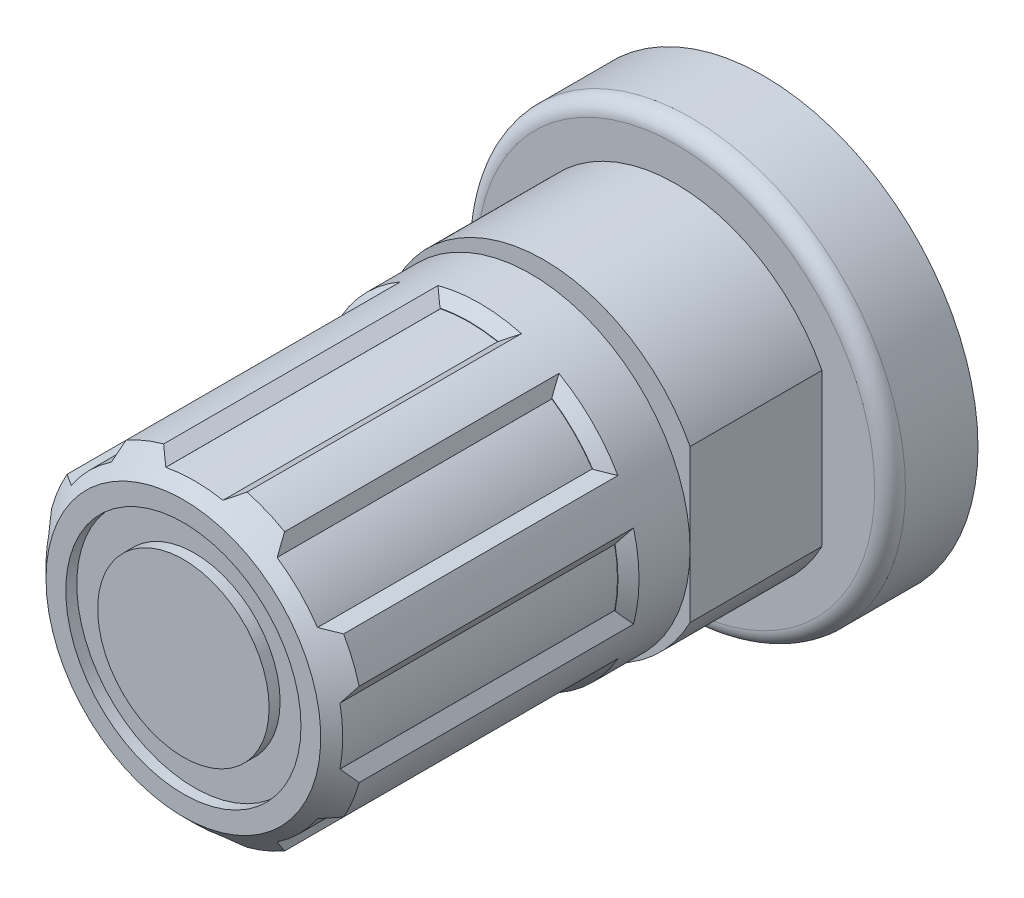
ISO-10303-21;
HEADER;
FILE_DESCRIPTION(('STEP AP214'),'2;1');
FILE_NAME('part.step','',(''),(''),'','','');
FILE_SCHEMA(('AUTOMOTIVE_DESIGN { 1 0 10303 214 1 1 1 1 }'));
ENDSEC;
DATA;
#1=APPLICATION_CONTEXT('core data for automotive mechanical design processes');
#2=APPLICATION_PROTOCOL_DEFINITION('international standard','automotive_design',2000,#1);
#3=PRODUCT_CONTEXT('',#1,'mechanical');
#4=PRODUCT('Part','Part','',(#3));
#5=PRODUCT_RELATED_PRODUCT_CATEGORY('part','',(#4));
#6=PRODUCT_DEFINITION_FORMATION('','',#4);
#7=PRODUCT_DEFINITION_CONTEXT('part definition',#1,'design');
#8=PRODUCT_DEFINITION('design','',#6,#7);
#9=PRODUCT_DEFINITION_SHAPE('','',#8);
#10=(LENGTH_UNIT() NAMED_UNIT(*) SI_UNIT(.MILLI.,.METRE.));
#11=(NAMED_UNIT(*) PLANE_ANGLE_UNIT() SI_UNIT($,.RADIAN.));
#12=(NAMED_UNIT(*) SI_UNIT($,.STERADIAN.) SOLID_ANGLE_UNIT());
#13=UNCERTAINTY_MEASURE_WITH_UNIT(LENGTH_MEASURE(1.E-05),#10,'distance_accuracy_value','');
#14=(GEOMETRIC_REPRESENTATION_CONTEXT(3) GLOBAL_UNCERTAINTY_ASSIGNED_CONTEXT((#13)) GLOBAL_UNIT_ASSIGNED_CONTEXT((#10,
#11,#12)) REPRESENTATION_CONTEXT('',''));
#15=CARTESIAN_POINT('',(0.,0.,0.));
#16=DIRECTION('',(0.,0.,1.));
#17=DIRECTION('',(1.,0.,0.));
#18=AXIS2_PLACEMENT_3D('',#15,#16,#17);
#19=CARTESIAN_POINT('',(0.,0.,33.528));
#20=DIRECTION('',(0.,0.,-1.));
#21=DIRECTION('',(-1.,0.,0.));
#22=AXIS2_PLACEMENT_3D('',#19,#20,#21);
#23=CYLINDRICAL_SURFACE('',#22,9.2075);
#24=CARTESIAN_POINT('',(0.,0.,13.462));
#25=DIRECTION('',(0.,0.,1.));
#26=DIRECTION('',(1.,0.,0.));
#27=AXIS2_PLACEMENT_3D('',#24,#25,#26);
#28=CIRCLE('',#27,9.2075);
#29=CARTESIAN_POINT('',(9.2075,0.,13.462));
#30=VERTEX_POINT('',#29);
#31=EDGE_CURVE('E948',#30,#30,#28,.T.);
#32=ORIENTED_EDGE('',*,*,#31,.T.);
#33=EDGE_LOOP('',(#32));
#34=FACE_BOUND('',#33,.T.);
#35=DIRECTION('',(0.,0.,-1.));
#36=VECTOR('',#35,1.);
#37=CARTESIAN_POINT('',(-8.8866578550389,2.40943321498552,33.528));
#38=LINE('',#37,#36);
#39=CARTESIAN_POINT('',(-8.8866578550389,2.40943321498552,16.4084));
#40=VERTEX_POINT('',#39);
#41=CARTESIAN_POINT('',(-8.8866578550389,2.40943321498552,32.258));
#42=VERTEX_POINT('',#41);
#43=EDGE_CURVE('E424',#40,#42,#38,.F.);
#44=ORIENTED_EDGE('',*,*,#43,.T.);
#45=CARTESIAN_POINT('',(0.,0.,32.258));
#46=DIRECTION('',(0.,0.,-1.));
#47=DIRECTION('',(-1.,0.,0.));
#48=AXIS2_PLACEMENT_3D('',#45,#46,#47);
#49=CIRCLE('',#48,9.2075);
#50=CARTESIAN_POINT('',(-7.98754259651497,4.58008946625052,32.258));
#51=VERTEX_POINT('',#50);
#52=EDGE_CURVE('E406',#42,#51,#49,.T.);
#53=ORIENTED_EDGE('',*,*,#52,.T.);
#54=DIRECTION('',(0.,0.,-1.));
#55=VECTOR('',#54,1.);
#56=CARTESIAN_POINT('',(-7.98754259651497,4.58008946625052,33.528));
#57=LINE('',#56,#55);
#58=CARTESIAN_POINT('',(-7.98754259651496,4.58008946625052,16.4084));
#59=VERTEX_POINT('',#58);
#60=EDGE_CURVE('E1695',#51,#59,#57,.T.);
#61=ORIENTED_EDGE('',*,*,#60,.T.);
#62=CARTESIAN_POINT('',(0.,0.,16.4084));
#63=DIRECTION('',(0.,0.,1.));
#64=DIRECTION('',(0.707106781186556,0.707106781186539,0.));
#65=AXIS2_PLACEMENT_3D('',#62,#63,#64);
#66=CIRCLE('',#65,9.2075);
#67=CARTESIAN_POINT('',(-4.58008946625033,7.98754259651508,16.4084));
#68=VERTEX_POINT('',#67);
#69=EDGE_CURVE('E1689',#59,#68,#66,.F.);
#70=ORIENTED_EDGE('',*,*,#69,.T.);
#71=DIRECTION('',(0.,0.,-1.));
#72=VECTOR('',#71,1.);
#73=CARTESIAN_POINT('',(-4.58008946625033,7.98754259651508,33.528));
#74=LINE('',#73,#72);
#75=CARTESIAN_POINT('',(-4.58008946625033,7.98754259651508,32.258));
#76=VERTEX_POINT('',#75);
#77=EDGE_CURVE('E1020',#68,#76,#74,.F.);
#78=ORIENTED_EDGE('',*,*,#77,.T.);
#79=CARTESIAN_POINT('',(-2.40943321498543,8.88665785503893,32.258));
#80=VERTEX_POINT('',#79);
#81=EDGE_CURVE('E46',#76,#80,#49,.T.);
#82=ORIENTED_EDGE('',*,*,#81,.T.);
#83=DIRECTION('',(0.,0.,-1.));
#84=VECTOR('',#83,1.);
#85=CARTESIAN_POINT('',(-2.40943321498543,8.88665785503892,33.528));
#86=LINE('',#85,#84);
#87=CARTESIAN_POINT('',(-2.40943321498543,8.88665785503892,16.4084));
#88=VERTEX_POINT('',#87);
#89=EDGE_CURVE('E1004',#80,#88,#86,.T.);
#90=ORIENTED_EDGE('',*,*,#89,.T.);
#91=CARTESIAN_POINT('',(0.,0.,16.4084));
#92=DIRECTION('',(0.,0.,1.));
#93=DIRECTION('',(1.,0.,0.));
#94=AXIS2_PLACEMENT_3D('',#91,#92,#93);
#95=CIRCLE('',#94,9.2075);
#96=CARTESIAN_POINT('',(2.40943321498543,8.88665785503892,16.4084));
#97=VERTEX_POINT('',#96);
#98=EDGE_CURVE('E1002',#88,#97,#95,.F.);
#99=ORIENTED_EDGE('',*,*,#98,.T.);
#100=DIRECTION('',(0.,0.,-1.));
#101=VECTOR('',#100,1.);
#102=CARTESIAN_POINT('',(2.40943321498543,8.88665785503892,33.528));
#103=LINE('',#102,#101);
#104=CARTESIAN_POINT('',(2.40943321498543,8.88665785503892,32.258));
#105=VERTEX_POINT('',#104);
#106=EDGE_CURVE('E1006',#97,#105,#103,.F.);
#107=ORIENTED_EDGE('',*,*,#106,.T.);
#108=CARTESIAN_POINT('',(4.58008946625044,7.98754259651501,32.258));
#109=VERTEX_POINT('',#108);
#110=EDGE_CURVE('E1021',#105,#109,#49,.T.);
#111=ORIENTED_EDGE('',*,*,#110,.T.);
#112=DIRECTION('',(0.,0.,-1.));
#113=VECTOR('',#112,1.);
#114=CARTESIAN_POINT('',(4.58008946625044,7.98754259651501,33.528));
#115=LINE('',#114,#113);
#116=CARTESIAN_POINT('',(4.58008946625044,7.98754259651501,16.4084));
#117=VERTEX_POINT('',#116);
#118=EDGE_CURVE('E761',#109,#117,#115,.T.);
#119=ORIENTED_EDGE('',*,*,#118,.T.);
#120=CARTESIAN_POINT('',(0.,0.,16.4084));
#121=DIRECTION('',(0.,0.,1.));
#122=DIRECTION('',(0.707106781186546,-0.707106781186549,0.));
#123=AXIS2_PLACEMENT_3D('',#120,#121,#122);
#124=CIRCLE('',#123,9.2075);
#125=CARTESIAN_POINT('',(7.98754259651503,4.58008946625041,16.4084));
#126=VERTEX_POINT('',#125);
#127=EDGE_CURVE('E755',#117,#126,#124,.F.);
#128=ORIENTED_EDGE('',*,*,#127,.T.);
#129=DIRECTION('',(0.,0.,-1.));
#130=VECTOR('',#129,1.);
#131=CARTESIAN_POINT('',(7.98754259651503,4.58008946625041,33.528));
#132=LINE('',#131,#130);
#133=CARTESIAN_POINT('',(7.98754259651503,4.58008946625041,32.258));
#134=VERTEX_POINT('',#133);
#135=EDGE_CURVE('E722',#126,#134,#132,.F.);
#136=ORIENTED_EDGE('',*,*,#135,.T.);
#137=CARTESIAN_POINT('',(8.88665785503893,2.4094332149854,32.258));
#138=VERTEX_POINT('',#137);
#139=EDGE_CURVE('E1023',#134,#138,#49,.T.);
#140=ORIENTED_EDGE('',*,*,#139,.T.);
#141=DIRECTION('',(0.,0.,-1.));
#142=VECTOR('',#141,1.);
#143=CARTESIAN_POINT('',(8.88665785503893,2.40943321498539,33.528));
#144=LINE('',#143,#142);
#145=CARTESIAN_POINT('',(8.88665785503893,2.40943321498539,16.4084));
#146=VERTEX_POINT('',#145);
#147=EDGE_CURVE('E703',#138,#146,#144,.T.);
#148=ORIENTED_EDGE('',*,*,#147,.T.);
#149=CARTESIAN_POINT('',(0.,0.,16.4084));
#150=DIRECTION('',(0.,0.,1.));
#151=DIRECTION('',(0.,-1.,0.));
#152=AXIS2_PLACEMENT_3D('',#149,#150,#151);
#153=CIRCLE('',#152,9.2075);
#154=CARTESIAN_POINT('',(8.88665785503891,-2.40943321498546,16.4084));
#155=VERTEX_POINT('',#154);
#156=EDGE_CURVE('E697',#146,#155,#153,.F.);
#157=ORIENTED_EDGE('',*,*,#156,.T.);
#158=DIRECTION('',(0.,0.,-1.));
#159=VECTOR('',#158,1.);
#160=CARTESIAN_POINT('',(8.88665785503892,-2.40943321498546,33.528));
#161=LINE('',#160,#159);
#162=CARTESIAN_POINT('',(8.88665785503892,-2.40943321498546,32.258));
#163=VERTEX_POINT('',#162);
#164=EDGE_CURVE('E664',#155,#163,#161,.F.);
#165=ORIENTED_EDGE('',*,*,#164,.T.);
#166=CARTESIAN_POINT('',(7.987542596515,-4.58008946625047,32.258));
#167=VERTEX_POINT('',#166);
#168=EDGE_CURVE('E1171',#163,#167,#49,.T.);
#169=ORIENTED_EDGE('',*,*,#168,.T.);
#170=DIRECTION('',(0.,0.,-1.));
#171=VECTOR('',#170,1.);
#172=CARTESIAN_POINT('',(7.987542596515,-4.58008946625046,33.528));
#173=LINE('',#172,#171);
#174=CARTESIAN_POINT('',(7.987542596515,-4.58008946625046,16.4084));
#175=VERTEX_POINT('',#174);
#176=EDGE_CURVE('E645',#167,#175,#173,.T.);
#177=ORIENTED_EDGE('',*,*,#176,.T.);
#178=CARTESIAN_POINT('',(0.,0.,16.4084));
#179=DIRECTION('',(0.,0.,1.));
#180=DIRECTION('',(-0.707106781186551,-0.707106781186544,0.));
#181=AXIS2_PLACEMENT_3D('',#178,#179,#180);
#182=CIRCLE('',#181,9.2075);
#183=CARTESIAN_POINT('',(4.58008946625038,-7.98754259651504,16.4084));
#184=VERTEX_POINT('',#183);
#185=EDGE_CURVE('E639',#175,#184,#182,.F.);
#186=ORIENTED_EDGE('',*,*,#185,.T.);
#187=DIRECTION('',(0.,0.,-1.));
#188=VECTOR('',#187,1.);
#189=CARTESIAN_POINT('',(4.58008946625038,-7.98754259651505,33.528));
#190=LINE('',#189,#188);
#191=CARTESIAN_POINT('',(4.58008946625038,-7.98754259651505,32.258));
#192=VERTEX_POINT('',#191);
#193=EDGE_CURVE('E606',#184,#192,#190,.F.);
#194=ORIENTED_EDGE('',*,*,#193,.T.);
#195=CARTESIAN_POINT('',(2.40943321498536,-8.88665785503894,32.258));
#196=VERTEX_POINT('',#195);
#197=EDGE_CURVE('E1186',#192,#196,#49,.T.);
#198=ORIENTED_EDGE('',*,*,#197,.T.);
#199=DIRECTION('',(0.,0.,-1.));
#200=VECTOR('',#199,1.);
#201=CARTESIAN_POINT('',(2.40943321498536,-8.88665785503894,33.528));
#202=LINE('',#201,#200);
#203=CARTESIAN_POINT('',(2.40943321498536,-8.88665785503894,16.4084));
#204=VERTEX_POINT('',#203);
#205=EDGE_CURVE('E587',#196,#204,#202,.T.);
#206=ORIENTED_EDGE('',*,*,#205,.T.);
#207=CARTESIAN_POINT('',(0.,0.,16.4084));
#208=DIRECTION('',(0.,0.,1.));
#209=DIRECTION('',(-1.,0.,0.));
#210=AXIS2_PLACEMENT_3D('',#207,#208,#209);
#211=CIRCLE('',#210,9.2075);
#212=CARTESIAN_POINT('',(-2.40943321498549,-8.88665785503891,16.4084));
#213=VERTEX_POINT('',#212);
#214=EDGE_CURVE('E581',#204,#213,#211,.F.);
#215=ORIENTED_EDGE('',*,*,#214,.T.);
#216=DIRECTION('',(0.,0.,-1.));
#217=VECTOR('',#216,1.);
#218=CARTESIAN_POINT('',(-2.40943321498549,-8.88665785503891,33.528));
#219=LINE('',#218,#217);
#220=CARTESIAN_POINT('',(-2.40943321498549,-8.88665785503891,32.258));
#221=VERTEX_POINT('',#220);
#222=EDGE_CURVE('E548',#213,#221,#219,.F.);
#223=ORIENTED_EDGE('',*,*,#222,.T.);
#224=CARTESIAN_POINT('',(-4.58008946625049,-7.98754259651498,32.258));
#225=VERTEX_POINT('',#224);
#226=EDGE_CURVE('E1201',#221,#225,#49,.T.);
#227=ORIENTED_EDGE('',*,*,#226,.T.);
#228=DIRECTION('',(0.,0.,-1.));
#229=VECTOR('',#228,1.);
#230=CARTESIAN_POINT('',(-4.58008946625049,-7.98754259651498,33.528));
#231=LINE('',#230,#229);
#232=CARTESIAN_POINT('',(-4.58008946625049,-7.98754259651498,16.4084));
#233=VERTEX_POINT('',#232);
#234=EDGE_CURVE('E529',#225,#233,#231,.T.);
#235=ORIENTED_EDGE('',*,*,#234,.T.);
#236=CARTESIAN_POINT('',(0.,0.,16.4084));
#237=DIRECTION('',(0.,0.,1.));
#238=DIRECTION('',(-0.707106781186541,0.707106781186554,0.));
#239=AXIS2_PLACEMENT_3D('',#236,#237,#238);
#240=CIRCLE('',#239,9.2075);
#241=CARTESIAN_POINT('',(-7.98754259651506,-4.58008946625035,16.4084));
#242=VERTEX_POINT('',#241);
#243=EDGE_CURVE('E523',#233,#242,#240,.F.);
#244=ORIENTED_EDGE('',*,*,#243,.T.);
#245=DIRECTION('',(0.,0.,-1.));
#246=VECTOR('',#245,1.);
#247=CARTESIAN_POINT('',(-7.98754259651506,-4.58008946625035,33.528));
#248=LINE('',#247,#246);
#249=CARTESIAN_POINT('',(-7.98754259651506,-4.58008946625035,32.258));
#250=VERTEX_POINT('',#249);
#251=EDGE_CURVE('E490',#242,#250,#248,.F.);
#252=ORIENTED_EDGE('',*,*,#251,.T.);
#253=CARTESIAN_POINT('',(-8.88665785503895,-2.40943321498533,32.258));
#254=VERTEX_POINT('',#253);
#255=EDGE_CURVE('E419',#250,#254,#49,.T.);
#256=ORIENTED_EDGE('',*,*,#255,.T.);
#257=DIRECTION('',(0.,0.,-1.));
#258=VECTOR('',#257,1.);
#259=CARTESIAN_POINT('',(-8.88665785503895,-2.40943321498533,33.528));
#260=LINE('',#259,#258);
#261=CARTESIAN_POINT('',(-8.88665785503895,-2.40943321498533,16.4084));
#262=VERTEX_POINT('',#261);
#263=EDGE_CURVE('E471',#254,#262,#260,.T.);
#264=ORIENTED_EDGE('',*,*,#263,.T.);
#265=CARTESIAN_POINT('',(0.,0.,16.4084));
#266=DIRECTION('',(0.,0.,1.));
#267=DIRECTION('',(0.,1.,0.));
#268=AXIS2_PLACEMENT_3D('',#265,#266,#267);
#269=CIRCLE('',#268,9.2075);
#270=EDGE_CURVE('E432',#262,#40,#269,.F.);
#271=ORIENTED_EDGE('',*,*,#270,.T.);
#272=EDGE_LOOP('',(#44,#53,#61,#70,#78,#82,#90,#99,#107,#111,#119,#128,#136,#140,#148,#157,#165,
#169,#177,#186,#194,#198,#206,#215,#223,#227,#235,#244,#252,#256,#264,#271));
#273=FACE_BOUND('',#272,.T.);
#274=ADVANCED_FACE('F27',(#34,#273),#23,.T.);
#275=CARTESIAN_POINT('',(0.,0.,12.7));
#276=DIRECTION('',(0.,0.,1.));
#277=DIRECTION('',(1.,0.,0.));
#278=AXIS2_PLACEMENT_3D('',#275,#276,#277);
#279=PLANE('',#278);
#280=CARTESIAN_POINT('',(0.,0.,12.7));
#281=DIRECTION('',(0.,0.,1.));
#282=DIRECTION('',(1.,0.,0.));
#283=AXIS2_PLACEMENT_3D('',#280,#281,#282);
#284=CIRCLE('',#283,9.525);
#285=CARTESIAN_POINT('',(8.4455,4.4044471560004,12.7));
#286=VERTEX_POINT('',#285);
#287=CARTESIAN_POINT('',(-8.4455,4.4044471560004,12.7));
#288=VERTEX_POINT('',#287);
#289=EDGE_CURVE('E978',#286,#288,#284,.T.);
#290=ORIENTED_EDGE('',*,*,#289,.T.);
#291=DIRECTION('',(0.,-1.,0.));
#292=VECTOR('',#291,1.);
#293=CARTESIAN_POINT('',(-8.4455,0.,12.7));
#294=LINE('',#293,#292);
#295=CARTESIAN_POINT('',(-8.4455,-4.4044471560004,12.7));
#296=VERTEX_POINT('',#295);
#297=EDGE_CURVE('E993',#288,#296,#294,.T.);
#298=ORIENTED_EDGE('',*,*,#297,.T.);
#299=CARTESIAN_POINT('',(8.4455,-4.4044471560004,12.7));
#300=VERTEX_POINT('',#299);
#301=EDGE_CURVE('E977',#296,#300,#284,.T.);
#302=ORIENTED_EDGE('',*,*,#301,.T.);
#303=DIRECTION('',(0.,1.,0.));
#304=VECTOR('',#303,1.);
#305=CARTESIAN_POINT('',(8.4455,0.,12.7));
#306=LINE('',#305,#304);
#307=EDGE_CURVE('E990',#300,#286,#306,.T.);
#308=ORIENTED_EDGE('',*,*,#307,.T.);
#309=EDGE_LOOP('',(#290,#298,#302,#308));
#310=FACE_BOUND('',#309,.T.);
#311=CARTESIAN_POINT('',(0.,0.,12.7));
#312=DIRECTION('',(0.,0.,1.));
#313=DIRECTION('',(1.,0.,0.));
#314=AXIS2_PLACEMENT_3D('',#311,#312,#313);
#315=CIRCLE('',#314,7.1755);
#316=CARTESIAN_POINT('',(-7.1755,0.,12.7));
#317=VERTEX_POINT('',#316);
#318=EDGE_CURVE('E955',#317,#317,#315,.T.);
#319=ORIENTED_EDGE('',*,*,#318,.F.);
#320=EDGE_LOOP('',(#319));
#321=FACE_BOUND('',#320,.T.);
#322=ADVANCED_FACE('F1256',(#310,#321),#279,.T.);
#323=CARTESIAN_POINT('',(0.,0.,12.7));
#324=DIRECTION('',(0.,0.,-1.));
#325=DIRECTION('',(-1.,0.,0.));
#326=AXIS2_PLACEMENT_3D('',#323,#324,#325);
#327=CYLINDRICAL_SURFACE('',#326,9.525);
#328=DIRECTION('',(0.,0.,-1.));
#329=VECTOR('',#328,1.);
#330=CARTESIAN_POINT('',(-8.4455,4.40444715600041,12.7));
#331=LINE('',#330,#329);
#332=CARTESIAN_POINT('',(-8.4455,4.40444715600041,5.08));
#333=VERTEX_POINT('',#332);
#334=EDGE_CURVE('E971',#288,#333,#331,.T.);
#335=ORIENTED_EDGE('',*,*,#334,.F.);
#336=ORIENTED_EDGE('',*,*,#289,.F.);
#337=DIRECTION('',(0.,0.,-1.));
#338=VECTOR('',#337,1.);
#339=CARTESIAN_POINT('',(8.4455,4.40444715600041,12.7));
#340=LINE('',#339,#338);
#341=CARTESIAN_POINT('',(8.4455,4.40444715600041,5.08));
#342=VERTEX_POINT('',#341);
#343=EDGE_CURVE('E965',#342,#286,#340,.F.);
#344=ORIENTED_EDGE('',*,*,#343,.F.);
#345=CARTESIAN_POINT('',(0.,0.,5.08));
#346=DIRECTION('',(0.,0.,1.));
#347=DIRECTION('',(1.,0.,0.));
#348=AXIS2_PLACEMENT_3D('',#345,#346,#347);
#349=CIRCLE('',#348,9.525);
#350=EDGE_CURVE('E974',#342,#333,#349,.T.);
#351=ORIENTED_EDGE('',*,*,#350,.T.);
#352=EDGE_LOOP('',(#335,#336,#344,#351));
#353=FACE_BOUND('',#352,.T.);
#354=ADVANCED_FACE('F1264',(#353),#327,.T.);
#355=DIRECTION('',(0.,0.,-1.));
#356=VECTOR('',#355,1.);
#357=CARTESIAN_POINT('',(-8.4455,-4.40444715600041,12.7));
#358=LINE('',#357,#356);
#359=CARTESIAN_POINT('',(-8.4455,-4.40444715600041,5.08));
#360=VERTEX_POINT('',#359);
#361=EDGE_CURVE('E969',#360,#296,#358,.F.);
#362=ORIENTED_EDGE('',*,*,#361,.F.);
#363=CARTESIAN_POINT('',(8.4455,-4.40444715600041,5.08));
#364=VERTEX_POINT('',#363);
#365=EDGE_CURVE('E973',#360,#364,#349,.T.);
#366=ORIENTED_EDGE('',*,*,#365,.T.);
#367=DIRECTION('',(0.,0.,-1.));
#368=VECTOR('',#367,1.);
#369=CARTESIAN_POINT('',(8.4455,-4.40444715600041,12.7));
#370=LINE('',#369,#368);
#371=EDGE_CURVE('E967',#300,#364,#370,.T.);
#372=ORIENTED_EDGE('',*,*,#371,.F.);
#373=ORIENTED_EDGE('',*,*,#301,.F.);
#374=EDGE_LOOP('',(#362,#366,#372,#373));
#375=FACE_BOUND('',#374,.T.);
#376=ADVANCED_FACE('F1285',(#375),#327,.T.);
#377=CARTESIAN_POINT('',(0.,0.,5.08));
#378=DIRECTION('',(0.,0.,1.));
#379=DIRECTION('',(1.,0.,0.));
#380=AXIS2_PLACEMENT_3D('',#377,#378,#379);
#381=PLANE('',#380);
#382=CARTESIAN_POINT('',(0.,0.,5.08));
#383=DIRECTION('',(0.,0.,1.));
#384=DIRECTION('',(1.,0.,0.));
#385=AXIS2_PLACEMENT_3D('',#382,#383,#384);
#386=CIRCLE('',#385,11.4935);
#387=CARTESIAN_POINT('',(11.4935,0.,5.08));
#388=VERTEX_POINT('',#387);
#389=EDGE_CURVE('E996',#388,#388,#386,.T.);
#390=ORIENTED_EDGE('',*,*,#389,.T.);
#391=EDGE_LOOP('',(#390));
#392=FACE_BOUND('',#391,.T.);
#393=DIRECTION('',(0.,-1.,0.));
#394=VECTOR('',#393,1.);
#395=CARTESIAN_POINT('',(-8.4455,21.7050988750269,5.08));
#396=LINE('',#395,#394);
#397=EDGE_CURVE('E961',#333,#360,#396,.T.);
#398=ORIENTED_EDGE('',*,*,#397,.F.);
#399=ORIENTED_EDGE('',*,*,#350,.F.);
#400=DIRECTION('',(0.,1.,0.));
#401=VECTOR('',#400,1.);
#402=CARTESIAN_POINT('',(8.4455,21.7050988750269,5.08));
#403=LINE('',#402,#401);
#404=EDGE_CURVE('E963',#364,#342,#403,.T.);
#405=ORIENTED_EDGE('',*,*,#404,.F.);
#406=ORIENTED_EDGE('',*,*,#365,.F.);
#407=EDGE_LOOP('',(#398,#399,#405,#406));
#408=FACE_BOUND('',#407,.T.);
#409=ADVANCED_FACE('F1296',(#392,#408),#381,.T.);
#410=CARTESIAN_POINT('',(0.,0.,0.));
#411=DIRECTION('',(0.,0.,1.));
#412=DIRECTION('',(1.,0.,0.));
#413=AXIS2_PLACEMENT_3D('',#410,#411,#412);
#414=PLANE('',#413);
#415=CARTESIAN_POINT('',(0.,0.,0.));
#416=DIRECTION('',(0.,0.,1.));
#417=DIRECTION('',(1.,0.,0.));
#418=AXIS2_PLACEMENT_3D('',#415,#416,#417);
#419=CIRCLE('',#418,12.3825);
#420=CARTESIAN_POINT('',(12.3825,0.,0.));
#421=VERTEX_POINT('',#420);
#422=EDGE_CURVE('E984',#421,#421,#419,.T.);
#423=ORIENTED_EDGE('',*,*,#422,.F.);
#424=EDGE_LOOP('',(#423));
#425=FACE_BOUND('',#424,.T.);
#426=CARTESIAN_POINT('',(0.,0.,0.));
#427=DIRECTION('',(0.,0.,1.));
#428=DIRECTION('',(1.,0.,0.));
#429=AXIS2_PLACEMENT_3D('',#426,#427,#428);
#430=CIRCLE('',#429,1.905);
#431=CARTESIAN_POINT('',(1.905,0.,0.));
#432=VERTEX_POINT('',#431);
#433=EDGE_CURVE('E987',#432,#432,#430,.F.);
#434=ORIENTED_EDGE('',*,*,#433,.F.);
#435=EDGE_LOOP('',(#434));
#436=FACE_BOUND('',#435,.T.);
#437=ADVANCED_FACE('F1294',(#425,#436),#414,.F.);
#438=CARTESIAN_POINT('',(0.,0.,5.08));
#439=DIRECTION('',(0.,0.,-1.));
#440=DIRECTION('',(-1.,0.,0.));
#441=AXIS2_PLACEMENT_3D('',#438,#439,#440);
#442=CYLINDRICAL_SURFACE('',#441,12.3825);
#443=CARTESIAN_POINT('',(0.,0.,4.191));
#444=DIRECTION('',(0.,0.,1.));
#445=DIRECTION('',(1.,0.,0.));
#446=AXIS2_PLACEMENT_3D('',#443,#444,#445);
#447=CIRCLE('',#446,12.3825);
#448=CARTESIAN_POINT('',(12.3825,0.,4.191));
#449=VERTEX_POINT('',#448);
#450=EDGE_CURVE('E999',#449,#449,#447,.F.);
#451=ORIENTED_EDGE('',*,*,#450,.T.);
#452=EDGE_LOOP('',(#451));
#453=FACE_BOUND('',#452,.T.);
#454=ORIENTED_EDGE('',*,*,#422,.T.);
#455=EDGE_LOOP('',(#454));
#456=FACE_BOUND('',#455,.T.);
#457=ADVANCED_FACE('F29',(#453,#456),#442,.T.);
#458=CARTESIAN_POINT('',(0.,0.,-3.81));
#459=DIRECTION('',(0.,0.,1.));
#460=DIRECTION('',(1.,0.,0.));
#461=AXIS2_PLACEMENT_3D('',#458,#459,#460);
#462=CYLINDRICAL_SURFACE('',#461,1.905);
#463=CARTESIAN_POINT('',(0.,0.,-3.81));
#464=DIRECTION('',(0.,0.,-1.));
#465=DIRECTION('',(-1.,0.,0.));
#466=AXIS2_PLACEMENT_3D('',#463,#464,#465);
#467=CIRCLE('',#466,1.905);
#468=CARTESIAN_POINT('',(1.905,0.,-3.81));
#469=VERTEX_POINT('',#468);
#470=EDGE_CURVE('E981',#469,#469,#467,.T.);
#471=CARTESIAN_POINT('',(1.905,0.,-3.81));
#472=CARTESIAN_POINT('',(1.905,0.,-3.7703125));
#473=CARTESIAN_POINT('',(1.905,0.,-3.730625));
#474=CARTESIAN_POINT('',(1.905,0.,-3.65125));
#475=CARTESIAN_POINT('',(1.905,0.,-3.6115625));
#476=CARTESIAN_POINT('',(1.905,0.,-3.5321875));
#477=CARTESIAN_POINT('',(1.905,0.,-3.4925));
#478=CARTESIAN_POINT('',(1.905,0.,-3.413125));
#479=CARTESIAN_POINT('',(1.905,0.,-3.3734375));
#480=CARTESIAN_POINT('',(1.905,0.,-3.2940625));
#481=CARTESIAN_POINT('',(1.905,0.,-3.254375));
#482=CARTESIAN_POINT('',(1.905,0.,-3.175));
#483=CARTESIAN_POINT('',(1.905,0.,-3.1353125));
#484=CARTESIAN_POINT('',(1.905,0.,-3.0559375));
#485=CARTESIAN_POINT('',(1.905,0.,-3.01625));
#486=CARTESIAN_POINT('',(1.905,0.,-2.936875));
#487=CARTESIAN_POINT('',(1.905,0.,-2.8971875));
#488=CARTESIAN_POINT('',(1.905,0.,-2.8178125));
#489=CARTESIAN_POINT('',(1.905,0.,-2.778125));
#490=CARTESIAN_POINT('',(1.905,0.,-2.69875));
#491=CARTESIAN_POINT('',(1.905,0.,-2.6590625));
#492=CARTESIAN_POINT('',(1.905,0.,-2.5796875));
#493=CARTESIAN_POINT('',(1.905,0.,-2.54));
#494=CARTESIAN_POINT('',(1.905,0.,-2.460625));
#495=CARTESIAN_POINT('',(1.905,0.,-2.4209375));
#496=CARTESIAN_POINT('',(1.905,0.,-2.3415625));
#497=CARTESIAN_POINT('',(1.905,0.,-2.301875));
#498=CARTESIAN_POINT('',(1.905,0.,-2.2225));
#499=CARTESIAN_POINT('',(1.905,0.,-2.1828125));
#500=CARTESIAN_POINT('',(1.905,0.,-2.1034375));
#501=CARTESIAN_POINT('',(1.905,0.,-2.06375));
#502=CARTESIAN_POINT('',(1.905,0.,-1.984375));
#503=CARTESIAN_POINT('',(1.905,0.,-1.9446875));
#504=CARTESIAN_POINT('',(1.905,0.,-1.8653125));
#505=CARTESIAN_POINT('',(1.905,0.,-1.825625));
#506=CARTESIAN_POINT('',(1.905,0.,-1.74625));
#507=CARTESIAN_POINT('',(1.905,0.,-1.7065625));
#508=CARTESIAN_POINT('',(1.905,0.,-1.6271875));
#509=CARTESIAN_POINT('',(1.905,0.,-1.5875));
#510=CARTESIAN_POINT('',(1.905,0.,-1.508125));
#511=CARTESIAN_POINT('',(1.905,0.,-1.4684375));
#512=CARTESIAN_POINT('',(1.905,0.,-1.3890625));
#513=CARTESIAN_POINT('',(1.905,0.,-1.349375));
#514=CARTESIAN_POINT('',(1.905,0.,-1.27));
#515=CARTESIAN_POINT('',(1.905,0.,-1.2303125));
#516=CARTESIAN_POINT('',(1.905,0.,-1.1509375));
#517=CARTESIAN_POINT('',(1.905,0.,-1.11125));
#518=CARTESIAN_POINT('',(1.905,0.,-1.031875));
#519=CARTESIAN_POINT('',(1.905,0.,-0.9921875));
#520=CARTESIAN_POINT('',(1.905,0.,-0.9128125));
#521=CARTESIAN_POINT('',(1.905,0.,-0.873125));
#522=CARTESIAN_POINT('',(1.905,0.,-0.79375));
#523=CARTESIAN_POINT('',(1.905,0.,-0.7540625));
#524=CARTESIAN_POINT('',(1.905,0.,-0.6746875));
#525=CARTESIAN_POINT('',(1.905,0.,-0.635));
#526=CARTESIAN_POINT('',(1.905,0.,-0.555625));
#527=CARTESIAN_POINT('',(1.905,0.,-0.5159375));
#528=CARTESIAN_POINT('',(1.905,0.,-0.4365625));
#529=CARTESIAN_POINT('',(1.905,0.,-0.396875));
#530=CARTESIAN_POINT('',(1.905,0.,-0.3175));
#531=CARTESIAN_POINT('',(1.905,0.,-0.2778125));
#532=CARTESIAN_POINT('',(1.905,0.,-0.1984375));
#533=CARTESIAN_POINT('',(1.905,0.,-0.15875));
#534=CARTESIAN_POINT('',(1.905,0.,-0.0793749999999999));
#535=CARTESIAN_POINT('',(1.905,0.,-0.0396874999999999));
#536=CARTESIAN_POINT('',(1.905,0.,0.));
#537=B_SPLINE_CURVE_WITH_KNOTS('',3,(#471,#472,#473,#474,#475,#476,#477,#478,#479,#480,#481,
#482,#483,#484,#485,#486,#487,#488,#489,#490,#491,#492,#493,#494,#495,#496,#497,#498,#499,#500,
#501,#502,#503,#504,#505,#506,#507,#508,#509,#510,#511,#512,#513,#514,#515,#516,#517,#518,#519,
#520,#521,#522,#523,#524,#525,#526,#527,#528,#529,#530,#531,#532,#533,#534,#535,#536),
.UNSPECIFIED.,.F.,.F.,(4,2,2,2,2,2,2,2,2,2,2,2,2,2,2,2,2,2,2,2,2,2,2,2,2,2,2,2,2,2,2,2,4),(0.,
0.1190625,0.238125,0.3571875,0.47625,0.5953125,0.714375,0.8334375,0.9525,1.0715625,1.190625,
1.3096875,1.42875,1.5478125,1.666875,1.7859375,1.905,2.0240625,2.143125,2.2621875,2.38125,
2.5003125,2.619375,2.7384375,2.8575,2.9765625,3.095625,3.2146875,3.33375,3.4528125,3.571875,
3.6909375,3.81),.UNSPECIFIED.);
#538=EDGE_CURVE('BSEAM1289',#469,#432,#537,.T.);
#539=ORIENTED_EDGE('',*,*,#470,.F.);
#540=ORIENTED_EDGE('',*,*,#433,.T.);
#541=ORIENTED_EDGE('',*,*,#538,.T.);
#542=ORIENTED_EDGE('',*,*,#538,.F.);
#543=EDGE_LOOP('',(#539,#541,#540,#542));
#544=FACE_BOUND('',#543,.T.);
#545=ADVANCED_FACE('F1289',(#544),#462,.T.);
#546=CARTESIAN_POINT('',(0.,0.,-3.81));
#547=DIRECTION('',(0.,0.,-1.));
#548=DIRECTION('',(-1.,0.,0.));
#549=AXIS2_PLACEMENT_3D('',#546,#547,#548);
#550=PLANE('',#549);
#551=ORIENTED_EDGE('',*,*,#470,.T.);
#552=EDGE_LOOP('',(#551));
#553=FACE_BOUND('',#552,.T.);
#554=ADVANCED_FACE('F1278',(#553),#550,.T.);
#555=CARTESIAN_POINT('',(8.4455,21.7050988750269,5.08));
#556=DIRECTION('',(1.,0.,0.));
#557=DIRECTION('',(0.,1.,0.));
#558=AXIS2_PLACEMENT_3D('',#555,#556,#557);
#559=PLANE('',#558);
#560=ORIENTED_EDGE('',*,*,#371,.T.);
#561=ORIENTED_EDGE('',*,*,#404,.T.);
#562=ORIENTED_EDGE('',*,*,#343,.T.);
#563=ORIENTED_EDGE('',*,*,#307,.F.);
#564=EDGE_LOOP('',(#560,#561,#562,#563));
#565=FACE_BOUND('',#564,.T.);
#566=ADVANCED_FACE('F1275',(#565),#559,.T.);
#567=CARTESIAN_POINT('',(-8.4455,21.7050988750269,5.08));
#568=DIRECTION('',(-1.,0.,0.));
#569=DIRECTION('',(0.,-1.,0.));
#570=AXIS2_PLACEMENT_3D('',#567,#568,#569);
#571=PLANE('',#570);
#572=ORIENTED_EDGE('',*,*,#334,.T.);
#573=ORIENTED_EDGE('',*,*,#397,.T.);
#574=ORIENTED_EDGE('',*,*,#361,.T.);
#575=ORIENTED_EDGE('',*,*,#297,.F.);
#576=EDGE_LOOP('',(#572,#573,#574,#575));
#577=FACE_BOUND('',#576,.T.);
#578=ADVANCED_FACE('F1273',(#577),#571,.T.);
#579=CARTESIAN_POINT('',(0.,0.,13.462));
#580=DIRECTION('',(0.,0.,-1.));
#581=DIRECTION('',(-1.,0.,0.));
#582=AXIS2_PLACEMENT_3D('',#579,#580,#581);
#583=CYLINDRICAL_SURFACE('',#582,7.1755);
#584=CARTESIAN_POINT('',(0.,0.,13.462));
#585=DIRECTION('',(0.,0.,1.));
#586=DIRECTION('',(1.,0.,0.));
#587=AXIS2_PLACEMENT_3D('',#584,#585,#586);
#588=CIRCLE('',#587,7.1755);
#589=CARTESIAN_POINT('',(-7.1755,0.,13.462));
#590=VERTEX_POINT('',#589);
#591=EDGE_CURVE('E958',#590,#590,#588,.T.);
#592=CARTESIAN_POINT('',(-7.1755,0.,13.462));
#593=CARTESIAN_POINT('',(-7.1755,0.,13.4540625));
#594=CARTESIAN_POINT('',(-7.1755,0.,13.446125));
#595=CARTESIAN_POINT('',(-7.1755,0.,13.43025));
#596=CARTESIAN_POINT('',(-7.1755,0.,13.4223125));
#597=CARTESIAN_POINT('',(-7.1755,0.,13.4064375));
#598=CARTESIAN_POINT('',(-7.1755,0.,13.3985));
#599=CARTESIAN_POINT('',(-7.1755,0.,13.382625));
#600=CARTESIAN_POINT('',(-7.1755,0.,13.3746875));
#601=CARTESIAN_POINT('',(-7.1755,0.,13.3588125));
#602=CARTESIAN_POINT('',(-7.1755,0.,13.350875));
#603=CARTESIAN_POINT('',(-7.1755,0.,13.335));
#604=CARTESIAN_POINT('',(-7.1755,0.,13.3270625));
#605=CARTESIAN_POINT('',(-7.1755,0.,13.3111875));
#606=CARTESIAN_POINT('',(-7.1755,0.,13.30325));
#607=CARTESIAN_POINT('',(-7.1755,0.,13.287375));
#608=CARTESIAN_POINT('',(-7.1755,0.,13.2794375));
#609=CARTESIAN_POINT('',(-7.1755,0.,13.2635625));
#610=CARTESIAN_POINT('',(-7.1755,0.,13.255625));
#611=CARTESIAN_POINT('',(-7.1755,0.,13.23975));
#612=CARTESIAN_POINT('',(-7.1755,0.,13.2318125));
#613=CARTESIAN_POINT('',(-7.1755,0.,13.2159375));
#614=CARTESIAN_POINT('',(-7.1755,0.,13.208));
#615=CARTESIAN_POINT('',(-7.1755,0.,13.192125));
#616=CARTESIAN_POINT('',(-7.1755,0.,13.1841875));
#617=CARTESIAN_POINT('',(-7.1755,0.,13.1683125));
#618=CARTESIAN_POINT('',(-7.1755,0.,13.160375));
#619=CARTESIAN_POINT('',(-7.1755,0.,13.1445));
#620=CARTESIAN_POINT('',(-7.1755,0.,13.1365625));
#621=CARTESIAN_POINT('',(-7.1755,0.,13.1206875));
#622=CARTESIAN_POINT('',(-7.1755,0.,13.11275));
#623=CARTESIAN_POINT('',(-7.1755,0.,13.096875));
#624=CARTESIAN_POINT('',(-7.1755,0.,13.0889375));
#625=CARTESIAN_POINT('',(-7.1755,0.,13.0730625));
#626=CARTESIAN_POINT('',(-7.1755,0.,13.065125));
#627=CARTESIAN_POINT('',(-7.1755,0.,13.04925));
#628=CARTESIAN_POINT('',(-7.1755,0.,13.0413125));
#629=CARTESIAN_POINT('',(-7.1755,0.,13.0254375));
#630=CARTESIAN_POINT('',(-7.1755,0.,13.0175));
#631=CARTESIAN_POINT('',(-7.1755,0.,13.001625));
#632=CARTESIAN_POINT('',(-7.1755,0.,12.9936875));
#633=CARTESIAN_POINT('',(-7.1755,0.,12.9778125));
#634=CARTESIAN_POINT('',(-7.1755,0.,12.969875));
#635=CARTESIAN_POINT('',(-7.1755,0.,12.954));
#636=CARTESIAN_POINT('',(-7.1755,0.,12.9460625));
#637=CARTESIAN_POINT('',(-7.1755,0.,12.9301875));
#638=CARTESIAN_POINT('',(-7.1755,0.,12.92225));
#639=CARTESIAN_POINT('',(-7.1755,0.,12.906375));
#640=CARTESIAN_POINT('',(-7.1755,0.,12.8984375));
#641=CARTESIAN_POINT('',(-7.1755,0.,12.8825625));
#642=CARTESIAN_POINT('',(-7.1755,0.,12.874625));
#643=CARTESIAN_POINT('',(-7.1755,0.,12.85875));
#644=CARTESIAN_POINT('',(-7.1755,0.,12.8508125));
#645=CARTESIAN_POINT('',(-7.1755,0.,12.8349375));
#646=CARTESIAN_POINT('',(-7.1755,0.,12.827));
#647=CARTESIAN_POINT('',(-7.1755,0.,12.811125));
#648=CARTESIAN_POINT('',(-7.1755,0.,12.8031875));
#649=CARTESIAN_POINT('',(-7.1755,0.,12.7873125));
#650=CARTESIAN_POINT('',(-7.1755,0.,12.779375));
#651=CARTESIAN_POINT('',(-7.1755,0.,12.7635));
#652=CARTESIAN_POINT('',(-7.1755,0.,12.7555625));
#653=CARTESIAN_POINT('',(-7.1755,0.,12.7396875));
#654=CARTESIAN_POINT('',(-7.1755,0.,12.73175));
#655=CARTESIAN_POINT('',(-7.1755,0.,12.715875));
#656=CARTESIAN_POINT('',(-7.1755,0.,12.7079375));
#657=CARTESIAN_POINT('',(-7.1755,0.,12.7));
#658=B_SPLINE_CURVE_WITH_KNOTS('',3,(#592,#593,#594,#595,#596,#597,#598,#599,#600,#601,#602,
#603,#604,#605,#606,#607,#608,#609,#610,#611,#612,#613,#614,#615,#616,#617,#618,#619,#620,#621,
#622,#623,#624,#625,#626,#627,#628,#629,#630,#631,#632,#633,#634,#635,#636,#637,#638,#639,#640,
#641,#642,#643,#644,#645,#646,#647,#648,#649,#650,#651,#652,#653,#654,#655,#656,#657),
.UNSPECIFIED.,.F.,.F.,(4,2,2,2,2,2,2,2,2,2,2,2,2,2,2,2,2,2,2,2,2,2,2,2,2,2,2,2,2,2,2,2,4),(0.,
0.0238124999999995,0.0476249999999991,0.0714374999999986,0.0952499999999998,0.119062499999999,
0.142874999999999,0.166687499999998,0.1905,0.214312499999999,0.238124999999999,0.2619375,
0.28575,0.309562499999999,0.333374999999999,0.3571875,0.380999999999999,0.404812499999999,
0.428625,0.4524375,0.476249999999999,0.500062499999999,0.523875,0.5476875,0.571499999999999,
0.5953125,0.619125,0.642937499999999,0.666749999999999,0.6905625,0.714375,0.738187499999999,
0.762000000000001),.UNSPECIFIED.);
#659=EDGE_CURVE('BSEAM1269',#590,#317,#658,.T.);
#660=ORIENTED_EDGE('',*,*,#591,.F.);
#661=ORIENTED_EDGE('',*,*,#318,.T.);
#662=ORIENTED_EDGE('',*,*,#659,.T.);
#663=ORIENTED_EDGE('',*,*,#659,.F.);
#664=EDGE_LOOP('',(#660,#662,#661,#663));
#665=FACE_BOUND('',#664,.T.);
#666=ADVANCED_FACE('F1269',(#665),#583,.T.);
#667=CARTESIAN_POINT('',(0.,0.,13.462));
#668=DIRECTION('',(0.,0.,1.));
#669=DIRECTION('',(1.,0.,0.));
#670=AXIS2_PLACEMENT_3D('',#667,#668,#669);
#671=PLANE('',#670);
#672=ORIENTED_EDGE('',*,*,#31,.F.);
#673=EDGE_LOOP('',(#672));
#674=FACE_BOUND('',#673,.T.);
#675=ORIENTED_EDGE('',*,*,#591,.T.);
#676=EDGE_LOOP('',(#675));
#677=FACE_BOUND('',#676,.T.);
#678=ADVANCED_FACE('F1272',(#674,#677),#671,.F.);
#679=CARTESIAN_POINT('',(0.,0.,4.191));
#680=DIRECTION('',(0.,0.,1.));
#681=DIRECTION('',(1.,0.,0.));
#682=AXIS2_PLACEMENT_3D('',#679,#680,#681);
#683=TOROIDAL_SURFACE('',#682,11.4935,0.889);
#684=ORIENTED_EDGE('',*,*,#450,.F.);
#685=EDGE_LOOP('',(#684));
#686=FACE_BOUND('',#685,.T.);
#687=ORIENTED_EDGE('',*,*,#389,.F.);
#688=EDGE_LOOP('',(#687));
#689=FACE_BOUND('',#688,.T.);
#690=ADVANCED_FACE('F1324',(#686,#689),#683,.T.);
#691=CARTESIAN_POINT('',(1.651,8.41201255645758,17.018));
#692=DIRECTION('',(0.981278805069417,-0.192592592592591,0.));
#693=DIRECTION('',(0.192592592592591,0.981278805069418,0.));
#694=AXIS2_PLACEMENT_3D('',#691,#692,#693);
#695=PLANE('',#694);
#696=DIRECTION('',(0.,0.,1.));
#697=VECTOR('',#696,1.);
#698=CARTESIAN_POINT('',(1.651,8.41201255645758,17.018));
#699=LINE('',#698,#697);
#700=CARTESIAN_POINT('',(1.651,8.41201255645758,17.018));
#701=VERTEX_POINT('',#700);
#702=CARTESIAN_POINT('',(1.651,8.41201255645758,32.893));
#703=VERTEX_POINT('',#702);
#704=EDGE_CURVE('E945',#701,#703,#699,.T.);
#705=ORIENTED_EDGE('',*,*,#704,.T.);
#706=DIRECTION('',(-0.136183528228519,-0.693868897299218,0.707106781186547));
#707=VECTOR('',#706,1.);
#708=CARTESIAN_POINT('',(0.,0.,41.4655));
#709=LINE('',#708,#707);
#710=CARTESIAN_POINT('',(1.65172455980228,8.41570426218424,32.8892378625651));
#711=VERTEX_POINT('',#710);
#712=EDGE_CURVE('E924',#703,#711,#709,.F.);
#713=ORIENTED_EDGE('',*,*,#712,.T.);
#714=DIRECTION('',(0.,0.,-1.));
#715=VECTOR('',#714,1.);
#716=CARTESIAN_POINT('',(1.65172455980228,8.41570426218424,17.018));
#717=LINE('',#716,#715);
#718=CARTESIAN_POINT('',(1.65172455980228,8.41570426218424,17.018));
#719=VERTEX_POINT('',#718);
#720=EDGE_CURVE('E1009',#711,#719,#717,.T.);
#721=ORIENTED_EDGE('',*,*,#720,.T.);
#722=DIRECTION('',(0.192592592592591,0.981278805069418,0.));
#723=VECTOR('',#722,1.);
#724=CARTESIAN_POINT('',(1.651,8.41201255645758,17.018));
#725=LINE('',#724,#723);
#726=EDGE_CURVE('E946',#701,#719,#725,.T.);
#727=ORIENTED_EDGE('',*,*,#726,.F.);
#728=EDGE_LOOP('',(#705,#713,#721,#727));
#729=FACE_BOUND('',#728,.T.);
#730=ADVANCED_FACE('F1326',(#729),#695,.F.);
#731=CARTESIAN_POINT('',(0.,0.,17.018));
#732=DIRECTION('',(0.,0.,1.));
#733=DIRECTION('',(1.,0.,0.));
#734=AXIS2_PLACEMENT_3D('',#731,#732,#733);
#735=CYLINDRICAL_SURFACE('',#734,8.5725);
#736=DIRECTION('',(0.,0.,1.));
#737=VECTOR('',#736,1.);
#738=CARTESIAN_POINT('',(-1.651,8.41201255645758,17.018));
#739=LINE('',#738,#737);
#740=CARTESIAN_POINT('',(-1.651,8.41201255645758,17.018));
#741=VERTEX_POINT('',#740);
#742=CARTESIAN_POINT('',(-1.651,8.41201255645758,32.893));
#743=VERTEX_POINT('',#742);
#744=EDGE_CURVE('E937',#741,#743,#739,.T.);
#745=ORIENTED_EDGE('',*,*,#744,.T.);
#746=CARTESIAN_POINT('',(0.,0.,32.893));
#747=DIRECTION('',(0.,0.,-1.));
#748=DIRECTION('',(-1.,0.,0.));
#749=AXIS2_PLACEMENT_3D('',#746,#747,#748);
#750=CIRCLE('',#749,8.5725);
#751=EDGE_CURVE('E926',#743,#703,#750,.T.);
#752=ORIENTED_EDGE('',*,*,#751,.T.);
#753=ORIENTED_EDGE('',*,*,#704,.F.);
#754=CARTESIAN_POINT('',(0.,0.,17.018));
#755=DIRECTION('',(0.,0.,-1.));
#756=DIRECTION('',(1.,0.,0.));
#757=AXIS2_PLACEMENT_3D('',#754,#755,#756);
#758=CIRCLE('',#757,8.5725);
#759=EDGE_CURVE('E944',#741,#701,#758,.T.);
#760=ORIENTED_EDGE('',*,*,#759,.F.);
#761=EDGE_LOOP('',(#745,#752,#753,#760));
#762=FACE_BOUND('',#761,.T.);
#763=ADVANCED_FACE('F942',(#762),#735,.T.);
#764=CARTESIAN_POINT('',(-1.7732962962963,9.03512459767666,17.018));
#765=DIRECTION('',(-0.981278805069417,-0.192592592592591,0.));
#766=DIRECTION('',(0.192592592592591,-0.981278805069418,0.));
#767=AXIS2_PLACEMENT_3D('',#764,#765,#766);
#768=PLANE('',#767);
#769=DIRECTION('',(0.,0.,1.));
#770=VECTOR('',#769,1.);
#771=CARTESIAN_POINT('',(-1.65172455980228,8.41570426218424,17.018));
#772=LINE('',#771,#770);
#773=CARTESIAN_POINT('',(-1.65172455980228,8.41570426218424,17.018));
#774=VERTEX_POINT('',#773);
#775=CARTESIAN_POINT('',(-1.65172455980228,8.41570426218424,32.8892378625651));
#776=VERTEX_POINT('',#775);
#777=EDGE_CURVE('E940',#774,#776,#772,.T.);
#778=ORIENTED_EDGE('',*,*,#777,.T.);
#779=DIRECTION('',(-0.136183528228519,0.693868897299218,-0.707106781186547));
#780=VECTOR('',#779,1.);
#781=CARTESIAN_POINT('',(0.,0.,41.4655));
#782=LINE('',#781,#780);
#783=EDGE_CURVE('E814',#776,#743,#782,.F.);
#784=ORIENTED_EDGE('',*,*,#783,.T.);
#785=ORIENTED_EDGE('',*,*,#744,.F.);
#786=DIRECTION('',(0.192592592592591,-0.981278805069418,0.));
#787=VECTOR('',#786,1.);
#788=CARTESIAN_POINT('',(-1.7732962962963,9.03512459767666,17.018));
#789=LINE('',#788,#787);
#790=EDGE_CURVE('E1014',#774,#741,#789,.T.);
#791=ORIENTED_EDGE('',*,*,#790,.F.);
#792=EDGE_LOOP('',(#778,#784,#785,#791));
#793=FACE_BOUND('',#792,.T.);
#794=ADVANCED_FACE('F935',(#793),#768,.F.);
#795=CARTESIAN_POINT('',(0.,0.,17.018));
#796=DIRECTION('',(0.,0.,1.));
#797=DIRECTION('',(1.,0.,0.));
#798=AXIS2_PLACEMENT_3D('',#795,#796,#797);
#799=PLANE('',#798);
#800=DIRECTION('',(0.849312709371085,0.527890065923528,0.));
#801=VECTOR('',#800,1.);
#802=CARTESIAN_POINT('',(2.40943321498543,8.88665785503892,17.018));
#803=LINE('',#802,#801);
#804=CARTESIAN_POINT('',(1.67864842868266,8.43243878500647,17.018));
#805=VERTEX_POINT('',#804);
#806=EDGE_CURVE('E1013',#719,#805,#803,.T.);
#807=ORIENTED_EDGE('',*,*,#806,.T.);
#808=CARTESIAN_POINT('',(0.,0.,17.018));
#809=DIRECTION('',(0.,0.,1.));
#810=DIRECTION('',(1.,0.,0.));
#811=AXIS2_PLACEMENT_3D('',#808,#809,#810);
#812=CIRCLE('',#811,8.59790000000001);
#813=CARTESIAN_POINT('',(-1.67864842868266,8.43243878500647,17.018));
#814=VERTEX_POINT('',#813);
#815=EDGE_CURVE('E54',#805,#814,#812,.T.);
#816=ORIENTED_EDGE('',*,*,#815,.T.);
#817=DIRECTION('',(0.849312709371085,-0.527890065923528,0.));
#818=VECTOR('',#817,1.);
#819=CARTESIAN_POINT('',(-1.65172455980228,8.41570426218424,17.018));
#820=LINE('',#819,#818);
#821=EDGE_CURVE('E40',#814,#774,#820,.T.);
#822=ORIENTED_EDGE('',*,*,#821,.T.);
#823=ORIENTED_EDGE('',*,*,#790,.T.);
#824=ORIENTED_EDGE('',*,*,#759,.T.);
#825=ORIENTED_EDGE('',*,*,#726,.T.);
#826=EDGE_LOOP('',(#807,#816,#822,#823,#824,#825));
#827=FACE_BOUND('',#826,.T.);
#828=ADVANCED_FACE('F802',(#827),#799,.T.);
#829=CARTESIAN_POINT('',(-1.65172455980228,8.41570426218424,33.528));
#830=DIRECTION('',(0.527890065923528,0.849312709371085,0.));
#831=DIRECTION('',(-0.849312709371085,0.527890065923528,0.));
#832=AXIS2_PLACEMENT_3D('',#829,#830,#831);
#833=PLANE('',#832);
#834=CARTESIAN_POINT('',(-1.65152455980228,8.41557995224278,32.8893983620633));
#835=CARTESIAN_POINT('',(-1.71547943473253,8.45533108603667,32.8380742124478));
#836=CARTESIAN_POINT('',(-1.77922486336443,8.49495203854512,32.7863892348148));
#837=CARTESIAN_POINT('',(-1.9063155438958,8.57394521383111,32.6823525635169));
#838=CARTESIAN_POINT('',(-1.96966082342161,8.6133174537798,32.6300009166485));
#839=CARTESIAN_POINT('',(-2.09597837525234,8.69183009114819,32.5246790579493));
#840=CARTESIAN_POINT('',(-2.15895065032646,8.7309704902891,32.4717088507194));
#841=CARTESIAN_POINT('',(-2.28454811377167,8.80903555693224,32.3651900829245));
#842=CARTESIAN_POINT('',(-2.34717327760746,8.84796020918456,32.3116414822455));
#843=CARTESIAN_POINT('',(-2.40963321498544,8.8867821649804,32.2578276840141));
#844=B_SPLINE_CURVE_WITH_KNOTS('',3,(#834,#835,#836,#837,#838,#839,#840,#841,#842,#843),
.UNSPECIFIED.,.F.,.F.,(4,2,2,2,4),(0.,0.273386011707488,0.546752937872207,0.820117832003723,
1.09350180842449),.UNSPECIFIED.);
#845=EDGE_CURVE('E807',#776,#80,#844,.T.);
#846=ORIENTED_EDGE('',*,*,#845,.F.);
#847=ORIENTED_EDGE('',*,*,#777,.F.);
#848=ORIENTED_EDGE('',*,*,#821,.F.);
#849=CARTESIAN_POINT('',(-2.40943321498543,8.88665785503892,16.4084));
#850=CARTESIAN_POINT('',(-2.34919835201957,8.84921889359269,16.4602959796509));
#851=CARTESIAN_POINT('',(-2.2888097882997,8.81168439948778,16.5119452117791));
#852=CARTESIAN_POINT('',(-2.16771030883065,8.73641505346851,16.6147072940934));
#853=CARTESIAN_POINT('',(-2.10699941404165,8.69868021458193,16.6658201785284));
#854=CARTESIAN_POINT('',(-1.98523218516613,8.62299582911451,16.7674736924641));
#855=CARTESIAN_POINT('',(-1.92417584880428,8.58504628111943,16.8180143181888));
#856=CARTESIAN_POINT('',(-1.80169356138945,8.50891745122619,16.9184806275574));
#857=CARTESIAN_POINT('',(-1.74026758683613,8.47073815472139,16.9684062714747));
#858=CARTESIAN_POINT('',(-1.67864842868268,8.43243878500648,17.018));
#859=B_SPLINE_CURVE_WITH_KNOTS('',3,(#849,#850,#851,#852,#853,#854,#855,#856,#857,#858),
.UNSPECIFIED.,.F.,.F.,(4,2,2,2,4),(0.,0.263643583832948,0.527270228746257,0.79089861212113,
1.05454393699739),.UNSPECIFIED.);
#860=EDGE_CURVE('E784',#88,#814,#859,.T.);
#861=ORIENTED_EDGE('',*,*,#860,.F.);
#862=ORIENTED_EDGE('',*,*,#89,.F.);
#863=EDGE_LOOP('',(#846,#847,#848,#861,#862));
#864=FACE_BOUND('',#863,.T.);
#865=ADVANCED_FACE('F796',(#864),#833,.T.);
#866=CARTESIAN_POINT('',(0.,0.,17.018));
#867=DIRECTION('',(0.,0.,-1.));
#868=DIRECTION('',(-1.,0.,0.));
#869=AXIS2_PLACEMENT_3D('',#866,#867,#868);
#870=CONICAL_SURFACE('',#869,8.59790000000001,0.785398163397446);
#871=ORIENTED_EDGE('',*,*,#815,.F.);
#872=CARTESIAN_POINT('',(1.67864842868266,8.43243878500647,17.018));
#873=CARTESIAN_POINT('',(1.74026758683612,8.47073815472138,16.9684062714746));
#874=CARTESIAN_POINT('',(1.80169356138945,8.50891745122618,16.9184806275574));
#875=CARTESIAN_POINT('',(1.92417584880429,8.58504628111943,16.8180143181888));
#876=CARTESIAN_POINT('',(1.98523218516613,8.62299582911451,16.7674736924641));
#877=CARTESIAN_POINT('',(2.10699941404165,8.69868021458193,16.6658201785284));
#878=CARTESIAN_POINT('',(2.16771030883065,8.73641505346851,16.6147072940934));
#879=CARTESIAN_POINT('',(2.2888097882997,8.81168439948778,16.5119452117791));
#880=CARTESIAN_POINT('',(2.34919835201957,8.84921889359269,16.4602959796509));
#881=CARTESIAN_POINT('',(2.40943321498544,8.88665785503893,16.4084));
#882=B_SPLINE_CURVE_WITH_KNOTS('',3,(#872,#873,#874,#875,#876,#877,#878,#879,#880,#881),
.UNSPECIFIED.,.F.,.F.,(4,2,2,2,4),(0.,0.263645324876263,0.527273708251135,0.790900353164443,
1.05454393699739),.UNSPECIFIED.);
#883=EDGE_CURVE('E776',#97,#805,#882,.F.);
#884=ORIENTED_EDGE('',*,*,#883,.F.);
#885=ORIENTED_EDGE('',*,*,#98,.F.);
#886=ORIENTED_EDGE('',*,*,#860,.T.);
#887=EDGE_LOOP('',(#871,#884,#885,#886));
#888=FACE_BOUND('',#887,.T.);
#889=ADVANCED_FACE('F793',(#888),#870,.T.);
#890=CARTESIAN_POINT('',(2.40943321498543,8.88665785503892,33.528));
#891=DIRECTION('',(-0.527890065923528,0.849312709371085,0.));
#892=DIRECTION('',(-0.849312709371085,-0.527890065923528,0.));
#893=AXIS2_PLACEMENT_3D('',#890,#891,#892);
#894=PLANE('',#893);
#895=CARTESIAN_POINT('',(2.40963321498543,8.88678216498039,32.257827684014));
#896=CARTESIAN_POINT('',(2.34717327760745,8.84796020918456,32.3116414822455));
#897=CARTESIAN_POINT('',(2.28454811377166,8.80903555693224,32.3651900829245));
#898=CARTESIAN_POINT('',(2.15895065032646,8.7309704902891,32.4717088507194));
#899=CARTESIAN_POINT('',(2.09597837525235,8.69183009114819,32.5246790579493));
#900=CARTESIAN_POINT('',(1.96966082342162,8.6133174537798,32.6300009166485));
#901=CARTESIAN_POINT('',(1.9063155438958,8.57394521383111,32.6823525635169));
#902=CARTESIAN_POINT('',(1.77922486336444,8.49495203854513,32.7863892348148));
#903=CARTESIAN_POINT('',(1.71547943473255,8.45533108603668,32.8380742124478));
#904=CARTESIAN_POINT('',(1.65152455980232,8.4155799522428,32.8893983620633));
#905=B_SPLINE_CURVE_WITH_KNOTS('',3,(#895,#896,#897,#898,#899,#900,#901,#902,#903,#904),
.UNSPECIFIED.,.F.,.F.,(4,2,2,2,4),(0.,0.273383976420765,0.546748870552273,0.820115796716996,
1.09350180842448),.UNSPECIFIED.);
#906=EDGE_CURVE('E919',#105,#711,#905,.T.);
#907=ORIENTED_EDGE('',*,*,#906,.F.);
#908=ORIENTED_EDGE('',*,*,#106,.F.);
#909=ORIENTED_EDGE('',*,*,#883,.T.);
#910=ORIENTED_EDGE('',*,*,#806,.F.);
#911=ORIENTED_EDGE('',*,*,#720,.F.);
#912=EDGE_LOOP('',(#907,#908,#909,#910,#911));
#913=FACE_BOUND('',#912,.T.);
#914=ADVANCED_FACE('F790',(#913),#894,.T.);
#915=CARTESIAN_POINT('',(7.11562441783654,4.78075782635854,17.018));
#916=DIRECTION('',(0.557685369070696,-0.830052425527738,0.));
#917=DIRECTION('',(0.830052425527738,0.557685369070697,0.));
#918=AXIS2_PLACEMENT_3D('',#915,#916,#917);
#919=PLANE('',#918);
#920=DIRECTION('',(0.,0.,1.));
#921=VECTOR('',#920,1.);
#922=CARTESIAN_POINT('',(7.11562441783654,4.78075782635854,17.018));
#923=LINE('',#922,#921);
#924=CARTESIAN_POINT('',(7.11562441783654,4.78075782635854,17.018));
#925=VERTEX_POINT('',#924);
#926=CARTESIAN_POINT('',(7.11562441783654,4.78075782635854,32.893));
#927=VERTEX_POINT('',#926);
#928=EDGE_CURVE('E773',#925,#927,#923,.T.);
#929=ORIENTED_EDGE('',*,*,#928,.T.);
#930=DIRECTION('',(-0.586935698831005,-0.394343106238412,0.707106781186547));
#931=VECTOR('',#930,1.);
#932=CARTESIAN_POINT('',(0.,0.,41.4655));
#933=LINE('',#932,#931);
#934=CARTESIAN_POINT('',(7.11874718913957,4.78285591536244,32.8892378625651));
#935=VERTEX_POINT('',#934);
#936=EDGE_CURVE('E1139',#927,#935,#933,.F.);
#937=ORIENTED_EDGE('',*,*,#936,.T.);
#938=DIRECTION('',(0.,0.,-1.));
#939=VECTOR('',#938,1.);
#940=CARTESIAN_POINT('',(7.11874718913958,4.78285591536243,17.018));
#941=LINE('',#940,#939);
#942=CARTESIAN_POINT('',(7.11874718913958,4.78285591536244,17.018));
#943=VERTEX_POINT('',#942);
#944=EDGE_CURVE('E720',#935,#943,#941,.T.);
#945=ORIENTED_EDGE('',*,*,#944,.T.);
#946=DIRECTION('',(0.830052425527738,0.557685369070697,0.));
#947=VECTOR('',#946,1.);
#948=CARTESIAN_POINT('',(7.11562441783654,4.78075782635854,17.018));
#949=LINE('',#948,#947);
#950=EDGE_CURVE('E767',#925,#943,#949,.T.);
#951=ORIENTED_EDGE('',*,*,#950,.F.);
#952=EDGE_LOOP('',(#929,#937,#945,#951));
#953=FACE_BOUND('',#952,.T.);
#954=ADVANCED_FACE('F1359',(#953),#919,.F.);
#955=CARTESIAN_POINT('',(0.,0.,17.018));
#956=DIRECTION('',(0.,0.,1.));
#957=DIRECTION('',(0.707106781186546,-0.707106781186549,0.));
#958=AXIS2_PLACEMENT_3D('',#955,#956,#957);
#959=CYLINDRICAL_SURFACE('',#958,8.5725);
#960=DIRECTION('',(0.,0.,1.));
#961=VECTOR('',#960,1.);
#962=CARTESIAN_POINT('',(4.78075782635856,7.11562441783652,17.018));
#963=LINE('',#962,#961);
#964=CARTESIAN_POINT('',(4.78075782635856,7.11562441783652,17.018));
#965=VERTEX_POINT('',#964);
#966=CARTESIAN_POINT('',(4.78075782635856,7.11562441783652,32.893));
#967=VERTEX_POINT('',#966);
#968=EDGE_CURVE('E770',#965,#967,#963,.T.);
#969=ORIENTED_EDGE('',*,*,#968,.T.);
#970=CARTESIAN_POINT('',(0.,0.,32.893));
#971=DIRECTION('',(0.,0.,-1.));
#972=DIRECTION('',(-1.,0.,0.));
#973=AXIS2_PLACEMENT_3D('',#970,#971,#972);
#974=CIRCLE('',#973,8.5725);
#975=EDGE_CURVE('E1142',#967,#927,#974,.T.);
#976=ORIENTED_EDGE('',*,*,#975,.T.);
#977=ORIENTED_EDGE('',*,*,#928,.F.);
#978=CARTESIAN_POINT('',(0.,0.,17.018));
#979=DIRECTION('',(0.,0.,-1.));
#980=DIRECTION('',(0.707106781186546,-0.707106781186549,0.));
#981=AXIS2_PLACEMENT_3D('',#978,#979,#980);
#982=CIRCLE('',#981,8.5725);
#983=EDGE_CURVE('E765',#965,#925,#982,.T.);
#984=ORIENTED_EDGE('',*,*,#983,.F.);
#985=EDGE_LOOP('',(#969,#976,#977,#984));
#986=FACE_BOUND('',#985,.T.);
#987=ADVANCED_FACE('F1367',(#986),#959,.T.);
#988=CARTESIAN_POINT('',(5.13488803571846,7.64270770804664,17.018));
#989=DIRECTION('',(-0.830052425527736,0.5576853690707,0.));
#990=DIRECTION('',(-0.5576853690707,-0.830052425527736,0.));
#991=AXIS2_PLACEMENT_3D('',#988,#989,#990);
#992=PLANE('',#991);
#993=DIRECTION('',(0.,0.,1.));
#994=VECTOR('',#993,1.);
#995=CARTESIAN_POINT('',(4.78285591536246,7.11874718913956,17.018));
#996=LINE('',#995,#994);
#997=CARTESIAN_POINT('',(4.78285591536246,7.11874718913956,17.018));
#998=VERTEX_POINT('',#997);
#999=CARTESIAN_POINT('',(4.78285591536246,7.11874718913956,32.8892378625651));
#1000=VERTEX_POINT('',#999);
#1001=EDGE_CURVE('E754',#998,#1000,#996,.T.);
#1002=ORIENTED_EDGE('',*,*,#1001,.T.);
#1003=DIRECTION('',(0.394343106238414,0.586935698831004,-0.707106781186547));
#1004=VECTOR('',#1003,1.);
#1005=CARTESIAN_POINT('',(0.,0.,41.4655));
#1006=LINE('',#1005,#1004);
#1007=EDGE_CURVE('E1146',#1000,#967,#1006,.F.);
#1008=ORIENTED_EDGE('',*,*,#1007,.T.);
#1009=ORIENTED_EDGE('',*,*,#968,.F.);
#1010=DIRECTION('',(-0.5576853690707,-0.830052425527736,0.));
#1011=VECTOR('',#1010,1.);
#1012=CARTESIAN_POINT('',(5.13488803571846,7.64270770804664,17.018));
#1013=LINE('',#1012,#1011);
#1014=EDGE_CURVE('E763',#998,#965,#1013,.T.);
#1015=ORIENTED_EDGE('',*,*,#1014,.F.);
#1016=EDGE_LOOP('',(#1002,#1008,#1009,#1015));
#1017=FACE_BOUND('',#1016,.T.);
#1018=ADVANCED_FACE('F1373',(#1017),#992,.F.);
#1019=CARTESIAN_POINT('',(0.,0.,17.018));
#1020=DIRECTION('',(0.,0.,1.));
#1021=DIRECTION('',(0.707106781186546,-0.707106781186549,0.));
#1022=AXIS2_PLACEMENT_3D('',#1019,#1020,#1021);
#1023=PLANE('',#1022);
#1024=DIRECTION('',(0.973829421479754,-0.227280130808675,0.));
#1025=VECTOR('',#1024,1.);
#1026=CARTESIAN_POINT('',(7.98754259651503,4.58008946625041,17.018));
#1027=LINE('',#1026,#1025);
#1028=CARTESIAN_POINT('',(7.14961833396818,4.77565095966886,17.018));
#1029=VERTEX_POINT('',#1028);
#1030=EDGE_CURVE('E718',#943,#1029,#1027,.T.);
#1031=ORIENTED_EDGE('',*,*,#1030,.T.);
#1032=CARTESIAN_POINT('',(0.,0.,17.018));
#1033=DIRECTION('',(0.,0.,1.));
#1034=DIRECTION('',(0.707106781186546,-0.707106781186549,0.));
#1035=AXIS2_PLACEMENT_3D('',#1032,#1033,#1034);
#1036=CIRCLE('',#1035,8.59790000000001);
#1037=CARTESIAN_POINT('',(4.77565095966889,7.14961833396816,17.018));
#1038=VERTEX_POINT('',#1037);
#1039=EDGE_CURVE('E733',#1029,#1038,#1036,.T.);
#1040=ORIENTED_EDGE('',*,*,#1039,.T.);
#1041=DIRECTION('',(0.227280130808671,-0.973829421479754,0.));
#1042=VECTOR('',#1041,1.);
#1043=CARTESIAN_POINT('',(4.78285591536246,7.11874718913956,17.018));
#1044=LINE('',#1043,#1042);
#1045=EDGE_CURVE('E758',#1038,#998,#1044,.T.);
#1046=ORIENTED_EDGE('',*,*,#1045,.T.);
#1047=ORIENTED_EDGE('',*,*,#1014,.T.);
#1048=ORIENTED_EDGE('',*,*,#983,.T.);
#1049=ORIENTED_EDGE('',*,*,#950,.T.);
#1050=EDGE_LOOP('',(#1031,#1040,#1046,#1047,#1048,#1049));
#1051=FACE_BOUND('',#1050,.T.);
#1052=ADVANCED_FACE('F1163',(#1051),#1023,.T.);
#1053=CARTESIAN_POINT('',(4.78285591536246,7.11874718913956,33.528));
#1054=DIRECTION('',(0.973829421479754,0.227280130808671,0.));
#1055=DIRECTION('',(-0.227280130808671,0.973829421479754,0.));
#1056=AXIS2_PLACEMENT_3D('',#1053,#1054,#1055);
#1057=PLANE('',#1056);
#1058=CARTESIAN_POINT('',(4.78290259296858,7.11854718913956,32.8893778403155));
#1059=CARTESIAN_POINT('',(4.76578913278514,7.19187340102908,32.8380570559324));
#1060=CARTESIAN_POINT('',(4.74873171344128,7.26495949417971,32.7863754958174));
#1061=CARTESIAN_POINT('',(4.71472394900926,7.41067289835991,32.6823457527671));
#1062=CARTESIAN_POINT('',(4.69777359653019,7.48330024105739,32.6299976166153));
#1063=CARTESIAN_POINT('',(4.66397269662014,7.62812729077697,32.5246828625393));
#1064=CARTESIAN_POINT('',(4.64712214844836,7.70032700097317,32.4717162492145));
#1065=CARTESIAN_POINT('',(4.61351392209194,7.84432850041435,32.3652047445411));
#1066=CARTESIAN_POINT('',(4.59675625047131,7.91613026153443,32.3116598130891));
#1067=CARTESIAN_POINT('',(4.58004278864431,7.98774259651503,32.257849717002));
#1068=B_SPLINE_CURVE_WITH_KNOTS('',3,(#1058,#1059,#1060,#1061,#1062,#1063,#1064,#1065,#1066,
#1067),.UNSPECIFIED.,.F.,.F.,(4,2,2,2,4),(0.,0.273367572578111,0.546716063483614,
0.820062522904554,1.09342806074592),.UNSPECIFIED.);
#1069=EDGE_CURVE('E913',#1000,#109,#1068,.T.);
#1070=ORIENTED_EDGE('',*,*,#1069,.F.);
#1071=ORIENTED_EDGE('',*,*,#1001,.F.);
#1072=ORIENTED_EDGE('',*,*,#1045,.F.);
#1073=CARTESIAN_POINT('',(4.58008946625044,7.98754259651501,16.4084));
#1074=CARTESIAN_POINT('',(4.59620860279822,7.9184767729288,16.4602959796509));
#1075=CARTESIAN_POINT('',(4.61236887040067,7.84923471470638,16.5119452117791));
#1076=CARTESIAN_POINT('',(4.64477566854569,7.71038098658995,16.6147072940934));
#1077=CARTESIAN_POINT('',(4.66102219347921,7.64076934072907,16.6658201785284));
#1078=CARTESIAN_POINT('',(4.69360768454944,7.50114996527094,16.7674736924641));
#1079=CARTESIAN_POINT('',(4.70994665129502,7.43114223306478,16.8180143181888));
#1080=CARTESIAN_POINT('',(4.74272349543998,7.2907029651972,16.9184806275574));
#1081=CARTESIAN_POINT('',(4.75916137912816,7.22027140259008,16.9684062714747));
#1082=CARTESIAN_POINT('',(4.77565095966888,7.14961833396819,17.018));
#1083=B_SPLINE_CURVE_WITH_KNOTS('',3,(#1073,#1074,#1075,#1076,#1077,#1078,#1079,#1080,#1081,
#1082),.UNSPECIFIED.,.F.,.F.,(4,2,2,2,4),(0.,0.263643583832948,0.527270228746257,
0.79089861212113,1.05454393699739),.UNSPECIFIED.);
#1084=EDGE_CURVE('E748',#117,#1038,#1083,.T.);
#1085=ORIENTED_EDGE('',*,*,#1084,.F.);
#1086=ORIENTED_EDGE('',*,*,#118,.F.);
#1087=EDGE_LOOP('',(#1070,#1071,#1072,#1085,#1086));
#1088=FACE_BOUND('',#1087,.T.);
#1089=ADVANCED_FACE('F742',(#1088),#1057,.T.);
#1090=CARTESIAN_POINT('',(0.,0.,17.018));
#1091=DIRECTION('',(0.,0.,-1.));
#1092=DIRECTION('',(-0.707106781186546,0.707106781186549,0.));
#1093=AXIS2_PLACEMENT_3D('',#1090,#1091,#1092);
#1094=CONICAL_SURFACE('',#1093,8.59790000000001,0.785398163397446);
#1095=ORIENTED_EDGE('',*,*,#1039,.F.);
#1096=CARTESIAN_POINT('',(7.14961833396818,4.77565095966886,17.018));
#1097=CARTESIAN_POINT('',(7.22027140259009,4.75916137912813,16.9684062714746));
#1098=CARTESIAN_POINT('',(7.29070296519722,4.74272349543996,16.9184806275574));
#1099=CARTESIAN_POINT('',(7.4311422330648,4.709946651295,16.8180143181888));
#1100=CARTESIAN_POINT('',(7.50114996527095,4.69360768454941,16.7674736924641));
#1101=CARTESIAN_POINT('',(7.64076934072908,4.66102219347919,16.6658201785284));
#1102=CARTESIAN_POINT('',(7.71038098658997,4.64477566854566,16.6147072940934));
#1103=CARTESIAN_POINT('',(7.8492347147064,4.61236887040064,16.5119452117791));
#1104=CARTESIAN_POINT('',(7.91847677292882,4.59620860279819,16.4602959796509));
#1105=CARTESIAN_POINT('',(7.98754259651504,4.58008946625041,16.4084));
#1106=B_SPLINE_CURVE_WITH_KNOTS('',3,(#1096,#1097,#1098,#1099,#1100,#1101,#1102,#1103,#1104,
#1105),.UNSPECIFIED.,.F.,.F.,(4,2,2,2,4),(0.,0.263645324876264,0.527273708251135,
0.790900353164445,1.05454393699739),.UNSPECIFIED.);
#1107=EDGE_CURVE('E725',#126,#1029,#1106,.F.);
#1108=ORIENTED_EDGE('',*,*,#1107,.F.);
#1109=ORIENTED_EDGE('',*,*,#127,.F.);
#1110=ORIENTED_EDGE('',*,*,#1084,.T.);
#1111=EDGE_LOOP('',(#1095,#1108,#1109,#1110));
#1112=FACE_BOUND('',#1111,.T.);
#1113=ADVANCED_FACE('F738',(#1112),#1094,.T.);
#1114=CARTESIAN_POINT('',(7.98754259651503,4.58008946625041,33.528));
#1115=DIRECTION('',(0.227280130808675,0.973829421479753,0.));
#1116=DIRECTION('',(-0.973829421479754,0.227280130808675,0.));
#1117=AXIS2_PLACEMENT_3D('',#1114,#1115,#1116);
#1118=PLANE('',#1117);
#1119=CARTESIAN_POINT('',(7.98774259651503,4.58004278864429,32.257849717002));
#1120=CARTESIAN_POINT('',(7.91613026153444,4.59675625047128,32.311659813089));
#1121=CARTESIAN_POINT('',(7.84432850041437,4.61351392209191,32.3652047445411));
#1122=CARTESIAN_POINT('',(7.70032700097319,4.64712214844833,32.4717162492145));
#1123=CARTESIAN_POINT('',(7.62812729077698,4.66397269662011,32.5246828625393));
#1124=CARTESIAN_POINT('',(7.48330024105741,4.69777359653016,32.6299976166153));
#1125=CARTESIAN_POINT('',(7.41067289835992,4.71472394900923,32.6823457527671));
#1126=CARTESIAN_POINT('',(7.26495949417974,4.74873171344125,32.7863754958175));
#1127=CARTESIAN_POINT('',(7.19187340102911,4.76578913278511,32.8380570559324));
#1128=CARTESIAN_POINT('',(7.11854718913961,4.78290259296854,32.8893778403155));
#1129=B_SPLINE_CURVE_WITH_KNOTS('',3,(#1119,#1120,#1121,#1122,#1123,#1124,#1125,#1126,#1127,
#1128),.UNSPECIFIED.,.F.,.F.,(4,2,2,2,4),(0.,0.273365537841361,0.546711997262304,
0.820060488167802,1.09342806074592),.UNSPECIFIED.);
#1130=EDGE_CURVE('E907',#134,#935,#1129,.T.);
#1131=ORIENTED_EDGE('',*,*,#1130,.F.);
#1132=ORIENTED_EDGE('',*,*,#135,.F.);
#1133=ORIENTED_EDGE('',*,*,#1107,.T.);
#1134=ORIENTED_EDGE('',*,*,#1030,.F.);
#1135=ORIENTED_EDGE('',*,*,#944,.F.);
#1136=EDGE_LOOP('',(#1131,#1132,#1133,#1134,#1135));
#1137=FACE_BOUND('',#1136,.T.);
#1138=ADVANCED_FACE('F735',(#1137),#1118,.T.);
#1139=CARTESIAN_POINT('',(8.41201255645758,-1.65100000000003,17.018));
#1140=DIRECTION('',(-0.192592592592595,-0.981278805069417,0.));
#1141=DIRECTION('',(0.981278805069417,-0.192592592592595,0.));
#1142=AXIS2_PLACEMENT_3D('',#1139,#1140,#1141);
#1143=PLANE('',#1142);
#1144=DIRECTION('',(0.,0.,1.));
#1145=VECTOR('',#1144,1.);
#1146=CARTESIAN_POINT('',(8.41201255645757,-1.65100000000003,17.018));
#1147=LINE('',#1146,#1145);
#1148=CARTESIAN_POINT('',(8.41201255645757,-1.65100000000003,17.018));
#1149=VERTEX_POINT('',#1148);
#1150=CARTESIAN_POINT('',(8.41201255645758,-1.65100000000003,32.893));
#1151=VERTEX_POINT('',#1150);
#1152=EDGE_CURVE('E715',#1149,#1151,#1147,.T.);
#1153=ORIENTED_EDGE('',*,*,#1152,.T.);
#1154=DIRECTION('',(-0.693868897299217,0.136183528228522,0.707106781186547));
#1155=VECTOR('',#1154,1.);
#1156=CARTESIAN_POINT('',(0.,0.,41.4655));
#1157=LINE('',#1156,#1155);
#1158=CARTESIAN_POINT('',(8.41570426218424,-1.65172455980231,32.8892378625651));
#1159=VERTEX_POINT('',#1158);
#1160=EDGE_CURVE('E1125',#1151,#1159,#1157,.F.);
#1161=ORIENTED_EDGE('',*,*,#1160,.T.);
#1162=DIRECTION('',(0.,0.,-1.));
#1163=VECTOR('',#1162,1.);
#1164=CARTESIAN_POINT('',(8.41570426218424,-1.65172455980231,17.018));
#1165=LINE('',#1164,#1163);
#1166=CARTESIAN_POINT('',(8.41570426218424,-1.65172455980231,17.018));
#1167=VERTEX_POINT('',#1166);
#1168=EDGE_CURVE('E662',#1159,#1167,#1165,.T.);
#1169=ORIENTED_EDGE('',*,*,#1168,.T.);
#1170=DIRECTION('',(0.981278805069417,-0.192592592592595,0.));
#1171=VECTOR('',#1170,1.);
#1172=CARTESIAN_POINT('',(8.41201255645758,-1.65100000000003,17.018));
#1173=LINE('',#1172,#1171);
#1174=EDGE_CURVE('E709',#1149,#1167,#1173,.T.);
#1175=ORIENTED_EDGE('',*,*,#1174,.F.);
#1176=EDGE_LOOP('',(#1153,#1161,#1169,#1175));
#1177=FACE_BOUND('',#1176,.T.);
#1178=ADVANCED_FACE('F1394',(#1177),#1143,.F.);
#1179=CARTESIAN_POINT('',(0.,0.,17.018));
#1180=DIRECTION('',(0.,0.,1.));
#1181=DIRECTION('',(0.,-1.,0.));
#1182=AXIS2_PLACEMENT_3D('',#1179,#1180,#1181);
#1183=CYLINDRICAL_SURFACE('',#1182,8.5725);
#1184=DIRECTION('',(0.,0.,1.));
#1185=VECTOR('',#1184,1.);
#1186=CARTESIAN_POINT('',(8.41201255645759,1.65099999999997,17.018));
#1187=LINE('',#1186,#1185);
#1188=CARTESIAN_POINT('',(8.41201255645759,1.65099999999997,17.018));
#1189=VERTEX_POINT('',#1188);
#1190=CARTESIAN_POINT('',(8.41201255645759,1.65099999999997,32.893));
#1191=VERTEX_POINT('',#1190);
#1192=EDGE_CURVE('E712',#1189,#1191,#1187,.T.);
#1193=ORIENTED_EDGE('',*,*,#1192,.T.);
#1194=CARTESIAN_POINT('',(0.,0.,32.893));
#1195=DIRECTION('',(0.,0.,-1.));
#1196=DIRECTION('',(-1.,0.,0.));
#1197=AXIS2_PLACEMENT_3D('',#1194,#1195,#1196);
#1198=CIRCLE('',#1197,8.5725);
#1199=EDGE_CURVE('E1128',#1191,#1151,#1198,.T.);
#1200=ORIENTED_EDGE('',*,*,#1199,.T.);
#1201=ORIENTED_EDGE('',*,*,#1152,.F.);
#1202=CARTESIAN_POINT('',(0.,0.,17.018));
#1203=DIRECTION('',(0.,0.,-1.));
#1204=DIRECTION('',(0.,-1.,0.));
#1205=AXIS2_PLACEMENT_3D('',#1202,#1203,#1204);
#1206=CIRCLE('',#1205,8.5725);
#1207=EDGE_CURVE('E707',#1189,#1149,#1206,.T.);
#1208=ORIENTED_EDGE('',*,*,#1207,.F.);
#1209=EDGE_LOOP('',(#1193,#1200,#1201,#1208));
#1210=FACE_BOUND('',#1209,.T.);
#1211=ADVANCED_FACE('F1400',(#1210),#1183,.T.);
#1212=CARTESIAN_POINT('',(9.03512459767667,1.77329629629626,17.018));
#1213=DIRECTION('',(-0.192592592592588,0.981278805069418,0.));
#1214=DIRECTION('',(-0.981278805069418,-0.192592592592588,0.));
#1215=AXIS2_PLACEMENT_3D('',#1212,#1213,#1214);
#1216=PLANE('',#1215);
#1217=DIRECTION('',(0.,0.,1.));
#1218=VECTOR('',#1217,1.);
#1219=CARTESIAN_POINT('',(8.41570426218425,1.65172455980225,17.018));
#1220=LINE('',#1219,#1218);
#1221=CARTESIAN_POINT('',(8.41570426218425,1.65172455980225,17.018));
#1222=VERTEX_POINT('',#1221);
#1223=CARTESIAN_POINT('',(8.41570426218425,1.65172455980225,32.8892378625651));
#1224=VERTEX_POINT('',#1223);
#1225=EDGE_CURVE('E696',#1222,#1224,#1220,.T.);
#1226=ORIENTED_EDGE('',*,*,#1225,.T.);
#1227=DIRECTION('',(0.693868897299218,0.136183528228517,-0.707106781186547));
#1228=VECTOR('',#1227,1.);
#1229=CARTESIAN_POINT('',(0.,0.,41.4655));
#1230=LINE('',#1229,#1228);
#1231=EDGE_CURVE('E1132',#1224,#1191,#1230,.F.);
#1232=ORIENTED_EDGE('',*,*,#1231,.T.);
#1233=ORIENTED_EDGE('',*,*,#1192,.F.);
#1234=DIRECTION('',(-0.981278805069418,-0.192592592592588,0.));
#1235=VECTOR('',#1234,1.);
#1236=CARTESIAN_POINT('',(9.03512459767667,1.77329629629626,17.018));
#1237=LINE('',#1236,#1235);
#1238=EDGE_CURVE('E705',#1222,#1189,#1237,.T.);
#1239=ORIENTED_EDGE('',*,*,#1238,.F.);
#1240=EDGE_LOOP('',(#1226,#1232,#1233,#1239));
#1241=FACE_BOUND('',#1240,.T.);
#1242=ADVANCED_FACE('F1406',(#1241),#1216,.F.);
#1243=CARTESIAN_POINT('',(0.,0.,17.018));
#1244=DIRECTION('',(0.,0.,1.));
#1245=DIRECTION('',(0.,-1.,0.));
#1246=AXIS2_PLACEMENT_3D('',#1243,#1244,#1245);
#1247=PLANE('',#1246);
#1248=DIRECTION('',(0.527890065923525,-0.849312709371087,0.));
#1249=VECTOR('',#1248,1.);
#1250=CARTESIAN_POINT('',(8.88665785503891,-2.40943321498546,17.018));
#1251=LINE('',#1250,#1249);
#1252=CARTESIAN_POINT('',(8.43243878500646,-1.67864842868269,17.018));
#1253=VERTEX_POINT('',#1252);
#1254=EDGE_CURVE('E660',#1167,#1253,#1251,.T.);
#1255=ORIENTED_EDGE('',*,*,#1254,.T.);
#1256=CARTESIAN_POINT('',(0.,0.,17.018));
#1257=DIRECTION('',(0.,0.,1.));
#1258=DIRECTION('',(0.,-1.,0.));
#1259=AXIS2_PLACEMENT_3D('',#1256,#1257,#1258);
#1260=CIRCLE('',#1259,8.59790000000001);
#1261=CARTESIAN_POINT('',(8.43243878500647,1.67864842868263,17.018));
#1262=VERTEX_POINT('',#1261);
#1263=EDGE_CURVE('E675',#1253,#1262,#1260,.T.);
#1264=ORIENTED_EDGE('',*,*,#1263,.T.);
#1265=DIRECTION('',(-0.527890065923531,-0.849312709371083,0.));
#1266=VECTOR('',#1265,1.);
#1267=CARTESIAN_POINT('',(8.41570426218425,1.65172455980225,17.018));
#1268=LINE('',#1267,#1266);
#1269=EDGE_CURVE('E700',#1262,#1222,#1268,.T.);
#1270=ORIENTED_EDGE('',*,*,#1269,.T.);
#1271=ORIENTED_EDGE('',*,*,#1238,.T.);
#1272=ORIENTED_EDGE('',*,*,#1207,.T.);
#1273=ORIENTED_EDGE('',*,*,#1174,.T.);
#1274=EDGE_LOOP('',(#1255,#1264,#1270,#1271,#1272,#1273));
#1275=FACE_BOUND('',#1274,.T.);
#1276=ADVANCED_FACE('F1178',(#1275),#1247,.T.);
#1277=CARTESIAN_POINT('',(8.41570426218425,1.65172455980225,33.528));
#1278=DIRECTION('',(0.849312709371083,-0.527890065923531,0.));
#1279=DIRECTION('',(0.527890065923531,0.849312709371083,0.));
#1280=AXIS2_PLACEMENT_3D('',#1277,#1278,#1279);
#1281=PLANE('',#1280);
#1282=CARTESIAN_POINT('',(8.41557995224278,1.65152455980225,32.8893983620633));
#1283=CARTESIAN_POINT('',(8.45533108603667,1.7154794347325,32.8380742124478));
#1284=CARTESIAN_POINT('',(8.49495203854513,1.7792248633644,32.7863892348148));
#1285=CARTESIAN_POINT('',(8.57394521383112,1.90631554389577,32.6823525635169));
#1286=CARTESIAN_POINT('',(8.6133174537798,1.96966082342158,32.6300009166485));
#1287=CARTESIAN_POINT('',(8.6918300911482,2.09597837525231,32.5246790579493));
#1288=CARTESIAN_POINT('',(8.73097049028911,2.15895065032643,32.4717088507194));
#1289=CARTESIAN_POINT('',(8.80903555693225,2.28454811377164,32.3651900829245));
#1290=CARTESIAN_POINT('',(8.84796020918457,2.34717327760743,32.3116414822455));
#1291=CARTESIAN_POINT('',(8.8867821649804,2.40963321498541,32.2578276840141));
#1292=B_SPLINE_CURVE_WITH_KNOTS('',3,(#1282,#1283,#1284,#1285,#1286,#1287,#1288,#1289,#1290,
#1291),.UNSPECIFIED.,.F.,.F.,(4,2,2,2,4),(0.,0.273386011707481,0.546752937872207,
0.820117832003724,1.09350180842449),.UNSPECIFIED.);
#1293=EDGE_CURVE('E900',#1224,#138,#1292,.T.);
#1294=ORIENTED_EDGE('',*,*,#1293,.F.);
#1295=ORIENTED_EDGE('',*,*,#1225,.F.);
#1296=ORIENTED_EDGE('',*,*,#1269,.F.);
#1297=CARTESIAN_POINT('',(8.88665785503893,2.40943321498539,16.4084));
#1298=CARTESIAN_POINT('',(8.8492188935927,2.34919835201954,16.4602959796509));
#1299=CARTESIAN_POINT('',(8.81168439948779,2.28880978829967,16.5119452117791));
#1300=CARTESIAN_POINT('',(8.73641505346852,2.16771030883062,16.6147072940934));
#1301=CARTESIAN_POINT('',(8.69868021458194,2.10699941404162,16.6658201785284));
#1302=CARTESIAN_POINT('',(8.62299582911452,1.9852321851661,16.7674736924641));
#1303=CARTESIAN_POINT('',(8.58504628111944,1.92417584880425,16.8180143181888));
#1304=CARTESIAN_POINT('',(8.50891745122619,1.80169356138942,16.9184806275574));
#1305=CARTESIAN_POINT('',(8.4707381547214,1.7402675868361,16.9684062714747));
#1306=CARTESIAN_POINT('',(8.43243878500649,1.67864842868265,17.018));
#1307=B_SPLINE_CURVE_WITH_KNOTS('',3,(#1297,#1298,#1299,#1300,#1301,#1302,#1303,#1304,#1305,
#1306),.UNSPECIFIED.,.F.,.F.,(4,2,2,2,4),(0.,0.263643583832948,0.527270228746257,
0.790898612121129,1.05454393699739),.UNSPECIFIED.);
#1308=EDGE_CURVE('E690',#146,#1262,#1307,.T.);
#1309=ORIENTED_EDGE('',*,*,#1308,.F.);
#1310=ORIENTED_EDGE('',*,*,#147,.F.);
#1311=EDGE_LOOP('',(#1294,#1295,#1296,#1309,#1310));
#1312=FACE_BOUND('',#1311,.T.);
#1313=ADVANCED_FACE('F684',(#1312),#1281,.T.);
#1314=CARTESIAN_POINT('',(0.,0.,17.018));
#1315=DIRECTION('',(0.,0.,-1.));
#1316=DIRECTION('',(0.,1.,0.));
#1317=AXIS2_PLACEMENT_3D('',#1314,#1315,#1316);
#1318=CONICAL_SURFACE('',#1317,8.59790000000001,0.785398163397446);
#1319=ORIENTED_EDGE('',*,*,#1263,.F.);
#1320=CARTESIAN_POINT('',(8.43243878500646,-1.67864842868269,17.018));
#1321=CARTESIAN_POINT('',(8.47073815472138,-1.74026758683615,16.9684062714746));
#1322=CARTESIAN_POINT('',(8.50891745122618,-1.80169356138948,16.9184806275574));
#1323=CARTESIAN_POINT('',(8.58504628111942,-1.92417584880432,16.8180143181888));
#1324=CARTESIAN_POINT('',(8.6229958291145,-1.98523218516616,16.7674736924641));
#1325=CARTESIAN_POINT('',(8.69868021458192,-2.10699941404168,16.6658201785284));
#1326=CARTESIAN_POINT('',(8.7364150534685,-2.16771030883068,16.6147072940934));
#1327=CARTESIAN_POINT('',(8.81168439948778,-2.28880978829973,16.5119452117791));
#1328=CARTESIAN_POINT('',(8.84921889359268,-2.3491983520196,16.4602959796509));
#1329=CARTESIAN_POINT('',(8.88665785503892,-2.40943321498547,16.4084));
#1330=B_SPLINE_CURVE_WITH_KNOTS('',3,(#1320,#1321,#1322,#1323,#1324,#1325,#1326,#1327,#1328,
#1329),.UNSPECIFIED.,.F.,.F.,(4,2,2,2,4),(0.,0.263645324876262,0.527273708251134,
0.790900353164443,1.05454393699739),.UNSPECIFIED.);
#1331=EDGE_CURVE('E667',#155,#1253,#1330,.F.);
#1332=ORIENTED_EDGE('',*,*,#1331,.F.);
#1333=ORIENTED_EDGE('',*,*,#156,.F.);
#1334=ORIENTED_EDGE('',*,*,#1308,.T.);
#1335=EDGE_LOOP('',(#1319,#1332,#1333,#1334));
#1336=FACE_BOUND('',#1335,.T.);
#1337=ADVANCED_FACE('F680',(#1336),#1318,.T.);
#1338=CARTESIAN_POINT('',(8.88665785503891,-2.40943321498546,33.528));
#1339=DIRECTION('',(0.849312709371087,0.527890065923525,0.));
#1340=DIRECTION('',(-0.527890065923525,0.849312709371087,0.));
#1341=AXIS2_PLACEMENT_3D('',#1338,#1339,#1340);
#1342=PLANE('',#1341);
#1343=CARTESIAN_POINT('',(8.88678216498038,-2.40963321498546,32.257827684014));
#1344=CARTESIAN_POINT('',(8.84796020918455,-2.34717327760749,32.3116414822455));
#1345=CARTESIAN_POINT('',(8.80903555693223,-2.28454811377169,32.3651900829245));
#1346=CARTESIAN_POINT('',(8.73097049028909,-2.15895065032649,32.4717088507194));
#1347=CARTESIAN_POINT('',(8.69183009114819,-2.09597837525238,32.5246790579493));
#1348=CARTESIAN_POINT('',(8.61331745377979,-1.96966082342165,32.6300009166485));
#1349=CARTESIAN_POINT('',(8.57394521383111,-1.90631554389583,32.6823525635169));
#1350=CARTESIAN_POINT('',(8.49495203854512,-1.77922486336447,32.7863892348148));
#1351=CARTESIAN_POINT('',(8.45533108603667,-1.71547943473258,32.8380742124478));
#1352=CARTESIAN_POINT('',(8.4155799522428,-1.65152455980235,32.8893983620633));
#1353=B_SPLINE_CURVE_WITH_KNOTS('',3,(#1343,#1344,#1345,#1346,#1347,#1348,#1349,#1350,#1351,
#1352),.UNSPECIFIED.,.F.,.F.,(4,2,2,2,4),(0.,0.273383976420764,0.546748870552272,
0.820115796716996,1.09350180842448),.UNSPECIFIED.);
#1354=EDGE_CURVE('E893',#163,#1159,#1353,.T.);
#1355=ORIENTED_EDGE('',*,*,#1354,.F.);
#1356=ORIENTED_EDGE('',*,*,#164,.F.);
#1357=ORIENTED_EDGE('',*,*,#1331,.T.);
#1358=ORIENTED_EDGE('',*,*,#1254,.F.);
#1359=ORIENTED_EDGE('',*,*,#1168,.F.);
#1360=EDGE_LOOP('',(#1355,#1356,#1357,#1358,#1359));
#1361=FACE_BOUND('',#1360,.T.);
#1362=ADVANCED_FACE('F677',(#1361),#1342,.T.);
#1363=CARTESIAN_POINT('',(4.78075782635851,-7.11562441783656,17.018));
#1364=DIRECTION('',(-0.83005242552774,-0.557685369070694,0.));
#1365=DIRECTION('',(0.557685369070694,-0.83005242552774,0.));
#1366=AXIS2_PLACEMENT_3D('',#1363,#1364,#1365);
#1367=PLANE('',#1366);
#1368=DIRECTION('',(0.,0.,1.));
#1369=VECTOR('',#1368,1.);
#1370=CARTESIAN_POINT('',(4.78075782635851,-7.11562441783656,17.018));
#1371=LINE('',#1370,#1369);
#1372=CARTESIAN_POINT('',(4.78075782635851,-7.11562441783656,17.018));
#1373=VERTEX_POINT('',#1372);
#1374=CARTESIAN_POINT('',(4.78075782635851,-7.11562441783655,32.893));
#1375=VERTEX_POINT('',#1374);
#1376=EDGE_CURVE('E657',#1373,#1375,#1371,.T.);
#1377=ORIENTED_EDGE('',*,*,#1376,.T.);
#1378=DIRECTION('',(-0.39434310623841,0.586935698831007,0.707106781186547));
#1379=VECTOR('',#1378,1.);
#1380=CARTESIAN_POINT('',(0.,0.,41.4655));
#1381=LINE('',#1380,#1379);
#1382=CARTESIAN_POINT('',(4.78285591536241,-7.11874718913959,32.8892378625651));
#1383=VERTEX_POINT('',#1382);
#1384=EDGE_CURVE('E1111',#1375,#1383,#1381,.F.);
#1385=ORIENTED_EDGE('',*,*,#1384,.T.);
#1386=DIRECTION('',(0.,0.,-1.));
#1387=VECTOR('',#1386,1.);
#1388=CARTESIAN_POINT('',(4.78285591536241,-7.11874718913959,17.018));
#1389=LINE('',#1388,#1387);
#1390=CARTESIAN_POINT('',(4.78285591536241,-7.11874718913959,17.018));
#1391=VERTEX_POINT('',#1390);
#1392=EDGE_CURVE('E604',#1383,#1391,#1389,.T.);
#1393=ORIENTED_EDGE('',*,*,#1392,.T.);
#1394=DIRECTION('',(0.557685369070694,-0.83005242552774,0.));
#1395=VECTOR('',#1394,1.);
#1396=CARTESIAN_POINT('',(4.78075782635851,-7.11562441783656,17.018));
#1397=LINE('',#1396,#1395);
#1398=EDGE_CURVE('E651',#1373,#1391,#1397,.T.);
#1399=ORIENTED_EDGE('',*,*,#1398,.F.);
#1400=EDGE_LOOP('',(#1377,#1385,#1393,#1399));
#1401=FACE_BOUND('',#1400,.T.);
#1402=ADVANCED_FACE('F1427',(#1401),#1367,.F.);
#1403=CARTESIAN_POINT('',(0.,0.,17.018));
#1404=DIRECTION('',(0.,0.,1.));
#1405=DIRECTION('',(-0.707106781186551,-0.707106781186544,0.));
#1406=AXIS2_PLACEMENT_3D('',#1403,#1404,#1405);
#1407=CYLINDRICAL_SURFACE('',#1406,8.5725);
#1408=DIRECTION('',(0.,0.,1.));
#1409=VECTOR('',#1408,1.);
#1410=CARTESIAN_POINT('',(7.11562441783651,-4.78075782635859,17.018));
#1411=LINE('',#1410,#1409);
#1412=CARTESIAN_POINT('',(7.11562441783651,-4.78075782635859,17.018));
#1413=VERTEX_POINT('',#1412);
#1414=CARTESIAN_POINT('',(7.11562441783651,-4.78075782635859,32.893));
#1415=VERTEX_POINT('',#1414);
#1416=EDGE_CURVE('E654',#1413,#1415,#1411,.T.);
#1417=ORIENTED_EDGE('',*,*,#1416,.T.);
#1418=CARTESIAN_POINT('',(0.,0.,32.893));
#1419=DIRECTION('',(0.,0.,-1.));
#1420=DIRECTION('',(-1.,0.,0.));
#1421=AXIS2_PLACEMENT_3D('',#1418,#1419,#1420);
#1422=CIRCLE('',#1421,8.5725);
#1423=EDGE_CURVE('E1114',#1415,#1375,#1422,.T.);
#1424=ORIENTED_EDGE('',*,*,#1423,.T.);
#1425=ORIENTED_EDGE('',*,*,#1376,.F.);
#1426=CARTESIAN_POINT('',(0.,0.,17.018));
#1427=DIRECTION('',(0.,0.,-1.));
#1428=DIRECTION('',(-0.707106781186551,-0.707106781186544,0.));
#1429=AXIS2_PLACEMENT_3D('',#1426,#1427,#1428);
#1430=CIRCLE('',#1429,8.5725);
#1431=EDGE_CURVE('E649',#1413,#1373,#1430,.T.);
#1432=ORIENTED_EDGE('',*,*,#1431,.F.);
#1433=EDGE_LOOP('',(#1417,#1424,#1425,#1432));
#1434=FACE_BOUND('',#1433,.T.);
#1435=ADVANCED_FACE('F1433',(#1434),#1407,.T.);
#1436=CARTESIAN_POINT('',(7.64270770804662,-5.13488803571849,17.018));
#1437=DIRECTION('',(0.557685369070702,0.830052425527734,0.));
#1438=DIRECTION('',(-0.830052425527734,0.557685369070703,0.));
#1439=AXIS2_PLACEMENT_3D('',#1436,#1437,#1438);
#1440=PLANE('',#1439);
#1441=DIRECTION('',(0.,0.,1.));
#1442=VECTOR('',#1441,1.);
#1443=CARTESIAN_POINT('',(7.11874718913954,-4.78285591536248,17.018));
#1444=LINE('',#1443,#1442);
#1445=CARTESIAN_POINT('',(7.11874718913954,-4.78285591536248,17.018));
#1446=VERTEX_POINT('',#1445);
#1447=CARTESIAN_POINT('',(7.11874718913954,-4.78285591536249,32.8892378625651));
#1448=VERTEX_POINT('',#1447);
#1449=EDGE_CURVE('E638',#1446,#1448,#1444,.T.);
#1450=ORIENTED_EDGE('',*,*,#1449,.T.);
#1451=DIRECTION('',(0.586935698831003,-0.394343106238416,-0.707106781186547));
#1452=VECTOR('',#1451,1.);
#1453=CARTESIAN_POINT('',(0.,0.,41.4655));
#1454=LINE('',#1453,#1452);
#1455=EDGE_CURVE('E1118',#1448,#1415,#1454,.F.);
#1456=ORIENTED_EDGE('',*,*,#1455,.T.);
#1457=ORIENTED_EDGE('',*,*,#1416,.F.);
#1458=DIRECTION('',(-0.830052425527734,0.557685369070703,0.));
#1459=VECTOR('',#1458,1.);
#1460=CARTESIAN_POINT('',(7.64270770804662,-5.13488803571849,17.018));
#1461=LINE('',#1460,#1459);
#1462=EDGE_CURVE('E647',#1446,#1413,#1461,.T.);
#1463=ORIENTED_EDGE('',*,*,#1462,.F.);
#1464=EDGE_LOOP('',(#1450,#1456,#1457,#1463));
#1465=FACE_BOUND('',#1464,.T.);
#1466=ADVANCED_FACE('F1439',(#1465),#1440,.F.);
#1467=CARTESIAN_POINT('',(0.,0.,17.018));
#1468=DIRECTION('',(0.,0.,1.));
#1469=DIRECTION('',(-0.707106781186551,-0.707106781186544,0.));
#1470=AXIS2_PLACEMENT_3D('',#1467,#1468,#1469);
#1471=PLANE('',#1470);
#1472=DIRECTION('',(-0.227280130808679,-0.973829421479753,0.));
#1473=VECTOR('',#1472,1.);
#1474=CARTESIAN_POINT('',(4.58008946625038,-7.98754259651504,17.018));
#1475=LINE('',#1474,#1473);
#1476=CARTESIAN_POINT('',(4.77565095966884,-7.1496183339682,17.018));
#1477=VERTEX_POINT('',#1476);
#1478=EDGE_CURVE('E602',#1391,#1477,#1475,.T.);
#1479=ORIENTED_EDGE('',*,*,#1478,.T.);
#1480=CARTESIAN_POINT('',(0.,0.,17.018));
#1481=DIRECTION('',(0.,0.,1.));
#1482=DIRECTION('',(-0.707106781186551,-0.707106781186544,0.));
#1483=AXIS2_PLACEMENT_3D('',#1480,#1481,#1482);
#1484=CIRCLE('',#1483,8.59790000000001);
#1485=CARTESIAN_POINT('',(7.14961833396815,-4.77565095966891,17.018));
#1486=VERTEX_POINT('',#1485);
#1487=EDGE_CURVE('E617',#1477,#1486,#1484,.T.);
#1488=ORIENTED_EDGE('',*,*,#1487,.T.);
#1489=DIRECTION('',(-0.973829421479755,-0.227280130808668,0.));
#1490=VECTOR('',#1489,1.);
#1491=CARTESIAN_POINT('',(7.11874718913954,-4.78285591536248,17.018));
#1492=LINE('',#1491,#1490);
#1493=EDGE_CURVE('E642',#1486,#1446,#1492,.T.);
#1494=ORIENTED_EDGE('',*,*,#1493,.T.);
#1495=ORIENTED_EDGE('',*,*,#1462,.T.);
#1496=ORIENTED_EDGE('',*,*,#1431,.T.);
#1497=ORIENTED_EDGE('',*,*,#1398,.T.);
#1498=EDGE_LOOP('',(#1479,#1488,#1494,#1495,#1496,#1497));
#1499=FACE_BOUND('',#1498,.T.);
#1500=ADVANCED_FACE('F1193',(#1499),#1471,.T.);
#1501=CARTESIAN_POINT('',(7.11874718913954,-4.78285591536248,33.528));
#1502=DIRECTION('',(0.227280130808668,-0.973829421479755,0.));
#1503=DIRECTION('',(0.973829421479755,0.227280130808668,0.));
#1504=AXIS2_PLACEMENT_3D('',#1501,#1502,#1503);
#1505=PLANE('',#1504);
#1506=CARTESIAN_POINT('',(7.11854718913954,-4.7829025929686,32.8893778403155));
#1507=CARTESIAN_POINT('',(7.19187340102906,-4.76578913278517,32.8380570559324));
#1508=CARTESIAN_POINT('',(7.2649594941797,-4.7487317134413,32.7863754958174));
#1509=CARTESIAN_POINT('',(7.41067289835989,-4.71472394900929,32.6823457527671));
#1510=CARTESIAN_POINT('',(7.48330024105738,-4.69777359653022,32.6299976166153));
#1511=CARTESIAN_POINT('',(7.62812729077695,-4.66397269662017,32.5246828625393));
#1512=CARTESIAN_POINT('',(7.70032700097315,-4.64712214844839,32.4717162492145));
#1513=CARTESIAN_POINT('',(7.84432850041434,-4.61351392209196,32.3652047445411));
#1514=CARTESIAN_POINT('',(7.91613026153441,-4.59675625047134,32.3116598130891));
#1515=CARTESIAN_POINT('',(7.98774259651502,-4.58004278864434,32.257849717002));
#1516=B_SPLINE_CURVE_WITH_KNOTS('',3,(#1506,#1507,#1508,#1509,#1510,#1511,#1512,#1513,#1514,
#1515),.UNSPECIFIED.,.F.,.F.,(4,2,2,2,4),(0.,0.273367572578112,0.546716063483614,
0.820062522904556,1.09342806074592),.UNSPECIFIED.);
#1517=EDGE_CURVE('E886',#1448,#167,#1516,.T.);
#1518=ORIENTED_EDGE('',*,*,#1517,.F.);
#1519=ORIENTED_EDGE('',*,*,#1449,.F.);
#1520=ORIENTED_EDGE('',*,*,#1493,.F.);
#1521=CARTESIAN_POINT('',(7.987542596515,-4.58008946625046,16.4084));
#1522=CARTESIAN_POINT('',(7.91847677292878,-4.59620860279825,16.4602959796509));
#1523=CARTESIAN_POINT('',(7.84923471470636,-4.6123688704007,16.5119452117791));
#1524=CARTESIAN_POINT('',(7.71038098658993,-4.64477566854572,16.6147072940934));
#1525=CARTESIAN_POINT('',(7.64076934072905,-4.66102219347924,16.6658201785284));
#1526=CARTESIAN_POINT('',(7.50114996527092,-4.69360768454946,16.7674736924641));
#1527=CARTESIAN_POINT('',(7.43114223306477,-4.70994665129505,16.8180143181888));
#1528=CARTESIAN_POINT('',(7.29070296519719,-4.74272349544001,16.9184806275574));
#1529=CARTESIAN_POINT('',(7.22027140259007,-4.75916137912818,16.9684062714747));
#1530=CARTESIAN_POINT('',(7.14961833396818,-4.77565095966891,17.018));
#1531=B_SPLINE_CURVE_WITH_KNOTS('',3,(#1521,#1522,#1523,#1524,#1525,#1526,#1527,#1528,#1529,
#1530),.UNSPECIFIED.,.F.,.F.,(4,2,2,2,4),(0.,0.263643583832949,0.527270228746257,
0.790898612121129,1.05454393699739),.UNSPECIFIED.);
#1532=EDGE_CURVE('E632',#175,#1486,#1531,.T.);
#1533=ORIENTED_EDGE('',*,*,#1532,.F.);
#1534=ORIENTED_EDGE('',*,*,#176,.F.);
#1535=EDGE_LOOP('',(#1518,#1519,#1520,#1533,#1534));
#1536=FACE_BOUND('',#1535,.T.);
#1537=ADVANCED_FACE('F626',(#1536),#1505,.T.);
#1538=CARTESIAN_POINT('',(0.,0.,17.018));
#1539=DIRECTION('',(0.,0.,-1.));
#1540=DIRECTION('',(0.707106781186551,0.707106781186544,0.));
#1541=AXIS2_PLACEMENT_3D('',#1538,#1539,#1540);
#1542=CONICAL_SURFACE('',#1541,8.59790000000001,0.785398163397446);
#1543=ORIENTED_EDGE('',*,*,#1487,.F.);
#1544=CARTESIAN_POINT('',(4.77565095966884,-7.1496183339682,17.018));
#1545=CARTESIAN_POINT('',(4.75916137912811,-7.22027140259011,16.9684062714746));
#1546=CARTESIAN_POINT('',(4.74272349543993,-7.29070296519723,16.9184806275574));
#1547=CARTESIAN_POINT('',(4.70994665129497,-7.43114223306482,16.8180143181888));
#1548=CARTESIAN_POINT('',(4.69360768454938,-7.50114996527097,16.7674736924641));
#1549=CARTESIAN_POINT('',(4.66102219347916,-7.6407693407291,16.6658201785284));
#1550=CARTESIAN_POINT('',(4.64477566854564,-7.71038098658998,16.6147072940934));
#1551=CARTESIAN_POINT('',(4.61236887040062,-7.84923471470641,16.5119452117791));
#1552=CARTESIAN_POINT('',(4.59620860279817,-7.91847677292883,16.4602959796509));
#1553=CARTESIAN_POINT('',(4.58008946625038,-7.98754259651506,16.4084));
#1554=B_SPLINE_CURVE_WITH_KNOTS('',3,(#1544,#1545,#1546,#1547,#1548,#1549,#1550,#1551,#1552,
#1553),.UNSPECIFIED.,.F.,.F.,(4,2,2,2,4),(0.,0.263645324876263,0.527273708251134,
0.790900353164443,1.05454393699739),.UNSPECIFIED.);
#1555=EDGE_CURVE('E609',#184,#1477,#1554,.F.);
#1556=ORIENTED_EDGE('',*,*,#1555,.F.);
#1557=ORIENTED_EDGE('',*,*,#185,.F.);
#1558=ORIENTED_EDGE('',*,*,#1532,.T.);
#1559=EDGE_LOOP('',(#1543,#1556,#1557,#1558));
#1560=FACE_BOUND('',#1559,.T.);
#1561=ADVANCED_FACE('F622',(#1560),#1542,.T.);
#1562=CARTESIAN_POINT('',(4.58008946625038,-7.98754259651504,33.528));
#1563=DIRECTION('',(0.973829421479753,-0.227280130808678,0.));
#1564=DIRECTION('',(0.227280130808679,0.973829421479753,0.));
#1565=AXIS2_PLACEMENT_3D('',#1562,#1563,#1564);
#1566=PLANE('',#1565);
#1567=CARTESIAN_POINT('',(4.58004278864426,-7.98774259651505,32.257849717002));
#1568=CARTESIAN_POINT('',(4.59675625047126,-7.91613026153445,32.311659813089));
#1569=CARTESIAN_POINT('',(4.61351392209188,-7.84432850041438,32.3652047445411));
#1570=CARTESIAN_POINT('',(4.64712214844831,-7.7003270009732,32.4717162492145));
#1571=CARTESIAN_POINT('',(4.66397269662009,-7.628127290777,32.5246828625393));
#1572=CARTESIAN_POINT('',(4.69777359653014,-7.48330024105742,32.6299976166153));
#1573=CARTESIAN_POINT('',(4.71472394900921,-7.41067289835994,32.6823457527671));
#1574=CARTESIAN_POINT('',(4.74873171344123,-7.26495949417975,32.7863754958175));
#1575=CARTESIAN_POINT('',(4.76578913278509,-7.19187340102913,32.8380570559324));
#1576=CARTESIAN_POINT('',(4.78290259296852,-7.11854718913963,32.8893778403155));
#1577=B_SPLINE_CURVE_WITH_KNOTS('',3,(#1567,#1568,#1569,#1570,#1571,#1572,#1573,#1574,#1575,
#1576),.UNSPECIFIED.,.F.,.F.,(4,2,2,2,4),(0.,0.273365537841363,0.546711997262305,
0.820060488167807,1.09342806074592),.UNSPECIFIED.);
#1578=EDGE_CURVE('E879',#192,#1383,#1577,.T.);
#1579=ORIENTED_EDGE('',*,*,#1578,.F.);
#1580=ORIENTED_EDGE('',*,*,#193,.F.);
#1581=ORIENTED_EDGE('',*,*,#1555,.T.);
#1582=ORIENTED_EDGE('',*,*,#1478,.F.);
#1583=ORIENTED_EDGE('',*,*,#1392,.F.);
#1584=EDGE_LOOP('',(#1579,#1580,#1581,#1582,#1583));
#1585=FACE_BOUND('',#1584,.T.);
#1586=ADVANCED_FACE('F619',(#1585),#1566,.T.);
#1587=CARTESIAN_POINT('',(-1.65100000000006,-8.41201255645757,17.018));
#1588=DIRECTION('',(-0.981278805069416,0.192592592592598,0.));
#1589=DIRECTION('',(-0.192592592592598,-0.981278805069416,0.));
#1590=AXIS2_PLACEMENT_3D('',#1587,#1588,#1589);
#1591=PLANE('',#1590);
#1592=DIRECTION('',(0.,0.,1.));
#1593=VECTOR('',#1592,1.);
#1594=CARTESIAN_POINT('',(-1.65100000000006,-8.41201255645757,17.018));
#1595=LINE('',#1594,#1593);
#1596=CARTESIAN_POINT('',(-1.65100000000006,-8.41201255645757,17.018));
#1597=VERTEX_POINT('',#1596);
#1598=CARTESIAN_POINT('',(-1.65100000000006,-8.41201255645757,32.893));
#1599=VERTEX_POINT('',#1598);
#1600=EDGE_CURVE('E599',#1597,#1599,#1595,.T.);
#1601=ORIENTED_EDGE('',*,*,#1600,.T.);
#1602=DIRECTION('',(0.136183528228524,0.693868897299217,0.707106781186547));
#1603=VECTOR('',#1602,1.);
#1604=CARTESIAN_POINT('',(0.,0.,41.4655));
#1605=LINE('',#1604,#1603);
#1606=CARTESIAN_POINT('',(-1.65172455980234,-8.41570426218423,32.8892378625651));
#1607=VERTEX_POINT('',#1606);
#1608=EDGE_CURVE('E1097',#1599,#1607,#1605,.F.);
#1609=ORIENTED_EDGE('',*,*,#1608,.T.);
#1610=DIRECTION('',(0.,0.,-1.));
#1611=VECTOR('',#1610,1.);
#1612=CARTESIAN_POINT('',(-1.65172455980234,-8.41570426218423,17.018));
#1613=LINE('',#1612,#1611);
#1614=CARTESIAN_POINT('',(-1.65172455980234,-8.41570426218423,17.018));
#1615=VERTEX_POINT('',#1614);
#1616=EDGE_CURVE('E546',#1607,#1615,#1613,.T.);
#1617=ORIENTED_EDGE('',*,*,#1616,.T.);
#1618=DIRECTION('',(-0.192592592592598,-0.981278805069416,0.));
#1619=VECTOR('',#1618,1.);
#1620=CARTESIAN_POINT('',(-1.65100000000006,-8.41201255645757,17.018));
#1621=LINE('',#1620,#1619);
#1622=EDGE_CURVE('E593',#1597,#1615,#1621,.T.);
#1623=ORIENTED_EDGE('',*,*,#1622,.F.);
#1624=EDGE_LOOP('',(#1601,#1609,#1617,#1623));
#1625=FACE_BOUND('',#1624,.T.);
#1626=ADVANCED_FACE('F1460',(#1625),#1591,.F.);
#1627=CARTESIAN_POINT('',(0.,0.,17.018));
#1628=DIRECTION('',(0.,0.,1.));
#1629=DIRECTION('',(-1.,0.,0.));
#1630=AXIS2_PLACEMENT_3D('',#1627,#1628,#1629);
#1631=CYLINDRICAL_SURFACE('',#1630,8.5725);
#1632=DIRECTION('',(0.,0.,1.));
#1633=VECTOR('',#1632,1.);
#1634=CARTESIAN_POINT('',(1.65099999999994,-8.41201255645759,17.018));
#1635=LINE('',#1634,#1633);
#1636=CARTESIAN_POINT('',(1.65099999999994,-8.41201255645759,17.018));
#1637=VERTEX_POINT('',#1636);
#1638=CARTESIAN_POINT('',(1.65099999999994,-8.41201255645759,32.893));
#1639=VERTEX_POINT('',#1638);
#1640=EDGE_CURVE('E596',#1637,#1639,#1635,.T.);
#1641=ORIENTED_EDGE('',*,*,#1640,.T.);
#1642=CARTESIAN_POINT('',(0.,0.,32.893));
#1643=DIRECTION('',(0.,0.,-1.));
#1644=DIRECTION('',(-1.,0.,0.));
#1645=AXIS2_PLACEMENT_3D('',#1642,#1643,#1644);
#1646=CIRCLE('',#1645,8.5725);
#1647=EDGE_CURVE('E1100',#1639,#1599,#1646,.T.);
#1648=ORIENTED_EDGE('',*,*,#1647,.T.);
#1649=ORIENTED_EDGE('',*,*,#1600,.F.);
#1650=CARTESIAN_POINT('',(0.,0.,17.018));
#1651=DIRECTION('',(0.,0.,-1.));
#1652=DIRECTION('',(-1.,0.,0.));
#1653=AXIS2_PLACEMENT_3D('',#1650,#1651,#1652);
#1654=CIRCLE('',#1653,8.5725);
#1655=EDGE_CURVE('E591',#1637,#1597,#1654,.T.);
#1656=ORIENTED_EDGE('',*,*,#1655,.F.);
#1657=EDGE_LOOP('',(#1641,#1648,#1649,#1656));
#1658=FACE_BOUND('',#1657,.T.);
#1659=ADVANCED_FACE('F1466',(#1658),#1631,.T.);
#1660=CARTESIAN_POINT('',(1.77329629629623,-9.03512459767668,17.018));
#1661=DIRECTION('',(0.981278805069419,0.192592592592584,0.));
#1662=DIRECTION('',(-0.192592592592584,0.981278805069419,0.));
#1663=AXIS2_PLACEMENT_3D('',#1660,#1661,#1662);
#1664=PLANE('',#1663);
#1665=DIRECTION('',(0.,0.,1.));
#1666=VECTOR('',#1665,1.);
#1667=CARTESIAN_POINT('',(1.65172455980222,-8.41570426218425,17.018));
#1668=LINE('',#1667,#1666);
#1669=CARTESIAN_POINT('',(1.65172455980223,-8.41570426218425,17.018));
#1670=VERTEX_POINT('',#1669);
#1671=CARTESIAN_POINT('',(1.65172455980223,-8.41570426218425,32.8892378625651));
#1672=VERTEX_POINT('',#1671);
#1673=EDGE_CURVE('E580',#1670,#1672,#1668,.T.);
#1674=ORIENTED_EDGE('',*,*,#1673,.T.);
#1675=DIRECTION('',(0.136183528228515,-0.693868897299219,-0.707106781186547));
#1676=VECTOR('',#1675,1.);
#1677=CARTESIAN_POINT('',(0.,0.,41.4655));
#1678=LINE('',#1677,#1676);
#1679=EDGE_CURVE('E1104',#1672,#1639,#1678,.F.);
#1680=ORIENTED_EDGE('',*,*,#1679,.T.);
#1681=ORIENTED_EDGE('',*,*,#1640,.F.);
#1682=DIRECTION('',(-0.192592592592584,0.981278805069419,0.));
#1683=VECTOR('',#1682,1.);
#1684=CARTESIAN_POINT('',(1.77329629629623,-9.03512459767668,17.018));
#1685=LINE('',#1684,#1683);
#1686=EDGE_CURVE('E589',#1670,#1637,#1685,.T.);
#1687=ORIENTED_EDGE('',*,*,#1686,.F.);
#1688=EDGE_LOOP('',(#1674,#1680,#1681,#1687));
#1689=FACE_BOUND('',#1688,.T.);
#1690=ADVANCED_FACE('F1472',(#1689),#1664,.F.);
#1691=CARTESIAN_POINT('',(0.,0.,17.018));
#1692=DIRECTION('',(0.,0.,1.));
#1693=DIRECTION('',(-1.,0.,0.));
#1694=AXIS2_PLACEMENT_3D('',#1691,#1692,#1693);
#1695=PLANE('',#1694);
#1696=DIRECTION('',(-0.849312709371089,-0.527890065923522,0.));
#1697=VECTOR('',#1696,1.);
#1698=CARTESIAN_POINT('',(-2.40943321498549,-8.88665785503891,17.018));
#1699=LINE('',#1698,#1697);
#1700=CARTESIAN_POINT('',(-1.67864842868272,-8.43243878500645,17.018));
#1701=VERTEX_POINT('',#1700);
#1702=EDGE_CURVE('E544',#1615,#1701,#1699,.T.);
#1703=ORIENTED_EDGE('',*,*,#1702,.T.);
#1704=CARTESIAN_POINT('',(0.,0.,17.018));
#1705=DIRECTION('',(0.,0.,1.));
#1706=DIRECTION('',(-1.,0.,0.));
#1707=AXIS2_PLACEMENT_3D('',#1704,#1705,#1706);
#1708=CIRCLE('',#1707,8.59790000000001);
#1709=CARTESIAN_POINT('',(1.6786484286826,-8.43243878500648,17.018));
#1710=VERTEX_POINT('',#1709);
#1711=EDGE_CURVE('E559',#1701,#1710,#1708,.T.);
#1712=ORIENTED_EDGE('',*,*,#1711,.T.);
#1713=DIRECTION('',(-0.849312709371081,0.527890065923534,0.));
#1714=VECTOR('',#1713,1.);
#1715=CARTESIAN_POINT('',(1.65172455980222,-8.41570426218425,17.018));
#1716=LINE('',#1715,#1714);
#1717=EDGE_CURVE('E584',#1710,#1670,#1716,.T.);
#1718=ORIENTED_EDGE('',*,*,#1717,.T.);
#1719=ORIENTED_EDGE('',*,*,#1686,.T.);
#1720=ORIENTED_EDGE('',*,*,#1655,.T.);
#1721=ORIENTED_EDGE('',*,*,#1622,.T.);
#1722=EDGE_LOOP('',(#1703,#1712,#1718,#1719,#1720,#1721));
#1723=FACE_BOUND('',#1722,.T.);
#1724=ADVANCED_FACE('F1208',(#1723),#1695,.T.);
#1725=CARTESIAN_POINT('',(1.65172455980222,-8.41570426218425,33.528));
#1726=DIRECTION('',(-0.527890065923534,-0.849312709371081,0.));
#1727=DIRECTION('',(0.849312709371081,-0.527890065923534,0.));
#1728=AXIS2_PLACEMENT_3D('',#1725,#1726,#1727);
#1729=PLANE('',#1728);
#1730=CARTESIAN_POINT('',(1.65152455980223,-8.41557995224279,32.8893983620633));
#1731=CARTESIAN_POINT('',(1.71547943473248,-8.45533108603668,32.8380742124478));
#1732=CARTESIAN_POINT('',(1.77922486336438,-8.49495203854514,32.7863892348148));
#1733=CARTESIAN_POINT('',(1.90631554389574,-8.57394521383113,32.6823525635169));
#1734=CARTESIAN_POINT('',(1.96966082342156,-8.61331745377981,32.6300009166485));
#1735=CARTESIAN_POINT('',(2.09597837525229,-8.69183009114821,32.5246790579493));
#1736=CARTESIAN_POINT('',(2.1589506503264,-8.73097049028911,32.4717088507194));
#1737=CARTESIAN_POINT('',(2.28454811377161,-8.80903555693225,32.3651900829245));
#1738=CARTESIAN_POINT('',(2.3471732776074,-8.84796020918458,32.3116414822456));
#1739=CARTESIAN_POINT('',(2.40963321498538,-8.88678216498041,32.2578276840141));
#1740=B_SPLINE_CURVE_WITH_KNOTS('',3,(#1730,#1731,#1732,#1733,#1734,#1735,#1736,#1737,#1738,
#1739),.UNSPECIFIED.,.F.,.F.,(4,2,2,2,4),(0.,0.273386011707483,0.546752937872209,
0.820117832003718,1.09350180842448),.UNSPECIFIED.);
#1741=EDGE_CURVE('E872',#1672,#196,#1740,.T.);
#1742=ORIENTED_EDGE('',*,*,#1741,.F.);
#1743=ORIENTED_EDGE('',*,*,#1673,.F.);
#1744=ORIENTED_EDGE('',*,*,#1717,.F.);
#1745=CARTESIAN_POINT('',(2.40943321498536,-8.88665785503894,16.4084));
#1746=CARTESIAN_POINT('',(2.34919835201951,-8.84921889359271,16.4602959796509));
#1747=CARTESIAN_POINT('',(2.28880978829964,-8.8116843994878,16.5119452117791));
#1748=CARTESIAN_POINT('',(2.16771030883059,-8.73641505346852,16.6147072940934));
#1749=CARTESIAN_POINT('',(2.10699941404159,-8.69868021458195,16.6658201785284));
#1750=CARTESIAN_POINT('',(1.98523218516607,-8.62299582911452,16.7674736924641));
#1751=CARTESIAN_POINT('',(1.92417584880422,-8.58504628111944,16.8180143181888));
#1752=CARTESIAN_POINT('',(1.80169356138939,-8.5089174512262,16.9184806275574));
#1753=CARTESIAN_POINT('',(1.74026758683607,-8.4707381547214,16.9684062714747));
#1754=CARTESIAN_POINT('',(1.67864842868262,-8.43243878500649,17.018));
#1755=B_SPLINE_CURVE_WITH_KNOTS('',3,(#1745,#1746,#1747,#1748,#1749,#1750,#1751,#1752,#1753,
#1754),.UNSPECIFIED.,.F.,.F.,(4,2,2,2,4),(0.,0.263643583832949,0.527270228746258,
0.79089861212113,1.05454393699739),.UNSPECIFIED.);
#1756=EDGE_CURVE('E574',#204,#1710,#1755,.T.);
#1757=ORIENTED_EDGE('',*,*,#1756,.F.);
#1758=ORIENTED_EDGE('',*,*,#205,.F.);
#1759=EDGE_LOOP('',(#1742,#1743,#1744,#1757,#1758));
#1760=FACE_BOUND('',#1759,.T.);
#1761=ADVANCED_FACE('F568',(#1760),#1729,.T.);
#1762=CARTESIAN_POINT('',(0.,0.,17.018));
#1763=DIRECTION('',(0.,0.,-1.));
#1764=DIRECTION('',(1.,0.,0.));
#1765=AXIS2_PLACEMENT_3D('',#1762,#1763,#1764);
#1766=CONICAL_SURFACE('',#1765,8.59790000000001,0.785398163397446);
#1767=ORIENTED_EDGE('',*,*,#1711,.F.);
#1768=CARTESIAN_POINT('',(-1.67864842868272,-8.43243878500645,17.018));
#1769=CARTESIAN_POINT('',(-1.74026758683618,-8.47073815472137,16.9684062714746));
#1770=CARTESIAN_POINT('',(-1.8016935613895,-8.50891745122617,16.9184806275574));
#1771=CARTESIAN_POINT('',(-1.92417584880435,-8.58504628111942,16.8180143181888));
#1772=CARTESIAN_POINT('',(-1.98523218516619,-8.62299582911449,16.7674736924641));
#1773=CARTESIAN_POINT('',(-2.10699941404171,-8.69868021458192,16.6658201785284));
#1774=CARTESIAN_POINT('',(-2.16771030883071,-8.73641505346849,16.6147072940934));
#1775=CARTESIAN_POINT('',(-2.28880978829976,-8.81168439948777,16.5119452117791));
#1776=CARTESIAN_POINT('',(-2.34919835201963,-8.84921889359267,16.4602959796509));
#1777=CARTESIAN_POINT('',(-2.4094332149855,-8.88665785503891,16.4084));
#1778=B_SPLINE_CURVE_WITH_KNOTS('',3,(#1768,#1769,#1770,#1771,#1772,#1773,#1774,#1775,#1776,
#1777),.UNSPECIFIED.,.F.,.F.,(4,2,2,2,4),(0.,0.263645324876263,0.527273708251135,
0.790900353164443,1.05454393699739),.UNSPECIFIED.);
#1779=EDGE_CURVE('E551',#213,#1701,#1778,.F.);
#1780=ORIENTED_EDGE('',*,*,#1779,.F.);
#1781=ORIENTED_EDGE('',*,*,#214,.F.);
#1782=ORIENTED_EDGE('',*,*,#1756,.T.);
#1783=EDGE_LOOP('',(#1767,#1780,#1781,#1782));
#1784=FACE_BOUND('',#1783,.T.);
#1785=ADVANCED_FACE('F564',(#1784),#1766,.T.);
#1786=CARTESIAN_POINT('',(-2.40943321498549,-8.88665785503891,33.528));
#1787=DIRECTION('',(0.527890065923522,-0.849312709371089,0.));
#1788=DIRECTION('',(0.849312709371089,0.527890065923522,0.));
#1789=AXIS2_PLACEMENT_3D('',#1786,#1787,#1788);
#1790=PLANE('',#1789);
#1791=CARTESIAN_POINT('',(-2.40963321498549,-8.88678216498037,32.257827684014));
#1792=CARTESIAN_POINT('',(-2.34717327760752,-8.84796020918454,32.3116414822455));
#1793=CARTESIAN_POINT('',(-2.28454811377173,-8.80903555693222,32.3651900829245));
#1794=CARTESIAN_POINT('',(-2.15895065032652,-8.73097049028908,32.4717088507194));
#1795=CARTESIAN_POINT('',(-2.0959783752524,-8.69183009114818,32.5246790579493));
#1796=CARTESIAN_POINT('',(-1.96966082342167,-8.61331745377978,32.6300009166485));
#1797=CARTESIAN_POINT('',(-1.90631554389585,-8.5739452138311,32.6823525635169));
#1798=CARTESIAN_POINT('',(-1.77922486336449,-8.49495203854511,32.7863892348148));
#1799=CARTESIAN_POINT('',(-1.7154794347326,-8.45533108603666,32.8380742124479));
#1800=CARTESIAN_POINT('',(-1.65152455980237,-8.41557995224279,32.8893983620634));
#1801=B_SPLINE_CURVE_WITH_KNOTS('',3,(#1791,#1792,#1793,#1794,#1795,#1796,#1797,#1798,#1799,
#1800),.UNSPECIFIED.,.F.,.F.,(4,2,2,2,4),(0.,0.273383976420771,0.546748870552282,
0.820115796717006,1.09350180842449),.UNSPECIFIED.);
#1802=EDGE_CURVE('E865',#221,#1607,#1801,.T.);
#1803=ORIENTED_EDGE('',*,*,#1802,.F.);
#1804=ORIENTED_EDGE('',*,*,#222,.F.);
#1805=ORIENTED_EDGE('',*,*,#1779,.T.);
#1806=ORIENTED_EDGE('',*,*,#1702,.F.);
#1807=ORIENTED_EDGE('',*,*,#1616,.F.);
#1808=EDGE_LOOP('',(#1803,#1804,#1805,#1806,#1807));
#1809=FACE_BOUND('',#1808,.T.);
#1810=ADVANCED_FACE('F561',(#1809),#1790,.T.);
#1811=CARTESIAN_POINT('',(-7.11562441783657,-4.78075782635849,17.018));
#1812=DIRECTION('',(-0.557685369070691,0.830052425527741,0.));
#1813=DIRECTION('',(-0.830052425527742,-0.557685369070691,0.));
#1814=AXIS2_PLACEMENT_3D('',#1811,#1812,#1813);
#1815=PLANE('',#1814);
#1816=DIRECTION('',(0.,0.,1.));
#1817=VECTOR('',#1816,1.);
#1818=CARTESIAN_POINT('',(-7.11562441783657,-4.78075782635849,17.018));
#1819=LINE('',#1818,#1817);
#1820=CARTESIAN_POINT('',(-7.11562441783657,-4.78075782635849,17.018));
#1821=VERTEX_POINT('',#1820);
#1822=CARTESIAN_POINT('',(-7.11562441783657,-4.78075782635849,32.893));
#1823=VERTEX_POINT('',#1822);
#1824=EDGE_CURVE('E541',#1821,#1823,#1819,.T.);
#1825=ORIENTED_EDGE('',*,*,#1824,.T.);
#1826=DIRECTION('',(0.586935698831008,0.394343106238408,0.707106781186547));
#1827=VECTOR('',#1826,1.);
#1828=CARTESIAN_POINT('',(0.,0.,41.4655));
#1829=LINE('',#1828,#1827);
#1830=CARTESIAN_POINT('',(-7.11874718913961,-4.78285591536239,32.8892378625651));
#1831=VERTEX_POINT('',#1830);
#1832=EDGE_CURVE('E1083',#1823,#1831,#1829,.F.);
#1833=ORIENTED_EDGE('',*,*,#1832,.T.);
#1834=DIRECTION('',(0.,0.,-1.));
#1835=VECTOR('',#1834,1.);
#1836=CARTESIAN_POINT('',(-7.11874718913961,-4.78285591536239,17.018));
#1837=LINE('',#1836,#1835);
#1838=CARTESIAN_POINT('',(-7.11874718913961,-4.78285591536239,17.018));
#1839=VERTEX_POINT('',#1838);
#1840=EDGE_CURVE('E488',#1831,#1839,#1837,.T.);
#1841=ORIENTED_EDGE('',*,*,#1840,.T.);
#1842=DIRECTION('',(-0.830052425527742,-0.557685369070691,0.));
#1843=VECTOR('',#1842,1.);
#1844=CARTESIAN_POINT('',(-7.11562441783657,-4.78075782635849,17.018));
#1845=LINE('',#1844,#1843);
#1846=EDGE_CURVE('E535',#1821,#1839,#1845,.T.);
#1847=ORIENTED_EDGE('',*,*,#1846,.F.);
#1848=EDGE_LOOP('',(#1825,#1833,#1841,#1847));
#1849=FACE_BOUND('',#1848,.T.);
#1850=ADVANCED_FACE('F1493',(#1849),#1815,.F.);
#1851=CARTESIAN_POINT('',(0.,0.,17.018));
#1852=DIRECTION('',(0.,0.,1.));
#1853=DIRECTION('',(-0.707106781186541,0.707106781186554,0.));
#1854=AXIS2_PLACEMENT_3D('',#1851,#1852,#1853);
#1855=CYLINDRICAL_SURFACE('',#1854,8.5725);
#1856=DIRECTION('',(0.,0.,1.));
#1857=VECTOR('',#1856,1.);
#1858=CARTESIAN_POINT('',(-4.78075782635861,-7.11562441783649,17.018));
#1859=LINE('',#1858,#1857);
#1860=CARTESIAN_POINT('',(-4.78075782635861,-7.11562441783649,17.018));
#1861=VERTEX_POINT('',#1860);
#1862=CARTESIAN_POINT('',(-4.78075782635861,-7.11562441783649,32.893));
#1863=VERTEX_POINT('',#1862);
#1864=EDGE_CURVE('E538',#1861,#1863,#1859,.T.);
#1865=ORIENTED_EDGE('',*,*,#1864,.T.);
#1866=CARTESIAN_POINT('',(0.,0.,32.893));
#1867=DIRECTION('',(0.,0.,-1.));
#1868=DIRECTION('',(-1.,0.,0.));
#1869=AXIS2_PLACEMENT_3D('',#1866,#1867,#1868);
#1870=CIRCLE('',#1869,8.5725);
#1871=EDGE_CURVE('E1086',#1863,#1823,#1870,.T.);
#1872=ORIENTED_EDGE('',*,*,#1871,.T.);
#1873=ORIENTED_EDGE('',*,*,#1824,.F.);
#1874=CARTESIAN_POINT('',(0.,0.,17.018));
#1875=DIRECTION('',(0.,0.,-1.));
#1876=DIRECTION('',(-0.707106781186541,0.707106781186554,0.));
#1877=AXIS2_PLACEMENT_3D('',#1874,#1875,#1876);
#1878=CIRCLE('',#1877,8.5725);
#1879=EDGE_CURVE('E533',#1861,#1821,#1878,.T.);
#1880=ORIENTED_EDGE('',*,*,#1879,.F.);
#1881=EDGE_LOOP('',(#1865,#1872,#1873,#1880));
#1882=FACE_BOUND('',#1881,.T.);
#1883=ADVANCED_FACE('F1499',(#1882),#1855,.T.);
#1884=CARTESIAN_POINT('',(-5.13488803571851,-7.6427077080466,17.018));
#1885=DIRECTION('',(0.830052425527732,-0.557685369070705,0.));
#1886=DIRECTION('',(0.557685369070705,0.830052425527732,0.));
#1887=AXIS2_PLACEMENT_3D('',#1884,#1885,#1886);
#1888=PLANE('',#1887);
#1889=DIRECTION('',(0.,0.,1.));
#1890=VECTOR('',#1889,1.);
#1891=CARTESIAN_POINT('',(-4.78285591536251,-7.11874718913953,17.018));
#1892=LINE('',#1891,#1890);
#1893=CARTESIAN_POINT('',(-4.78285591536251,-7.11874718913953,17.018));
#1894=VERTEX_POINT('',#1893);
#1895=CARTESIAN_POINT('',(-4.78285591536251,-7.11874718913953,32.8892378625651));
#1896=VERTEX_POINT('',#1895);
#1897=EDGE_CURVE('E522',#1894,#1896,#1892,.T.);
#1898=ORIENTED_EDGE('',*,*,#1897,.T.);
#1899=DIRECTION('',(-0.394343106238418,-0.586935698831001,-0.707106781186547));
#1900=VECTOR('',#1899,1.);
#1901=CARTESIAN_POINT('',(0.,0.,41.4655));
#1902=LINE('',#1901,#1900);
#1903=EDGE_CURVE('E1090',#1896,#1863,#1902,.F.);
#1904=ORIENTED_EDGE('',*,*,#1903,.T.);
#1905=ORIENTED_EDGE('',*,*,#1864,.F.);
#1906=DIRECTION('',(0.557685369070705,0.830052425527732,0.));
#1907=VECTOR('',#1906,1.);
#1908=CARTESIAN_POINT('',(-5.13488803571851,-7.6427077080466,17.018));
#1909=LINE('',#1908,#1907);
#1910=EDGE_CURVE('E531',#1894,#1861,#1909,.T.);
#1911=ORIENTED_EDGE('',*,*,#1910,.F.);
#1912=EDGE_LOOP('',(#1898,#1904,#1905,#1911));
#1913=FACE_BOUND('',#1912,.T.);
#1914=ADVANCED_FACE('F1505',(#1913),#1888,.F.);
#1915=CARTESIAN_POINT('',(0.,0.,17.018));
#1916=DIRECTION('',(0.,0.,1.));
#1917=DIRECTION('',(-0.707106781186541,0.707106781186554,0.));
#1918=AXIS2_PLACEMENT_3D('',#1915,#1916,#1917);
#1919=PLANE('',#1918);
#1920=DIRECTION('',(-0.973829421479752,0.227280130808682,0.));
#1921=VECTOR('',#1920,1.);
#1922=CARTESIAN_POINT('',(-7.98754259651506,-4.58008946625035,17.018));
#1923=LINE('',#1922,#1921);
#1924=CARTESIAN_POINT('',(-7.14961833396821,-4.77565095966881,17.018));
#1925=VERTEX_POINT('',#1924);
#1926=EDGE_CURVE('E486',#1839,#1925,#1923,.T.);
#1927=ORIENTED_EDGE('',*,*,#1926,.T.);
#1928=CARTESIAN_POINT('',(0.,0.,17.018));
#1929=DIRECTION('',(0.,0.,1.));
#1930=DIRECTION('',(-0.707106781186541,0.707106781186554,0.));
#1931=AXIS2_PLACEMENT_3D('',#1928,#1929,#1930);
#1932=CIRCLE('',#1931,8.59790000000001);
#1933=CARTESIAN_POINT('',(-4.77565095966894,-7.14961833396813,17.018));
#1934=VERTEX_POINT('',#1933);
#1935=EDGE_CURVE('E501',#1925,#1934,#1932,.T.);
#1936=ORIENTED_EDGE('',*,*,#1935,.T.);
#1937=DIRECTION('',(-0.227280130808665,0.973829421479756,0.));
#1938=VECTOR('',#1937,1.);
#1939=CARTESIAN_POINT('',(-4.78285591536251,-7.11874718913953,17.018));
#1940=LINE('',#1939,#1938);
#1941=EDGE_CURVE('E526',#1934,#1894,#1940,.T.);
#1942=ORIENTED_EDGE('',*,*,#1941,.T.);
#1943=ORIENTED_EDGE('',*,*,#1910,.T.);
#1944=ORIENTED_EDGE('',*,*,#1879,.T.);
#1945=ORIENTED_EDGE('',*,*,#1846,.T.);
#1946=EDGE_LOOP('',(#1927,#1936,#1942,#1943,#1944,#1945));
#1947=FACE_BOUND('',#1946,.T.);
#1948=ADVANCED_FACE('F1222',(#1947),#1919,.T.);
#1949=CARTESIAN_POINT('',(-4.78285591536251,-7.11874718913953,33.528));
#1950=DIRECTION('',(-0.973829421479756,-0.227280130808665,0.));
#1951=DIRECTION('',(0.227280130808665,-0.973829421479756,0.));
#1952=AXIS2_PLACEMENT_3D('',#1949,#1950,#1951);
#1953=PLANE('',#1952);
#1954=CARTESIAN_POINT('',(-4.78290259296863,-7.11854718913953,32.8893778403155));
#1955=CARTESIAN_POINT('',(-4.76578913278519,-7.19187340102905,32.8380570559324));
#1956=CARTESIAN_POINT('',(-4.74873171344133,-7.26495949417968,32.7863754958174));
#1957=CARTESIAN_POINT('',(-4.71472394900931,-7.41067289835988,32.6823457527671));
#1958=CARTESIAN_POINT('',(-4.69777359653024,-7.48330024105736,32.6299976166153));
#1959=CARTESIAN_POINT('',(-4.66397269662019,-7.62812729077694,32.5246828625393));
#1960=CARTESIAN_POINT('',(-4.64712214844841,-7.70032700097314,32.4717162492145));
#1961=CARTESIAN_POINT('',(-4.61351392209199,-7.84432850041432,32.3652047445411));
#1962=CARTESIAN_POINT('',(-4.59675625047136,-7.91613026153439,32.3116598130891));
#1963=CARTESIAN_POINT('',(-4.58004278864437,-7.987742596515,32.257849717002));
#1964=B_SPLINE_CURVE_WITH_KNOTS('',3,(#1954,#1955,#1956,#1957,#1958,#1959,#1960,#1961,#1962,
#1963),.UNSPECIFIED.,.F.,.F.,(4,2,2,2,4),(0.,0.273367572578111,0.546716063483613,
0.820062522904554,1.09342806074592),.UNSPECIFIED.);
#1965=EDGE_CURVE('E858',#1896,#225,#1964,.T.);
#1966=ORIENTED_EDGE('',*,*,#1965,.F.);
#1967=ORIENTED_EDGE('',*,*,#1897,.F.);
#1968=ORIENTED_EDGE('',*,*,#1941,.F.);
#1969=CARTESIAN_POINT('',(-4.58008946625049,-7.98754259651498,16.4084));
#1970=CARTESIAN_POINT('',(-4.59620860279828,-7.91847677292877,16.4602959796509));
#1971=CARTESIAN_POINT('',(-4.61236887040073,-7.84923471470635,16.5119452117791));
#1972=CARTESIAN_POINT('',(-4.64477566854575,-7.71038098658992,16.6147072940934));
#1973=CARTESIAN_POINT('',(-4.66102219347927,-7.64076934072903,16.6658201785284));
#1974=CARTESIAN_POINT('',(-4.69360768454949,-7.5011499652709,16.7674736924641));
#1975=CARTESIAN_POINT('',(-4.70994665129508,-7.43114223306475,16.8180143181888));
#1976=CARTESIAN_POINT('',(-4.74272349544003,-7.29070296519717,16.9184806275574));
#1977=CARTESIAN_POINT('',(-4.75916137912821,-7.22027140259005,16.9684062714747));
#1978=CARTESIAN_POINT('',(-4.77565095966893,-7.14961833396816,17.018));
#1979=B_SPLINE_CURVE_WITH_KNOTS('',3,(#1969,#1970,#1971,#1972,#1973,#1974,#1975,#1976,#1977,
#1978),.UNSPECIFIED.,.F.,.F.,(4,2,2,2,4),(0.,0.263643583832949,0.527270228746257,
0.79089861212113,1.05454393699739),.UNSPECIFIED.);
#1980=EDGE_CURVE('E516',#233,#1934,#1979,.T.);
#1981=ORIENTED_EDGE('',*,*,#1980,.F.);
#1982=ORIENTED_EDGE('',*,*,#234,.F.);
#1983=EDGE_LOOP('',(#1966,#1967,#1968,#1981,#1982));
#1984=FACE_BOUND('',#1983,.T.);
#1985=ADVANCED_FACE('F510',(#1984),#1953,.T.);
#1986=CARTESIAN_POINT('',(0.,0.,17.018));
#1987=DIRECTION('',(0.,0.,-1.));
#1988=DIRECTION('',(0.707106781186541,-0.707106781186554,0.));
#1989=AXIS2_PLACEMENT_3D('',#1986,#1987,#1988);
#1990=CONICAL_SURFACE('',#1989,8.59790000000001,0.785398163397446);
#1991=ORIENTED_EDGE('',*,*,#1935,.F.);
#1992=CARTESIAN_POINT('',(-7.14961833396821,-4.77565095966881,17.018));
#1993=CARTESIAN_POINT('',(-7.22027140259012,-4.75916137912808,16.9684062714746));
#1994=CARTESIAN_POINT('',(-7.29070296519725,-4.74272349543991,16.9184806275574));
#1995=CARTESIAN_POINT('',(-7.43114223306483,-4.70994665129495,16.8180143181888));
#1996=CARTESIAN_POINT('',(-7.50114996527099,-4.69360768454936,16.7674736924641));
#1997=CARTESIAN_POINT('',(-7.64076934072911,-4.66102219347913,16.6658201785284));
#1998=CARTESIAN_POINT('',(-7.71038098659,-4.64477566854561,16.6147072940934));
#1999=CARTESIAN_POINT('',(-7.84923471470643,-4.61236887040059,16.5119452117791));
#2000=CARTESIAN_POINT('',(-7.91847677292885,-4.59620860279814,16.4602959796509));
#2001=CARTESIAN_POINT('',(-7.98754259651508,-4.58008946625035,16.4084));
#2002=B_SPLINE_CURVE_WITH_KNOTS('',3,(#1992,#1993,#1994,#1995,#1996,#1997,#1998,#1999,#2000,
#2001),.UNSPECIFIED.,.F.,.F.,(4,2,2,2,4),(0.,0.263645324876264,0.527273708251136,
0.790900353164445,1.05454393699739),.UNSPECIFIED.);
#2003=EDGE_CURVE('E493',#242,#1925,#2002,.F.);
#2004=ORIENTED_EDGE('',*,*,#2003,.F.);
#2005=ORIENTED_EDGE('',*,*,#243,.F.);
#2006=ORIENTED_EDGE('',*,*,#1980,.T.);
#2007=EDGE_LOOP('',(#1991,#2004,#2005,#2006));
#2008=FACE_BOUND('',#2007,.T.);
#2009=ADVANCED_FACE('F506',(#2008),#1990,.T.);
#2010=CARTESIAN_POINT('',(-7.98754259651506,-4.58008946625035,33.528));
#2011=DIRECTION('',(-0.227280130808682,-0.973829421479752,0.));
#2012=DIRECTION('',(0.973829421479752,-0.227280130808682,0.));
#2013=AXIS2_PLACEMENT_3D('',#2010,#2011,#2012);
#2014=PLANE('',#2013);
#2015=CARTESIAN_POINT('',(-7.98774259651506,-4.58004278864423,32.257849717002));
#2016=CARTESIAN_POINT('',(-7.91613026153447,-4.59675625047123,32.311659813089));
#2017=CARTESIAN_POINT('',(-7.8443285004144,-4.61351392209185,32.3652047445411));
#2018=CARTESIAN_POINT('',(-7.70032700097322,-4.64712214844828,32.4717162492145));
#2019=CARTESIAN_POINT('',(-7.62812729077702,-4.66397269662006,32.5246828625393));
#2020=CARTESIAN_POINT('',(-7.48330024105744,-4.69777359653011,32.6299976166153));
#2021=CARTESIAN_POINT('',(-7.41067289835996,-4.71472394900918,32.6823457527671));
#2022=CARTESIAN_POINT('',(-7.26495949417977,-4.7487317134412,32.7863754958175));
#2023=CARTESIAN_POINT('',(-7.19187340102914,-4.76578913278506,32.8380570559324));
#2024=CARTESIAN_POINT('',(-7.11854718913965,-4.78290259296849,32.8893778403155));
#2025=B_SPLINE_CURVE_WITH_KNOTS('',3,(#2015,#2016,#2017,#2018,#2019,#2020,#2021,#2022,#2023,
#2024),.UNSPECIFIED.,.F.,.F.,(4,2,2,2,4),(0.,0.273365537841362,0.546711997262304,
0.820060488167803,1.09342806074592),.UNSPECIFIED.);
#2026=EDGE_CURVE('E851',#250,#1831,#2025,.T.);
#2027=ORIENTED_EDGE('',*,*,#2026,.F.);
#2028=ORIENTED_EDGE('',*,*,#251,.F.);
#2029=ORIENTED_EDGE('',*,*,#2003,.T.);
#2030=ORIENTED_EDGE('',*,*,#1926,.F.);
#2031=ORIENTED_EDGE('',*,*,#1840,.F.);
#2032=EDGE_LOOP('',(#2027,#2028,#2029,#2030,#2031));
#2033=FACE_BOUND('',#2032,.T.);
#2034=ADVANCED_FACE('F503',(#2033),#2014,.T.);
#2035=CARTESIAN_POINT('',(-8.41201255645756,1.65100000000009,17.018));
#2036=DIRECTION('',(0.192592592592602,0.981278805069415,0.));
#2037=DIRECTION('',(-0.981278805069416,0.192592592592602,0.));
#2038=AXIS2_PLACEMENT_3D('',#2035,#2036,#2037);
#2039=PLANE('',#2038);
#2040=DIRECTION('',(0.,0.,1.));
#2041=VECTOR('',#2040,1.);
#2042=CARTESIAN_POINT('',(-8.41201255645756,1.65100000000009,17.018));
#2043=LINE('',#2042,#2041);
#2044=CARTESIAN_POINT('',(-8.41201255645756,1.65100000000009,17.018));
#2045=VERTEX_POINT('',#2044);
#2046=CARTESIAN_POINT('',(-8.41201255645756,1.65100000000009,32.893));
#2047=VERTEX_POINT('',#2046);
#2048=EDGE_CURVE('E483',#2045,#2047,#2043,.T.);
#2049=ORIENTED_EDGE('',*,*,#2048,.T.);
#2050=DIRECTION('',(0.693868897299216,-0.136183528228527,0.707106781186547));
#2051=VECTOR('',#2050,1.);
#2052=CARTESIAN_POINT('',(0.,0.,41.4655));
#2053=LINE('',#2052,#2051);
#2054=CARTESIAN_POINT('',(-8.41570426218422,1.65172455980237,32.8892378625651));
#2055=VERTEX_POINT('',#2054);
#2056=EDGE_CURVE('E428',#2047,#2055,#2053,.F.);
#2057=ORIENTED_EDGE('',*,*,#2056,.T.);
#2058=DIRECTION('',(0.,0.,-1.));
#2059=VECTOR('',#2058,1.);
#2060=CARTESIAN_POINT('',(-8.41570426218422,1.65172455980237,17.018));
#2061=LINE('',#2060,#2059);
#2062=CARTESIAN_POINT('',(-8.41570426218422,1.65172455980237,17.018));
#2063=VERTEX_POINT('',#2062);
#2064=EDGE_CURVE('E427',#2055,#2063,#2061,.T.);
#2065=ORIENTED_EDGE('',*,*,#2064,.T.);
#2066=DIRECTION('',(-0.981278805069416,0.192592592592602,0.));
#2067=VECTOR('',#2066,1.);
#2068=CARTESIAN_POINT('',(-8.41201255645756,1.65100000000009,17.018));
#2069=LINE('',#2068,#2067);
#2070=EDGE_CURVE('E477',#2045,#2063,#2069,.T.);
#2071=ORIENTED_EDGE('',*,*,#2070,.F.);
#2072=EDGE_LOOP('',(#2049,#2057,#2065,#2071));
#2073=FACE_BOUND('',#2072,.T.);
#2074=ADVANCED_FACE('F1080',(#2073),#2039,.F.);
#2075=CARTESIAN_POINT('',(0.,0.,17.018));
#2076=DIRECTION('',(0.,0.,1.));
#2077=DIRECTION('',(0.,1.,0.));
#2078=AXIS2_PLACEMENT_3D('',#2075,#2076,#2077);
#2079=CYLINDRICAL_SURFACE('',#2078,8.5725);
#2080=DIRECTION('',(0.,0.,1.));
#2081=VECTOR('',#2080,1.);
#2082=CARTESIAN_POINT('',(-8.4120125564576,-1.65099999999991,17.018));
#2083=LINE('',#2082,#2081);
#2084=CARTESIAN_POINT('',(-8.4120125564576,-1.65099999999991,17.018));
#2085=VERTEX_POINT('',#2084);
#2086=CARTESIAN_POINT('',(-8.4120125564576,-1.65099999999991,32.893));
#2087=VERTEX_POINT('',#2086);
#2088=EDGE_CURVE('E480',#2085,#2087,#2083,.T.);
#2089=ORIENTED_EDGE('',*,*,#2088,.T.);
#2090=CARTESIAN_POINT('',(0.,0.,32.893));
#2091=DIRECTION('',(0.,0.,-1.));
#2092=DIRECTION('',(-1.,0.,0.));
#2093=AXIS2_PLACEMENT_3D('',#2090,#2091,#2092);
#2094=CIRCLE('',#2093,8.5725);
#2095=EDGE_CURVE('E1078',#2087,#2047,#2094,.T.);
#2096=ORIENTED_EDGE('',*,*,#2095,.T.);
#2097=ORIENTED_EDGE('',*,*,#2048,.F.);
#2098=CARTESIAN_POINT('',(0.,0.,17.018));
#2099=DIRECTION('',(0.,0.,-1.));
#2100=DIRECTION('',(0.,1.,0.));
#2101=AXIS2_PLACEMENT_3D('',#2098,#2099,#2100);
#2102=CIRCLE('',#2101,8.5725);
#2103=EDGE_CURVE('E475',#2085,#2045,#2102,.T.);
#2104=ORIENTED_EDGE('',*,*,#2103,.F.);
#2105=EDGE_LOOP('',(#2089,#2096,#2097,#2104));
#2106=FACE_BOUND('',#2105,.T.);
#2107=ADVANCED_FACE('F1076',(#2106),#2079,.T.);
#2108=CARTESIAN_POINT('',(-9.03512459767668,-1.7732962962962,17.018));
#2109=DIRECTION('',(0.192592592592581,-0.981278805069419,0.));
#2110=DIRECTION('',(0.98127880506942,0.192592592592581,0.));
#2111=AXIS2_PLACEMENT_3D('',#2108,#2109,#2110);
#2112=PLANE('',#2111);
#2113=DIRECTION('',(0.,0.,1.));
#2114=VECTOR('',#2113,1.);
#2115=CARTESIAN_POINT('',(-8.41570426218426,-1.6517245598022,17.018));
#2116=LINE('',#2115,#2114);
#2117=CARTESIAN_POINT('',(-8.41570426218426,-1.6517245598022,17.018));
#2118=VERTEX_POINT('',#2117);
#2119=CARTESIAN_POINT('',(-8.41570426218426,-1.6517245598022,32.8892378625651));
#2120=VERTEX_POINT('',#2119);
#2121=EDGE_CURVE('E465',#2118,#2120,#2116,.T.);
#2122=ORIENTED_EDGE('',*,*,#2121,.T.);
#2123=DIRECTION('',(-0.693868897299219,-0.136183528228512,-0.707106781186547));
#2124=VECTOR('',#2123,1.);
#2125=CARTESIAN_POINT('',(0.,0.,41.4655));
#2126=LINE('',#2125,#2124);
#2127=EDGE_CURVE('E1073',#2120,#2087,#2126,.F.);
#2128=ORIENTED_EDGE('',*,*,#2127,.T.);
#2129=ORIENTED_EDGE('',*,*,#2088,.F.);
#2130=DIRECTION('',(0.98127880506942,0.192592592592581,0.));
#2131=VECTOR('',#2130,1.);
#2132=CARTESIAN_POINT('',(-9.03512459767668,-1.7732962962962,17.018));
#2133=LINE('',#2132,#2131);
#2134=EDGE_CURVE('E473',#2118,#2085,#2133,.T.);
#2135=ORIENTED_EDGE('',*,*,#2134,.F.);
#2136=EDGE_LOOP('',(#2122,#2128,#2129,#2135));
#2137=FACE_BOUND('',#2136,.T.);
#2138=ADVANCED_FACE('F1071',(#2137),#2112,.F.);
#2139=CARTESIAN_POINT('',(0.,0.,17.018));
#2140=DIRECTION('',(0.,0.,1.));
#2141=DIRECTION('',(0.,1.,0.));
#2142=AXIS2_PLACEMENT_3D('',#2139,#2140,#2141);
#2143=PLANE('',#2142);
#2144=DIRECTION('',(-0.527890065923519,0.849312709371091,0.));
#2145=VECTOR('',#2144,1.);
#2146=CARTESIAN_POINT('',(-8.8866578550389,2.40943321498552,17.018));
#2147=LINE('',#2146,#2145);
#2148=CARTESIAN_POINT('',(-8.43243878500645,1.67864842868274,17.018));
#2149=VERTEX_POINT('',#2148);
#2150=EDGE_CURVE('E437',#2063,#2149,#2147,.T.);
#2151=ORIENTED_EDGE('',*,*,#2150,.T.);
#2152=CARTESIAN_POINT('',(0.,0.,17.018));
#2153=DIRECTION('',(0.,0.,1.));
#2154=DIRECTION('',(0.,1.,0.));
#2155=AXIS2_PLACEMENT_3D('',#2152,#2153,#2154);
#2156=CIRCLE('',#2155,8.59790000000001);
#2157=CARTESIAN_POINT('',(-8.43243878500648,-1.67864842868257,17.018));
#2158=VERTEX_POINT('',#2157);
#2159=EDGE_CURVE('E435',#2149,#2158,#2156,.T.);
#2160=ORIENTED_EDGE('',*,*,#2159,.T.);
#2161=DIRECTION('',(0.527890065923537,0.849312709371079,0.));
#2162=VECTOR('',#2161,1.);
#2163=CARTESIAN_POINT('',(-8.41570426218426,-1.6517245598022,17.018));
#2164=LINE('',#2163,#2162);
#2165=EDGE_CURVE('E468',#2158,#2118,#2164,.T.);
#2166=ORIENTED_EDGE('',*,*,#2165,.T.);
#2167=ORIENTED_EDGE('',*,*,#2134,.T.);
#2168=ORIENTED_EDGE('',*,*,#2103,.T.);
#2169=ORIENTED_EDGE('',*,*,#2070,.T.);
#2170=EDGE_LOOP('',(#2151,#2160,#2166,#2167,#2168,#2169));
#2171=FACE_BOUND('',#2170,.T.);
#2172=ADVANCED_FACE('F1059',(#2171),#2143,.T.);
#2173=CARTESIAN_POINT('',(-8.41570426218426,-1.6517245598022,33.528));
#2174=DIRECTION('',(-0.849312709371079,0.527890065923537,0.));
#2175=DIRECTION('',(-0.527890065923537,-0.849312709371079,0.));
#2176=AXIS2_PLACEMENT_3D('',#2173,#2174,#2175);
#2177=PLANE('',#2176);
#2178=CARTESIAN_POINT('',(-8.4155799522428,-1.6515245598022,32.8893983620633));
#2179=CARTESIAN_POINT('',(-8.45533108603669,-1.71547943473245,32.8380742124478));
#2180=CARTESIAN_POINT('',(-8.49495203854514,-1.77922486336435,32.7863892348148));
#2181=CARTESIAN_POINT('',(-8.57394521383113,-1.90631554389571,32.6823525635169));
#2182=CARTESIAN_POINT('',(-8.61331745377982,-1.96966082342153,32.6300009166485));
#2183=CARTESIAN_POINT('',(-8.69183009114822,-2.09597837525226,32.5246790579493));
#2184=CARTESIAN_POINT('',(-8.73097049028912,-2.15895065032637,32.4717088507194));
#2185=CARTESIAN_POINT('',(-8.80903555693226,-2.28454811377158,32.3651900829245));
#2186=CARTESIAN_POINT('',(-8.84796020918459,-2.34717327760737,32.3116414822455));
#2187=CARTESIAN_POINT('',(-8.88678216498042,-2.40963321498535,32.2578276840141));
#2188=B_SPLINE_CURVE_WITH_KNOTS('',3,(#2178,#2179,#2180,#2181,#2182,#2183,#2184,#2185,#2186,
#2187),.UNSPECIFIED.,.F.,.F.,(4,2,2,2,4),(0.,0.273386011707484,0.54675293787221,
0.820117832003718,1.09350180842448),.UNSPECIFIED.);
#2189=EDGE_CURVE('E844',#2120,#254,#2188,.T.);
#2190=ORIENTED_EDGE('',*,*,#2189,.F.);
#2191=ORIENTED_EDGE('',*,*,#2121,.F.);
#2192=ORIENTED_EDGE('',*,*,#2165,.F.);
#2193=CARTESIAN_POINT('',(-8.88665785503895,-2.40943321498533,16.4084));
#2194=CARTESIAN_POINT('',(-8.84921889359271,-2.34919835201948,16.4602959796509));
#2195=CARTESIAN_POINT('',(-8.81168439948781,-2.28880978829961,16.5119452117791));
#2196=CARTESIAN_POINT('',(-8.73641505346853,-2.16771030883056,16.6147072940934));
#2197=CARTESIAN_POINT('',(-8.69868021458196,-2.10699941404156,16.6658201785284));
#2198=CARTESIAN_POINT('',(-8.62299582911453,-1.98523218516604,16.7674736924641));
#2199=CARTESIAN_POINT('',(-8.58504628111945,-1.92417584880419,16.8180143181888));
#2200=CARTESIAN_POINT('',(-8.50891745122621,-1.80169356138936,16.9184806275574));
#2201=CARTESIAN_POINT('',(-8.47073815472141,-1.74026758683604,16.9684062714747));
#2202=CARTESIAN_POINT('',(-8.4324387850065,-1.67864842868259,17.018));
#2203=B_SPLINE_CURVE_WITH_KNOTS('',3,(#2193,#2194,#2195,#2196,#2197,#2198,#2199,#2200,#2201,
#2202),.UNSPECIFIED.,.F.,.F.,(4,2,2,2,4),(0.,0.263643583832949,0.527270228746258,
0.79089861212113,1.05454393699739),.UNSPECIFIED.);
#2204=EDGE_CURVE('E459',#262,#2158,#2203,.T.);
#2205=ORIENTED_EDGE('',*,*,#2204,.F.);
#2206=ORIENTED_EDGE('',*,*,#263,.F.);
#2207=EDGE_LOOP('',(#2190,#2191,#2192,#2205,#2206));
#2208=FACE_BOUND('',#2207,.T.);
#2209=ADVANCED_FACE('F453',(#2208),#2177,.T.);
#2210=CARTESIAN_POINT('',(0.,0.,17.018));
#2211=DIRECTION('',(0.,0.,-1.));
#2212=DIRECTION('',(0.,-1.,0.));
#2213=AXIS2_PLACEMENT_3D('',#2210,#2211,#2212);
#2214=CONICAL_SURFACE('',#2213,8.59790000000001,0.785398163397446);
#2215=ORIENTED_EDGE('',*,*,#2159,.F.);
#2216=CARTESIAN_POINT('',(-8.43243878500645,1.67864842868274,17.018));
#2217=CARTESIAN_POINT('',(-8.47073815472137,1.74026758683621,16.9684062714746));
#2218=CARTESIAN_POINT('',(-8.50891745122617,1.80169356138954,16.9184806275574));
#2219=CARTESIAN_POINT('',(-8.58504628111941,1.92417584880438,16.8180143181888));
#2220=CARTESIAN_POINT('',(-8.62299582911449,1.98523218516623,16.7674736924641));
#2221=CARTESIAN_POINT('',(-8.69868021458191,2.10699941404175,16.6658201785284));
#2222=CARTESIAN_POINT('',(-8.73641505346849,2.16771030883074,16.6147072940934));
#2223=CARTESIAN_POINT('',(-8.81168439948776,2.28880978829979,16.5119452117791));
#2224=CARTESIAN_POINT('',(-8.84921889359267,2.34919835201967,16.4602959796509));
#2225=CARTESIAN_POINT('',(-8.88665785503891,2.40943321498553,16.4084));
#2226=B_SPLINE_CURVE_WITH_KNOTS('',3,(#2216,#2217,#2218,#2219,#2220,#2221,#2222,#2223,#2224,
#2225),.UNSPECIFIED.,.F.,.F.,(4,2,2,2,4),(0.,0.263645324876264,0.527273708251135,
0.790900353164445,1.05454393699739),.UNSPECIFIED.);
#2227=EDGE_CURVE('E433',#40,#2149,#2226,.F.);
#2228=ORIENTED_EDGE('',*,*,#2227,.F.);
#2229=ORIENTED_EDGE('',*,*,#270,.F.);
#2230=ORIENTED_EDGE('',*,*,#2204,.T.);
#2231=EDGE_LOOP('',(#2215,#2228,#2229,#2230));
#2232=FACE_BOUND('',#2231,.T.);
#2233=ADVANCED_FACE('F449',(#2232),#2214,.T.);
#2234=CARTESIAN_POINT('',(-8.8866578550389,2.40943321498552,33.528));
#2235=DIRECTION('',(-0.84931270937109,-0.527890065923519,0.));
#2236=DIRECTION('',(0.527890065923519,-0.849312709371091,0.));
#2237=AXIS2_PLACEMENT_3D('',#2234,#2235,#2236);
#2238=PLANE('',#2237);
#2239=CARTESIAN_POINT('',(-8.88678216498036,2.40963321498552,32.257827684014));
#2240=CARTESIAN_POINT('',(-8.84796020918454,2.34717327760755,32.3116414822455));
#2241=CARTESIAN_POINT('',(-8.80903555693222,2.28454811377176,32.3651900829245));
#2242=CARTESIAN_POINT('',(-8.73097049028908,2.15895065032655,32.4717088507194));
#2243=CARTESIAN_POINT('',(-8.69183009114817,2.09597837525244,32.5246790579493));
#2244=CARTESIAN_POINT('',(-8.61331745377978,1.96966082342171,32.6300009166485));
#2245=CARTESIAN_POINT('',(-8.57394521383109,1.90631554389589,32.6823525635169));
#2246=CARTESIAN_POINT('',(-8.49495203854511,1.77922486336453,32.7863892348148));
#2247=CARTESIAN_POINT('',(-8.45533108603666,1.71547943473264,32.8380742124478));
#2248=CARTESIAN_POINT('',(-8.41557995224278,1.65152455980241,32.8893983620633));
#2249=B_SPLINE_CURVE_WITH_KNOTS('',3,(#2239,#2240,#2241,#2242,#2243,#2244,#2245,#2246,#2247,
#2248),.UNSPECIFIED.,.F.,.F.,(4,2,2,2,4),(0.,0.273383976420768,0.546748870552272,
0.820115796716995,1.09350180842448),.UNSPECIFIED.);
#2250=EDGE_CURVE('E410',#42,#2055,#2249,.T.);
#2251=ORIENTED_EDGE('',*,*,#2250,.F.);
#2252=ORIENTED_EDGE('',*,*,#43,.F.);
#2253=ORIENTED_EDGE('',*,*,#2227,.T.);
#2254=ORIENTED_EDGE('',*,*,#2150,.F.);
#2255=ORIENTED_EDGE('',*,*,#2064,.F.);
#2256=EDGE_LOOP('',(#2251,#2252,#2253,#2254,#2255));
#2257=FACE_BOUND('',#2256,.T.);
#2258=ADVANCED_FACE('F422',(#2257),#2238,.T.);
#2259=CARTESIAN_POINT('',(-4.78075782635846,7.11562441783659,17.018));
#2260=DIRECTION('',(0.830052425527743,0.557685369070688,0.));
#2261=DIRECTION('',(-0.557685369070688,0.830052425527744,0.));
#2262=AXIS2_PLACEMENT_3D('',#2259,#2260,#2261);
#2263=PLANE('',#2262);
#2264=DIRECTION('',(0.,0.,1.));
#2265=VECTOR('',#2264,1.);
#2266=CARTESIAN_POINT('',(-4.78075782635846,7.11562441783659,17.018));
#2267=LINE('',#2266,#2265);
#2268=CARTESIAN_POINT('',(-4.78075782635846,7.11562441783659,17.018));
#2269=VERTEX_POINT('',#2268);
#2270=CARTESIAN_POINT('',(-4.78075782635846,7.11562441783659,32.893));
#2271=VERTEX_POINT('',#2270);
#2272=EDGE_CURVE('E1051',#2269,#2271,#2267,.T.);
#2273=ORIENTED_EDGE('',*,*,#2272,.T.);
#2274=DIRECTION('',(0.394343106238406,-0.586935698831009,0.707106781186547));
#2275=VECTOR('',#2274,1.);
#2276=CARTESIAN_POINT('',(0.,0.,41.4655));
#2277=LINE('',#2276,#2275);
#2278=CARTESIAN_POINT('',(-4.78285591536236,7.11874718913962,32.8892378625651));
#2279=VERTEX_POINT('',#2278);
#2280=EDGE_CURVE('E1030',#2271,#2279,#2277,.F.);
#2281=ORIENTED_EDGE('',*,*,#2280,.T.);
#2282=DIRECTION('',(0.,0.,-1.));
#2283=VECTOR('',#2282,1.);
#2284=CARTESIAN_POINT('',(-4.78285591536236,7.11874718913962,17.018));
#2285=LINE('',#2284,#2283);
#2286=CARTESIAN_POINT('',(-4.78285591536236,7.11874718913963,17.018));
#2287=VERTEX_POINT('',#2286);
#2288=EDGE_CURVE('E1700',#2279,#2287,#2285,.T.);
#2289=ORIENTED_EDGE('',*,*,#2288,.T.);
#2290=DIRECTION('',(-0.557685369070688,0.830052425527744,0.));
#2291=VECTOR('',#2290,1.);
#2292=CARTESIAN_POINT('',(-4.78075782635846,7.11562441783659,17.018));
#2293=LINE('',#2292,#2291);
#2294=EDGE_CURVE('E1052',#2269,#2287,#2293,.T.);
#2295=ORIENTED_EDGE('',*,*,#2294,.F.);
#2296=EDGE_LOOP('',(#2273,#2281,#2289,#2295));
#2297=FACE_BOUND('',#2296,.T.);
#2298=ADVANCED_FACE('F822',(#2297),#2263,.F.);
#2299=CARTESIAN_POINT('',(0.,0.,17.018));
#2300=DIRECTION('',(0.,0.,1.));
#2301=DIRECTION('',(0.707106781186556,0.707106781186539,0.));
#2302=AXIS2_PLACEMENT_3D('',#2299,#2300,#2301);
#2303=CYLINDRICAL_SURFACE('',#2302,8.5725);
#2304=DIRECTION('',(0.,0.,1.));
#2305=VECTOR('',#2304,1.);
#2306=CARTESIAN_POINT('',(-7.11562441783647,4.78075782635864,17.018));
#2307=LINE('',#2306,#2305);
#2308=CARTESIAN_POINT('',(-7.11562441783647,4.78075782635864,17.018));
#2309=VERTEX_POINT('',#2308);
#2310=CARTESIAN_POINT('',(-7.11562441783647,4.78075782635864,32.893));
#2311=VERTEX_POINT('',#2310);
#2312=EDGE_CURVE('E1043',#2309,#2311,#2307,.T.);
#2313=ORIENTED_EDGE('',*,*,#2312,.T.);
#2314=CARTESIAN_POINT('',(0.,0.,32.893));
#2315=DIRECTION('',(0.,0.,-1.));
#2316=DIRECTION('',(-1.,0.,0.));
#2317=AXIS2_PLACEMENT_3D('',#2314,#2315,#2316);
#2318=CIRCLE('',#2317,8.5725);
#2319=EDGE_CURVE('E1033',#2311,#2271,#2318,.T.);
#2320=ORIENTED_EDGE('',*,*,#2319,.T.);
#2321=ORIENTED_EDGE('',*,*,#2272,.F.);
#2322=CARTESIAN_POINT('',(0.,0.,17.018));
#2323=DIRECTION('',(0.,0.,-1.));
#2324=DIRECTION('',(0.707106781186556,0.707106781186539,0.));
#2325=AXIS2_PLACEMENT_3D('',#2322,#2323,#2324);
#2326=CIRCLE('',#2325,8.5725);
#2327=EDGE_CURVE('E1050',#2309,#2269,#2326,.T.);
#2328=ORIENTED_EDGE('',*,*,#2327,.F.);
#2329=EDGE_LOOP('',(#2313,#2320,#2321,#2328));
#2330=FACE_BOUND('',#2329,.T.);
#2331=ADVANCED_FACE('F1047',(#2330),#2303,.T.);
#2332=CARTESIAN_POINT('',(-7.64270770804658,5.13488803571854,17.018));
#2333=DIRECTION('',(-0.557685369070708,-0.83005242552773,0.));
#2334=DIRECTION('',(0.83005242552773,-0.557685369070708,0.));
#2335=AXIS2_PLACEMENT_3D('',#2332,#2333,#2334);
#2336=PLANE('',#2335);
#2337=DIRECTION('',(0.,0.,1.));
#2338=VECTOR('',#2337,1.);
#2339=CARTESIAN_POINT('',(-7.11874718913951,4.78285591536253,17.018));
#2340=LINE('',#2339,#2338);
#2341=CARTESIAN_POINT('',(-7.11874718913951,4.78285591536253,17.018));
#2342=VERTEX_POINT('',#2341);
#2343=CARTESIAN_POINT('',(-7.11874718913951,4.78285591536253,32.8892378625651));
#2344=VERTEX_POINT('',#2343);
#2345=EDGE_CURVE('E1044',#2342,#2344,#2340,.T.);
#2346=ORIENTED_EDGE('',*,*,#2345,.T.);
#2347=DIRECTION('',(-0.586935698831,0.394343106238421,-0.707106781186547));
#2348=VECTOR('',#2347,1.);
#2349=CARTESIAN_POINT('',(0.,0.,41.4655));
#2350=LINE('',#2349,#2348);
#2351=EDGE_CURVE('E1035',#2344,#2311,#2350,.F.);
#2352=ORIENTED_EDGE('',*,*,#2351,.T.);
#2353=ORIENTED_EDGE('',*,*,#2312,.F.);
#2354=DIRECTION('',(0.83005242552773,-0.557685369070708,0.));
#2355=VECTOR('',#2354,1.);
#2356=CARTESIAN_POINT('',(-7.64270770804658,5.13488803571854,17.018));
#2357=LINE('',#2356,#2355);
#2358=EDGE_CURVE('E1697',#2342,#2309,#2357,.T.);
#2359=ORIENTED_EDGE('',*,*,#2358,.F.);
#2360=EDGE_LOOP('',(#2346,#2352,#2353,#2359));
#2361=FACE_BOUND('',#2360,.T.);
#2362=ADVANCED_FACE('F1041',(#2361),#2336,.F.);
#2363=CARTESIAN_POINT('',(0.,0.,17.018));
#2364=DIRECTION('',(0.,0.,1.));
#2365=DIRECTION('',(0.707106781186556,0.707106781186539,0.));
#2366=AXIS2_PLACEMENT_3D('',#2363,#2364,#2365);
#2367=PLANE('',#2366);
#2368=DIRECTION('',(0.227280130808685,0.973829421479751,0.));
#2369=VECTOR('',#2368,1.);
#2370=CARTESIAN_POINT('',(-4.58008946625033,7.98754259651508,17.018));
#2371=LINE('',#2370,#2369);
#2372=CARTESIAN_POINT('',(-4.77565095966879,7.14961833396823,17.018));
#2373=VERTEX_POINT('',#2372);
#2374=EDGE_CURVE('E813',#2287,#2373,#2371,.T.);
#2375=ORIENTED_EDGE('',*,*,#2374,.T.);
#2376=CARTESIAN_POINT('',(0.,0.,17.018));
#2377=DIRECTION('',(0.,0.,1.));
#2378=DIRECTION('',(0.707106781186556,0.707106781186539,0.));
#2379=AXIS2_PLACEMENT_3D('',#2376,#2377,#2378);
#2380=CIRCLE('',#2379,8.59790000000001);
#2381=CARTESIAN_POINT('',(-7.14961833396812,4.77565095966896,17.018));
#2382=VERTEX_POINT('',#2381);
#2383=EDGE_CURVE('E1706',#2373,#2382,#2380,.T.);
#2384=ORIENTED_EDGE('',*,*,#2383,.T.);
#2385=DIRECTION('',(0.973829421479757,0.227280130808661,0.));
#2386=VECTOR('',#2385,1.);
#2387=CARTESIAN_POINT('',(-7.11874718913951,4.78285591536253,17.018));
#2388=LINE('',#2387,#2386);
#2389=EDGE_CURVE('E1692',#2382,#2342,#2388,.T.);
#2390=ORIENTED_EDGE('',*,*,#2389,.T.);
#2391=ORIENTED_EDGE('',*,*,#2358,.T.);
#2392=ORIENTED_EDGE('',*,*,#2327,.T.);
#2393=ORIENTED_EDGE('',*,*,#2294,.T.);
#2394=EDGE_LOOP('',(#2375,#2384,#2390,#2391,#2392,#2393));
#2395=FACE_BOUND('',#2394,.T.);
#2396=ADVANCED_FACE('F1572',(#2395),#2367,.T.);
#2397=CARTESIAN_POINT('',(-7.11874718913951,4.78285591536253,33.528));
#2398=DIRECTION('',(-0.227280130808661,0.973829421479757,0.));
#2399=DIRECTION('',(-0.973829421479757,-0.227280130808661,0.));
#2400=AXIS2_PLACEMENT_3D('',#2397,#2398,#2399);
#2401=PLANE('',#2400);
#2402=CARTESIAN_POINT('',(-7.11854718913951,4.78290259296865,32.8893778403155));
#2403=CARTESIAN_POINT('',(-7.19187340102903,4.76578913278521,32.8380570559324));
#2404=CARTESIAN_POINT('',(-7.26495949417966,4.74873171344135,32.7863754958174));
#2405=CARTESIAN_POINT('',(-7.41067289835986,4.71472394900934,32.6823457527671));
#2406=CARTESIAN_POINT('',(-7.48330024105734,4.69777359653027,32.6299976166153));
#2407=CARTESIAN_POINT('',(-7.62812729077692,4.66397269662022,32.5246828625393));
#2408=CARTESIAN_POINT('',(-7.70032700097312,4.64712214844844,32.4717162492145));
#2409=CARTESIAN_POINT('',(-7.8443285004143,4.61351392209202,32.3652047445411));
#2410=CARTESIAN_POINT('',(-7.91613026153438,4.59675625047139,32.3116598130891));
#2411=CARTESIAN_POINT('',(-7.98774259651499,4.5800427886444,32.257849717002));
#2412=B_SPLINE_CURVE_WITH_KNOTS('',3,(#2402,#2403,#2404,#2405,#2406,#2407,#2408,#2409,#2410,
#2411),.UNSPECIFIED.,.F.,.F.,(4,2,2,2,4),(0.,0.273367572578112,0.546716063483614,
0.820062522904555,1.09342806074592),.UNSPECIFIED.);
#2413=EDGE_CURVE('E413',#2344,#51,#2412,.T.);
#2414=ORIENTED_EDGE('',*,*,#2413,.F.);
#2415=ORIENTED_EDGE('',*,*,#2345,.F.);
#2416=ORIENTED_EDGE('',*,*,#2389,.F.);
#2417=CARTESIAN_POINT('',(-7.98754259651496,4.58008946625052,16.4084));
#2418=CARTESIAN_POINT('',(-7.91847677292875,4.5962086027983,16.4602959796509));
#2419=CARTESIAN_POINT('',(-7.84923471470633,4.61236887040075,16.5119452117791));
#2420=CARTESIAN_POINT('',(-7.7103809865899,4.64477566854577,16.6147072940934));
#2421=CARTESIAN_POINT('',(-7.64076934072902,4.66102219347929,16.6658201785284));
#2422=CARTESIAN_POINT('',(-7.50114996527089,4.69360768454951,16.7674736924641));
#2423=CARTESIAN_POINT('',(-7.43114223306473,4.7099466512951,16.8180143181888));
#2424=CARTESIAN_POINT('',(-7.29070296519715,4.74272349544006,16.9184806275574));
#2425=CARTESIAN_POINT('',(-7.22027140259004,4.75916137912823,16.9684062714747));
#2426=CARTESIAN_POINT('',(-7.14961833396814,4.77565095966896,17.018));
#2427=B_SPLINE_CURVE_WITH_KNOTS('',3,(#2417,#2418,#2419,#2420,#2421,#2422,#2423,#2424,#2425,
#2426),.UNSPECIFIED.,.F.,.F.,(4,2,2,2,4),(0.,0.263643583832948,0.527270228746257,
0.79089861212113,1.05454393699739),.UNSPECIFIED.);
#2428=EDGE_CURVE('E1682',#59,#2382,#2427,.T.);
#2429=ORIENTED_EDGE('',*,*,#2428,.F.);
#2430=ORIENTED_EDGE('',*,*,#60,.F.);
#2431=EDGE_LOOP('',(#2414,#2415,#2416,#2429,#2430));
#2432=FACE_BOUND('',#2431,.T.);
#2433=ADVANCED_FACE('F1577',(#2432),#2401,.T.);
#2434=CARTESIAN_POINT('',(0.,0.,17.018));
#2435=DIRECTION('',(0.,0.,-1.));
#2436=DIRECTION('',(-0.707106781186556,-0.707106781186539,0.));
#2437=AXIS2_PLACEMENT_3D('',#2434,#2435,#2436);
#2438=CONICAL_SURFACE('',#2437,8.59790000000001,0.785398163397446);
#2439=ORIENTED_EDGE('',*,*,#2383,.F.);
#2440=CARTESIAN_POINT('',(-4.77565095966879,7.14961833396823,17.018));
#2441=CARTESIAN_POINT('',(-4.75916137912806,7.22027140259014,16.9684062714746));
#2442=CARTESIAN_POINT('',(-4.74272349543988,7.29070296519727,16.9184806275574));
#2443=CARTESIAN_POINT('',(-4.70994665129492,7.43114223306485,16.8180143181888));
#2444=CARTESIAN_POINT('',(-4.69360768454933,7.501149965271,16.7674736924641));
#2445=CARTESIAN_POINT('',(-4.66102219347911,7.64076934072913,16.6658201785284));
#2446=CARTESIAN_POINT('',(-4.64477566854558,7.71038098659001,16.6147072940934));
#2447=CARTESIAN_POINT('',(-4.61236887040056,7.84923471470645,16.5119452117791));
#2448=CARTESIAN_POINT('',(-4.59620860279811,7.91847677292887,16.4602959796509));
#2449=CARTESIAN_POINT('',(-4.58008946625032,7.98754259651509,16.4084));
#2450=B_SPLINE_CURVE_WITH_KNOTS('',3,(#2440,#2441,#2442,#2443,#2444,#2445,#2446,#2447,#2448,
#2449),.UNSPECIFIED.,.F.,.F.,(4,2,2,2,4),(0.,0.263645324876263,0.527273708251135,
0.790900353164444,1.05454393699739),.UNSPECIFIED.);
#2451=EDGE_CURVE('E1704',#68,#2373,#2450,.F.);
#2452=ORIENTED_EDGE('',*,*,#2451,.F.);
#2453=ORIENTED_EDGE('',*,*,#69,.F.);
#2454=ORIENTED_EDGE('',*,*,#2428,.T.);
#2455=EDGE_LOOP('',(#2439,#2452,#2453,#2454));
#2456=FACE_BOUND('',#2455,.T.);
#2457=ADVANCED_FACE('F1581',(#2456),#2438,.T.);
#2458=CARTESIAN_POINT('',(-4.58008946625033,7.98754259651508,33.528));
#2459=DIRECTION('',(-0.973829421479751,0.227280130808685,0.));
#2460=DIRECTION('',(-0.227280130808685,-0.973829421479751,0.));
#2461=AXIS2_PLACEMENT_3D('',#2458,#2459,#2460);
#2462=PLANE('',#2461);
#2463=CARTESIAN_POINT('',(-4.58004278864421,7.98774259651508,32.257849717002));
#2464=CARTESIAN_POINT('',(-4.5967562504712,7.91613026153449,32.311659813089));
#2465=CARTESIAN_POINT('',(-4.61351392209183,7.84432850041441,32.3652047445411));
#2466=CARTESIAN_POINT('',(-4.64712214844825,7.70032700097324,32.4717162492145));
#2467=CARTESIAN_POINT('',(-4.66397269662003,7.62812729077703,32.5246828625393));
#2468=CARTESIAN_POINT('',(-4.69777359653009,7.48330024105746,32.6299976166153));
#2469=CARTESIAN_POINT('',(-4.71472394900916,7.41067289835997,32.6823457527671));
#2470=CARTESIAN_POINT('',(-4.74873171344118,7.26495949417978,32.7863754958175));
#2471=CARTESIAN_POINT('',(-4.76578913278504,7.19187340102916,32.8380570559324));
#2472=CARTESIAN_POINT('',(-4.78290259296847,7.11854718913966,32.8893778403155));
#2473=B_SPLINE_CURVE_WITH_KNOTS('',3,(#2463,#2464,#2465,#2466,#2467,#2468,#2469,#2470,#2471,
#2472),.UNSPECIFIED.,.F.,.F.,(4,2,2,2,4),(0.,0.273365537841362,0.546711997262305,
0.820060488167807,1.09342806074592),.UNSPECIFIED.);
#2474=EDGE_CURVE('E12',#76,#2279,#2473,.T.);
#2475=ORIENTED_EDGE('',*,*,#2474,.F.);
#2476=ORIENTED_EDGE('',*,*,#77,.F.);
#2477=ORIENTED_EDGE('',*,*,#2451,.T.);
#2478=ORIENTED_EDGE('',*,*,#2374,.F.);
#2479=ORIENTED_EDGE('',*,*,#2288,.F.);
#2480=EDGE_LOOP('',(#2475,#2476,#2477,#2478,#2479));
#2481=FACE_BOUND('',#2480,.T.);
#2482=ADVANCED_FACE('F821',(#2481),#2462,.T.);
#2483=CARTESIAN_POINT('',(0.,0.,33.528));
#2484=DIRECTION('',(0.,0.,-1.));
#2485=DIRECTION('',(-1.,0.,0.));
#2486=AXIS2_PLACEMENT_3D('',#2483,#2484,#2485);
#2487=CONICAL_SURFACE('',#2486,7.9375,0.785398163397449);
#2488=ORIENTED_EDGE('',*,*,#845,.T.);
#2489=ORIENTED_EDGE('',*,*,#81,.F.);
#2490=ORIENTED_EDGE('',*,*,#2474,.T.);
#2491=ORIENTED_EDGE('',*,*,#2280,.F.);
#2492=ORIENTED_EDGE('',*,*,#2319,.F.);
#2493=ORIENTED_EDGE('',*,*,#2351,.F.);
#2494=ORIENTED_EDGE('',*,*,#2413,.T.);
#2495=ORIENTED_EDGE('',*,*,#52,.F.);
#2496=ORIENTED_EDGE('',*,*,#2250,.T.);
#2497=ORIENTED_EDGE('',*,*,#2056,.F.);
#2498=ORIENTED_EDGE('',*,*,#2095,.F.);
#2499=ORIENTED_EDGE('',*,*,#2127,.F.);
#2500=ORIENTED_EDGE('',*,*,#2189,.T.);
#2501=ORIENTED_EDGE('',*,*,#255,.F.);
#2502=ORIENTED_EDGE('',*,*,#2026,.T.);
#2503=ORIENTED_EDGE('',*,*,#1832,.F.);
#2504=ORIENTED_EDGE('',*,*,#1871,.F.);
#2505=ORIENTED_EDGE('',*,*,#1903,.F.);
#2506=ORIENTED_EDGE('',*,*,#1965,.T.);
#2507=ORIENTED_EDGE('',*,*,#226,.F.);
#2508=ORIENTED_EDGE('',*,*,#1802,.T.);
#2509=ORIENTED_EDGE('',*,*,#1608,.F.);
#2510=ORIENTED_EDGE('',*,*,#1647,.F.);
#2511=ORIENTED_EDGE('',*,*,#1679,.F.);
#2512=ORIENTED_EDGE('',*,*,#1741,.T.);
#2513=ORIENTED_EDGE('',*,*,#197,.F.);
#2514=ORIENTED_EDGE('',*,*,#1578,.T.);
#2515=ORIENTED_EDGE('',*,*,#1384,.F.);
#2516=ORIENTED_EDGE('',*,*,#1423,.F.);
#2517=ORIENTED_EDGE('',*,*,#1455,.F.);
#2518=ORIENTED_EDGE('',*,*,#1517,.T.);
#2519=ORIENTED_EDGE('',*,*,#168,.F.);
#2520=ORIENTED_EDGE('',*,*,#1354,.T.);
#2521=ORIENTED_EDGE('',*,*,#1160,.F.);
#2522=ORIENTED_EDGE('',*,*,#1199,.F.);
#2523=ORIENTED_EDGE('',*,*,#1231,.F.);
#2524=ORIENTED_EDGE('',*,*,#1293,.T.);
#2525=ORIENTED_EDGE('',*,*,#139,.F.);
#2526=ORIENTED_EDGE('',*,*,#1130,.T.);
#2527=ORIENTED_EDGE('',*,*,#936,.F.);
#2528=ORIENTED_EDGE('',*,*,#975,.F.);
#2529=ORIENTED_EDGE('',*,*,#1007,.F.);
#2530=ORIENTED_EDGE('',*,*,#1069,.T.);
#2531=ORIENTED_EDGE('',*,*,#110,.F.);
#2532=ORIENTED_EDGE('',*,*,#906,.T.);
#2533=ORIENTED_EDGE('',*,*,#712,.F.);
#2534=ORIENTED_EDGE('',*,*,#751,.F.);
#2535=ORIENTED_EDGE('',*,*,#783,.F.);
#2536=EDGE_LOOP('',(#2488,#2489,#2490,#2491,#2492,#2493,#2494,#2495,#2496,#2497,#2498,#2499,
#2500,#2501,#2502,#2503,#2504,#2505,#2506,#2507,#2508,#2509,#2510,#2511,#2512,#2513,#2514,#2515,
#2516,#2517,#2518,#2519,#2520,#2521,#2522,#2523,#2524,#2525,#2526,#2527,#2528,#2529,#2530,#2531,
#2532,#2533,#2534,#2535));
#2537=FACE_BOUND('',#2536,.T.);
#2538=CARTESIAN_POINT('',(0.,0.,33.528));
#2539=DIRECTION('',(0.,0.,-1.));
#2540=DIRECTION('',(-1.,0.,0.));
#2541=AXIS2_PLACEMENT_3D('',#2538,#2539,#2540);
#2542=CIRCLE('',#2541,7.9375);
#2543=CARTESIAN_POINT('',(-7.9375,0.,33.528));
#2544=VERTEX_POINT('',#2543);
#2545=EDGE_CURVE('E417',#2544,#2544,#2542,.T.);
#2546=ORIENTED_EDGE('',*,*,#2545,.T.);
#2547=EDGE_LOOP('',(#2546));
#2548=FACE_BOUND('',#2547,.T.);
#2549=ADVANCED_FACE('F408',(#2537,#2548),#2487,.T.);
#2550=CARTESIAN_POINT('',(0.,0.,33.528));
#2551=DIRECTION('',(0.,0.,1.));
#2552=DIRECTION('',(1.,0.,0.));
#2553=AXIS2_PLACEMENT_3D('',#2550,#2551,#2552);
#2554=PLANE('',#2553);
#2555=CARTESIAN_POINT('',(0.,0.,33.528));
#2556=DIRECTION('',(0.,0.,1.));
#2557=DIRECTION('',(1.,0.,0.));
#2558=AXIS2_PLACEMENT_3D('',#2555,#2556,#2557);
#2559=CIRCLE('',#2558,6.7945);
#2560=CARTESIAN_POINT('',(6.7945,0.,33.528));
#2561=VERTEX_POINT('',#2560);
#2562=EDGE_CURVE('E1228',#2561,#2561,#2559,.T.);
#2563=ORIENTED_EDGE('',*,*,#2562,.F.);
#2564=EDGE_LOOP('',(#2563));
#2565=FACE_BOUND('',#2564,.T.);
#2566=ORIENTED_EDGE('',*,*,#2545,.F.);
#2567=EDGE_LOOP('',(#2566));
#2568=FACE_BOUND('',#2567,.T.);
#2569=ADVANCED_FACE('F820',(#2565,#2568),#2554,.T.);
#2570=CARTESIAN_POINT('',(0.,0.,32.893));
#2571=DIRECTION('',(0.,0.,1.));
#2572=DIRECTION('',(1.,0.,0.));
#2573=AXIS2_PLACEMENT_3D('',#2570,#2571,#2572);
#2574=CYLINDRICAL_SURFACE('',#2573,6.7945);
#2575=CARTESIAN_POINT('',(0.,0.,32.893));
#2576=DIRECTION('',(0.,0.,1.));
#2577=DIRECTION('',(1.,0.,0.));
#2578=AXIS2_PLACEMENT_3D('',#2575,#2576,#2577);
#2579=CIRCLE('',#2578,6.7945);
#2580=CARTESIAN_POINT('',(6.7945,0.,32.893));
#2581=VERTEX_POINT('',#2580);
#2582=EDGE_CURVE('E1026',#2581,#2581,#2579,.T.);
#2583=ORIENTED_EDGE('',*,*,#2582,.F.);
#2584=EDGE_LOOP('',(#2583));
#2585=FACE_BOUND('',#2584,.T.);
#2586=ORIENTED_EDGE('',*,*,#2562,.T.);
#2587=EDGE_LOOP('',(#2586));
#2588=FACE_BOUND('',#2587,.T.);
#2589=ADVANCED_FACE('F823',(#2585,#2588),#2574,.F.);
#2590=CARTESIAN_POINT('',(0.,0.,32.893));
#2591=DIRECTION('',(0.,0.,1.));
#2592=DIRECTION('',(1.,0.,0.));
#2593=AXIS2_PLACEMENT_3D('',#2590,#2591,#2592);
#2594=PLANE('',#2593);
#2595=CARTESIAN_POINT('',(0.,0.,32.893));
#2596=DIRECTION('',(0.,0.,1.));
#2597=DIRECTION('',(1.,0.,0.));
#2598=AXIS2_PLACEMENT_3D('',#2595,#2596,#2597);
#2599=CIRCLE('',#2598,4.953);
#2600=CARTESIAN_POINT('',(4.953,0.,32.893));
#2601=VERTEX_POINT('',#2600);
#2602=EDGE_CURVE('E1232',#2601,#2601,#2599,.T.);
#2603=ORIENTED_EDGE('',*,*,#2602,.F.);
#2604=EDGE_LOOP('',(#2603));
#2605=FACE_BOUND('',#2604,.T.);
#2606=ORIENTED_EDGE('',*,*,#2582,.T.);
#2607=EDGE_LOOP('',(#2606));
#2608=FACE_BOUND('',#2607,.T.);
#2609=ADVANCED_FACE('F1246',(#2605,#2608),#2594,.T.);
#2610=CARTESIAN_POINT('',(0.,0.,32.893));
#2611=DIRECTION('',(0.,0.,1.));
#2612=DIRECTION('',(1.,0.,0.));
#2613=AXIS2_PLACEMENT_3D('',#2610,#2611,#2612);
#2614=CYLINDRICAL_SURFACE('',#2613,4.953);
#2615=ORIENTED_EDGE('',*,*,#2602,.T.);
#2616=EDGE_LOOP('',(#2615));
#2617=FACE_BOUND('',#2616,.T.);
#2618=CARTESIAN_POINT('',(0.,0.,33.528));
#2619=DIRECTION('',(0.,0.,1.));
#2620=DIRECTION('',(1.,0.,0.));
#2621=AXIS2_PLACEMENT_3D('',#2618,#2619,#2620);
#2622=CIRCLE('',#2621,4.953);
#2623=CARTESIAN_POINT('',(4.953,0.,33.528));
#2624=VERTEX_POINT('',#2623);
#2625=EDGE_CURVE('E1236',#2624,#2624,#2622,.T.);
#2626=ORIENTED_EDGE('',*,*,#2625,.F.);
#2627=EDGE_LOOP('',(#2626));
#2628=FACE_BOUND('',#2627,.T.);
#2629=ADVANCED_FACE('F1244',(#2617,#2628),#2614,.T.);
#2630=ORIENTED_EDGE('',*,*,#2625,.T.);
#2631=EDGE_LOOP('',(#2630));
#2632=FACE_BOUND('',#2631,.T.);
#2633=ADVANCED_FACE('F1242',(#2632),#2554,.T.);
#2634=CLOSED_SHELL('',(#274,#322,#354,#376,#409,#437,#457,#545,#554,#566,#578,#666,#678,#690,
#730,#763,#794,#828,#865,#889,#914,#954,#987,#1018,#1052,#1089,#1113,#1138,#1178,#1211,#1242,
#1276,#1313,#1337,#1362,#1402,#1435,#1466,#1500,#1537,#1561,#1586,#1626,#1659,#1690,#1724,#1761,
#1785,#1810,#1850,#1883,#1914,#1948,#1985,#2009,#2034,#2074,#2107,#2138,#2172,#2209,#2233,#2258,
#2298,#2331,#2362,#2396,#2433,#2457,#2482,#2549,#2569,#2589,#2609,#2629,#2633));
#2635=MANIFOLD_SOLID_BREP('B2',#2634);
#2636=ADVANCED_BREP_SHAPE_REPRESENTATION('',(#18,#2635),#14);
#2637=SHAPE_DEFINITION_REPRESENTATION(#9,#2636);
ENDSEC;
END-ISO-10303-21;
